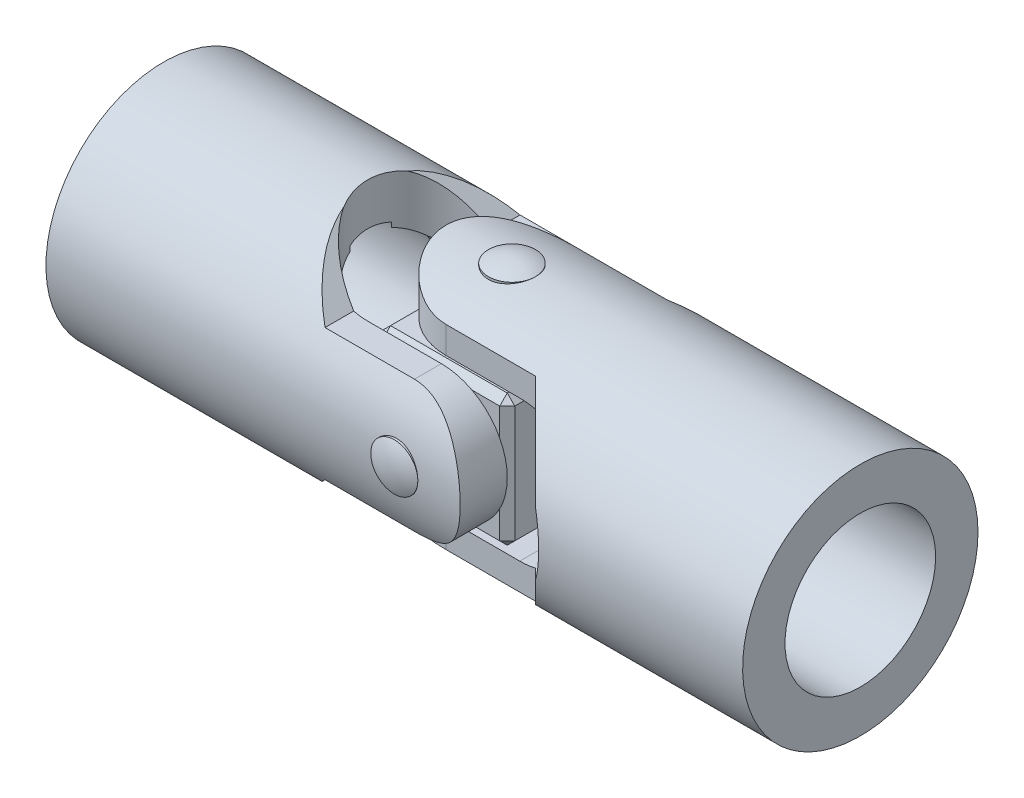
ISO-10303-21;
HEADER;
FILE_DESCRIPTION(('STEP AP214'),'2;1');
FILE_NAME('part.step','',(''),(''),'','','');
FILE_SCHEMA(('AUTOMOTIVE_DESIGN { 1 0 10303 214 1 1 1 1 }'));
ENDSEC;
DATA;
#1=APPLICATION_CONTEXT('core data for automotive mechanical design processes');
#2=APPLICATION_PROTOCOL_DEFINITION('international standard','automotive_design',2000,#1);
#3=PRODUCT_CONTEXT('',#1,'mechanical');
#4=PRODUCT('Part','Part','',(#3));
#5=PRODUCT_RELATED_PRODUCT_CATEGORY('part','',(#4));
#6=PRODUCT_DEFINITION_FORMATION('','',#4);
#7=PRODUCT_DEFINITION_CONTEXT('part definition',#1,'design');
#8=PRODUCT_DEFINITION('design','',#6,#7);
#9=PRODUCT_DEFINITION_SHAPE('','',#8);
#10=(LENGTH_UNIT() NAMED_UNIT(*) SI_UNIT(.MILLI.,.METRE.));
#11=(NAMED_UNIT(*) PLANE_ANGLE_UNIT() SI_UNIT($,.RADIAN.));
#12=(NAMED_UNIT(*) SI_UNIT($,.STERADIAN.) SOLID_ANGLE_UNIT());
#13=UNCERTAINTY_MEASURE_WITH_UNIT(LENGTH_MEASURE(1.E-05),#10,'distance_accuracy_value','');
#14=(GEOMETRIC_REPRESENTATION_CONTEXT(3) GLOBAL_UNCERTAINTY_ASSIGNED_CONTEXT((#13)) GLOBAL_UNIT_ASSIGNED_CONTEXT((#10,
#11,#12)) REPRESENTATION_CONTEXT('',''));
#15=CARTESIAN_POINT('',(0.,0.,0.));
#16=DIRECTION('',(0.,0.,1.));
#17=DIRECTION('',(1.,0.,0.));
#18=AXIS2_PLACEMENT_3D('',#15,#16,#17);
#19=CARTESIAN_POINT('',(0.,12.5,0.));
#20=DIRECTION('',(0.,-1.,0.));
#21=DIRECTION('',(-1.,0.,0.));
#22=AXIS2_PLACEMENT_3D('',#19,#20,#21);
#23=CYLINDRICAL_SURFACE('',#22,2.5);
#24=CARTESIAN_POINT('',(0.,12.5,0.));
#25=DIRECTION('',(0.,1.,0.));
#26=DIRECTION('',(1.,0.,0.));
#27=AXIS2_PLACEMENT_3D('',#24,#25,#26);
#28=CIRCLE('',#27,2.5);
#29=CARTESIAN_POINT('',(2.5,12.5,0.));
#30=VERTEX_POINT('',#29);
#31=EDGE_CURVE('P0_E10',#30,#30,#28,.T.);
#32=ORIENTED_EDGE('',*,*,#31,.F.);
#33=EDGE_LOOP('',(#32));
#34=FACE_BOUND('',#33,.T.);
#35=CARTESIAN_POINT('',(0.,-12.5,0.));
#36=DIRECTION('',(0.,1.,0.));
#37=DIRECTION('',(0.,0.,1.));
#38=AXIS2_PLACEMENT_3D('',#35,#36,#37);
#39=CIRCLE('',#38,2.5);
#40=CARTESIAN_POINT('',(0.,-12.5,2.5));
#41=VERTEX_POINT('',#40);
#42=EDGE_CURVE('P0_E20',#41,#41,#39,.T.);
#43=ORIENTED_EDGE('',*,*,#42,.T.);
#44=EDGE_LOOP('',(#43));
#45=FACE_BOUND('',#44,.T.);
#46=ADVANCED_FACE('P0_F14',(#34,#45),#23,.T.);
#47=CARTESIAN_POINT('',(0.,7.32192120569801,0.));
#48=DIRECTION('',(0.,1.,0.));
#49=DIRECTION('',(0.,0.,-1.));
#50=AXIS2_PLACEMENT_3D('',#47,#48,#49);
#51=SPHERICAL_SURFACE('',#50,5.75);
#52=ORIENTED_EDGE('',*,*,#31,.T.);
#53=EDGE_LOOP('',(#52));
#54=FACE_BOUND('',#53,.T.);
#55=ADVANCED_FACE('P0_F29',(#54),#51,.T.);
#56=CARTESIAN_POINT('',(0.,-7.32192120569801,0.));
#57=DIRECTION('',(0.,-1.,0.));
#58=DIRECTION('',(0.,0.,-1.));
#59=AXIS2_PLACEMENT_3D('',#56,#57,#58);
#60=SPHERICAL_SURFACE('',#59,5.75);
#61=ORIENTED_EDGE('',*,*,#42,.F.);
#62=EDGE_LOOP('',(#61));
#63=FACE_BOUND('',#62,.T.);
#64=ADVANCED_FACE('P0_F27',(#63),#60,.T.);
#65=CLOSED_SHELL('',(#46,#55,#64));
#66=MANIFOLD_SOLID_BREP('P0_B1',#65);
#67=CARTESIAN_POINT('',(0.,0.,12.5));
#68=DIRECTION('',(0.,0.,-1.));
#69=DIRECTION('',(-1.,0.,0.));
#70=AXIS2_PLACEMENT_3D('',#67,#68,#69);
#71=CYLINDRICAL_SURFACE('',#70,2.5);
#72=CARTESIAN_POINT('',(0.,0.,12.5));
#73=DIRECTION('',(0.,0.,1.));
#74=DIRECTION('',(1.,0.,0.));
#75=AXIS2_PLACEMENT_3D('',#72,#73,#74);
#76=CIRCLE('',#75,2.5);
#77=CARTESIAN_POINT('',(2.5,0.,12.5));
#78=VERTEX_POINT('',#77);
#79=EDGE_CURVE('P1_E10',#78,#78,#76,.T.);
#80=ORIENTED_EDGE('',*,*,#79,.F.);
#81=EDGE_LOOP('',(#80));
#82=FACE_BOUND('',#81,.T.);
#83=CARTESIAN_POINT('',(0.,0.,-12.5));
#84=DIRECTION('',(0.,0.,1.));
#85=DIRECTION('',(0.,-1.,0.));
#86=AXIS2_PLACEMENT_3D('',#83,#84,#85);
#87=CIRCLE('',#86,2.5);
#88=CARTESIAN_POINT('',(0.,-2.5,-12.5));
#89=VERTEX_POINT('',#88);
#90=EDGE_CURVE('P1_E20',#89,#89,#87,.T.);
#91=ORIENTED_EDGE('',*,*,#90,.T.);
#92=EDGE_LOOP('',(#91));
#93=FACE_BOUND('',#92,.T.);
#94=ADVANCED_FACE('P1_F14',(#82,#93),#71,.T.);
#95=CARTESIAN_POINT('',(0.,0.,7.32192120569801));
#96=DIRECTION('',(0.,0.,1.));
#97=DIRECTION('',(0.,1.,0.));
#98=AXIS2_PLACEMENT_3D('',#95,#96,#97);
#99=SPHERICAL_SURFACE('',#98,5.75);
#100=ORIENTED_EDGE('',*,*,#79,.T.);
#101=EDGE_LOOP('',(#100));
#102=FACE_BOUND('',#101,.T.);
#103=ADVANCED_FACE('P1_F29',(#102),#99,.T.);
#104=CARTESIAN_POINT('',(0.,0.,-7.32192120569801));
#105=DIRECTION('',(0.,0.,-1.));
#106=DIRECTION('',(0.,1.,0.));
#107=AXIS2_PLACEMENT_3D('',#104,#105,#106);
#108=SPHERICAL_SURFACE('',#107,5.75);
#109=ORIENTED_EDGE('',*,*,#90,.F.);
#110=EDGE_LOOP('',(#109));
#111=FACE_BOUND('',#110,.T.);
#112=ADVANCED_FACE('P1_F27',(#111),#108,.T.);
#113=CLOSED_SHELL('',(#94,#103,#112));
#114=MANIFOLD_SOLID_BREP('P1_B1',#113);
#115=CARTESIAN_POINT('',(0.,0.,7.5));
#116=DIRECTION('',(0.,0.,-1.));
#117=DIRECTION('',(-1.,0.,0.));
#118=AXIS2_PLACEMENT_3D('',#115,#116,#117);
#119=CYLINDRICAL_SURFACE('',#118,2.5);
#120=CARTESIAN_POINT('',(0.,0.,0.));
#121=DIRECTION('',(0.,0.707106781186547,-0.707106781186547));
#122=DIRECTION('',(0.,-0.707106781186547,-0.707106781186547));
#123=AXIS2_PLACEMENT_3D('',#120,#121,#122);
#124=ELLIPSE('',#123,3.53553390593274,2.5);
#125=CARTESIAN_POINT('',(2.5,0.,0.));
#126=VERTEX_POINT('',#125);
#127=CARTESIAN_POINT('',(-2.5,0.,0.));
#128=VERTEX_POINT('',#127);
#129=EDGE_CURVE('P2_E116',#126,#128,#124,.F.);
#130=ORIENTED_EDGE('',*,*,#129,.F.);
#131=CARTESIAN_POINT('',(0.,0.,0.));
#132=DIRECTION('',(0.,-0.707106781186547,-0.707106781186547));
#133=DIRECTION('',(0.,0.707106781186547,-0.707106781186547));
#134=AXIS2_PLACEMENT_3D('',#131,#132,#133);
#135=ELLIPSE('',#134,3.53553390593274,2.5);
#136=EDGE_CURVE('P2_E120',#128,#126,#135,.F.);
#137=ORIENTED_EDGE('',*,*,#136,.F.);
#138=EDGE_LOOP('',(#130,#137));
#139=FACE_BOUND('',#138,.T.);
#140=CARTESIAN_POINT('',(0.,0.,7.5));
#141=DIRECTION('',(0.,0.,1.));
#142=DIRECTION('',(1.,0.,0.));
#143=AXIS2_PLACEMENT_3D('',#140,#141,#142);
#144=CIRCLE('',#143,2.5);
#145=CARTESIAN_POINT('',(2.5,0.,7.5));
#146=VERTEX_POINT('',#145);
#147=EDGE_CURVE('P2_E127',#146,#146,#144,.T.);
#148=ORIENTED_EDGE('',*,*,#147,.T.);
#149=EDGE_LOOP('',(#148));
#150=FACE_BOUND('',#149,.T.);
#151=ADVANCED_FACE('P2_F16',(#139,#150),#119,.F.);
#152=CARTESIAN_POINT('',(7.,7.,7.5));
#153=DIRECTION('',(0.,0.,1.));
#154=DIRECTION('',(1.,0.,0.));
#155=AXIS2_PLACEMENT_3D('',#152,#153,#154);
#156=PLANE('',#155);
#157=DIRECTION('',(0.,-1.,0.));
#158=VECTOR('',#157,1.);
#159=CARTESIAN_POINT('',(-6.2,-7.,7.5));
#160=LINE('',#159,#158);
#161=CARTESIAN_POINT('',(-6.2,6.2,7.5));
#162=VERTEX_POINT('',#161);
#163=CARTESIAN_POINT('',(-6.2,-6.2,7.5));
#164=VERTEX_POINT('',#163);
#165=EDGE_CURVE('P2_E164',#162,#164,#160,.T.);
#166=ORIENTED_EDGE('',*,*,#165,.T.);
#167=DIRECTION('',(1.,0.,0.));
#168=VECTOR('',#167,1.);
#169=CARTESIAN_POINT('',(7.,-6.2,7.5));
#170=LINE('',#169,#168);
#171=CARTESIAN_POINT('',(6.2,-6.2,7.5));
#172=VERTEX_POINT('',#171);
#173=EDGE_CURVE('P2_E168',#164,#172,#170,.T.);
#174=ORIENTED_EDGE('',*,*,#173,.T.);
#175=DIRECTION('',(0.,1.,0.));
#176=VECTOR('',#175,1.);
#177=CARTESIAN_POINT('',(6.2,7.,7.5));
#178=LINE('',#177,#176);
#179=CARTESIAN_POINT('',(6.2,6.2,7.5));
#180=VERTEX_POINT('',#179);
#181=EDGE_CURVE('P2_E166',#172,#180,#178,.T.);
#182=ORIENTED_EDGE('',*,*,#181,.T.);
#183=DIRECTION('',(-1.,0.,0.));
#184=VECTOR('',#183,1.);
#185=CARTESIAN_POINT('',(-7.,6.2,7.5));
#186=LINE('',#185,#184);
#187=EDGE_CURVE('P2_E162',#180,#162,#186,.T.);
#188=ORIENTED_EDGE('',*,*,#187,.T.);
#189=EDGE_LOOP('',(#166,#174,#182,#188));
#190=FACE_BOUND('',#189,.T.);
#191=ORIENTED_EDGE('',*,*,#147,.F.);
#192=EDGE_LOOP('',(#191));
#193=FACE_BOUND('',#192,.T.);
#194=ADVANCED_FACE('P2_F282',(#190,#193),#156,.T.);
#195=CARTESIAN_POINT('',(7.,7.,-7.5));
#196=DIRECTION('',(0.,0.,1.));
#197=DIRECTION('',(1.,0.,0.));
#198=AXIS2_PLACEMENT_3D('',#195,#196,#197);
#199=PLANE('',#198);
#200=DIRECTION('',(-1.,0.,0.));
#201=VECTOR('',#200,1.);
#202=CARTESIAN_POINT('',(7.,-6.2,-7.5));
#203=LINE('',#202,#201);
#204=CARTESIAN_POINT('',(6.2,-6.2,-7.5));
#205=VERTEX_POINT('',#204);
#206=CARTESIAN_POINT('',(-6.2,-6.2,-7.5));
#207=VERTEX_POINT('',#206);
#208=EDGE_CURVE('P2_E157',#205,#207,#203,.T.);
#209=ORIENTED_EDGE('',*,*,#208,.T.);
#210=DIRECTION('',(0.,1.,0.));
#211=VECTOR('',#210,1.);
#212=CARTESIAN_POINT('',(-6.2,7.,-7.5));
#213=LINE('',#212,#211);
#214=CARTESIAN_POINT('',(-6.2,6.2,-7.5));
#215=VERTEX_POINT('',#214);
#216=EDGE_CURVE('P2_E159',#207,#215,#213,.T.);
#217=ORIENTED_EDGE('',*,*,#216,.T.);
#218=DIRECTION('',(1.,0.,0.));
#219=VECTOR('',#218,1.);
#220=CARTESIAN_POINT('',(7.,6.2,-7.5));
#221=LINE('',#220,#219);
#222=CARTESIAN_POINT('',(6.2,6.2,-7.5));
#223=VERTEX_POINT('',#222);
#224=EDGE_CURVE('P2_E153',#215,#223,#221,.T.);
#225=ORIENTED_EDGE('',*,*,#224,.T.);
#226=DIRECTION('',(0.,-1.,0.));
#227=VECTOR('',#226,1.);
#228=CARTESIAN_POINT('',(6.2,7.,-7.5));
#229=LINE('',#228,#227);
#230=EDGE_CURVE('P2_E155',#223,#205,#229,.T.);
#231=ORIENTED_EDGE('',*,*,#230,.T.);
#232=EDGE_LOOP('',(#209,#217,#225,#231));
#233=FACE_BOUND('',#232,.T.);
#234=CARTESIAN_POINT('',(0.,0.,-7.5));
#235=DIRECTION('',(0.,0.,1.));
#236=DIRECTION('',(1.,0.,0.));
#237=AXIS2_PLACEMENT_3D('',#234,#235,#236);
#238=CIRCLE('',#237,2.5);
#239=CARTESIAN_POINT('',(2.5,0.,-7.5));
#240=VERTEX_POINT('',#239);
#241=EDGE_CURVE('P2_E259',#240,#240,#238,.T.);
#242=ORIENTED_EDGE('',*,*,#241,.T.);
#243=EDGE_LOOP('',(#242));
#244=FACE_BOUND('',#243,.T.);
#245=ADVANCED_FACE('P2_F267',(#233,#244),#199,.F.);
#246=CARTESIAN_POINT('',(-7.,7.,7.5));
#247=DIRECTION('',(0.,-1.,0.));
#248=DIRECTION('',(0.,0.,-1.));
#249=AXIS2_PLACEMENT_3D('',#246,#247,#248);
#250=PLANE('',#249);
#251=DIRECTION('',(-1.,0.,0.));
#252=VECTOR('',#251,1.);
#253=CARTESIAN_POINT('',(-7.,7.,-6.7));
#254=LINE('',#253,#252);
#255=CARTESIAN_POINT('',(6.2,7.,-6.7));
#256=VERTEX_POINT('',#255);
#257=CARTESIAN_POINT('',(-6.2,7.,-6.7));
#258=VERTEX_POINT('',#257);
#259=EDGE_CURVE('P2_E25',#256,#258,#254,.T.);
#260=ORIENTED_EDGE('',*,*,#259,.T.);
#261=DIRECTION('',(0.,0.,1.));
#262=VECTOR('',#261,1.);
#263=CARTESIAN_POINT('',(-6.2,7.,7.5));
#264=LINE('',#263,#262);
#265=CARTESIAN_POINT('',(-6.2,7.,6.7));
#266=VERTEX_POINT('',#265);
#267=EDGE_CURVE('P2_E11',#258,#266,#264,.T.);
#268=ORIENTED_EDGE('',*,*,#267,.T.);
#269=DIRECTION('',(1.,0.,0.));
#270=VECTOR('',#269,1.);
#271=CARTESIAN_POINT('',(7.,7.,6.7));
#272=LINE('',#271,#270);
#273=CARTESIAN_POINT('',(6.2,7.,6.7));
#274=VERTEX_POINT('',#273);
#275=EDGE_CURVE('P2_E180',#266,#274,#272,.T.);
#276=ORIENTED_EDGE('',*,*,#275,.T.);
#277=DIRECTION('',(0.,0.,-1.));
#278=VECTOR('',#277,1.);
#279=CARTESIAN_POINT('',(6.2,7.,7.5));
#280=LINE('',#279,#278);
#281=EDGE_CURVE('P2_E36',#274,#256,#280,.T.);
#282=ORIENTED_EDGE('',*,*,#281,.T.);
#283=EDGE_LOOP('',(#260,#268,#276,#282));
#284=FACE_BOUND('',#283,.T.);
#285=CARTESIAN_POINT('',(0.,7.,0.));
#286=DIRECTION('',(0.,1.,0.));
#287=DIRECTION('',(0.,0.,1.));
#288=AXIS2_PLACEMENT_3D('',#285,#286,#287);
#289=CIRCLE('',#288,2.5);
#290=CARTESIAN_POINT('',(0.,7.,2.5));
#291=VERTEX_POINT('',#290);
#292=EDGE_CURVE('P2_E249',#291,#291,#289,.T.);
#293=ORIENTED_EDGE('',*,*,#292,.F.);
#294=EDGE_LOOP('',(#293));
#295=FACE_BOUND('',#294,.T.);
#296=ADVANCED_FACE('P2_F290',(#284,#295),#250,.F.);
#297=CARTESIAN_POINT('',(-7.,-7.,7.5));
#298=DIRECTION('',(1.,0.,0.));
#299=DIRECTION('',(0.,0.,-1.));
#300=AXIS2_PLACEMENT_3D('',#297,#298,#299);
#301=PLANE('',#300);
#302=DIRECTION('',(0.,-1.,0.));
#303=VECTOR('',#302,1.);
#304=CARTESIAN_POINT('',(-7.,-7.,-6.7));
#305=LINE('',#304,#303);
#306=CARTESIAN_POINT('',(-7.,6.2,-6.7));
#307=VERTEX_POINT('',#306);
#308=CARTESIAN_POINT('',(-7.,-6.2,-6.7));
#309=VERTEX_POINT('',#308);
#310=EDGE_CURVE('P2_E148',#307,#309,#305,.T.);
#311=ORIENTED_EDGE('',*,*,#310,.T.);
#312=DIRECTION('',(0.,0.,1.));
#313=VECTOR('',#312,1.);
#314=CARTESIAN_POINT('',(-7.,-6.2,7.5));
#315=LINE('',#314,#313);
#316=CARTESIAN_POINT('',(-7.,-6.2,6.7));
#317=VERTEX_POINT('',#316);
#318=EDGE_CURVE('P2_E150',#309,#317,#315,.T.);
#319=ORIENTED_EDGE('',*,*,#318,.T.);
#320=DIRECTION('',(0.,1.,0.));
#321=VECTOR('',#320,1.);
#322=CARTESIAN_POINT('',(-7.,7.,6.7));
#323=LINE('',#322,#321);
#324=CARTESIAN_POINT('',(-7.,6.2,6.7));
#325=VERTEX_POINT('',#324);
#326=EDGE_CURVE('P2_E146',#317,#325,#323,.T.);
#327=ORIENTED_EDGE('',*,*,#326,.T.);
#328=DIRECTION('',(0.,0.,-1.));
#329=VECTOR('',#328,1.);
#330=CARTESIAN_POINT('',(-7.,6.2,7.5));
#331=LINE('',#330,#329);
#332=EDGE_CURVE('P2_E144',#325,#307,#331,.T.);
#333=ORIENTED_EDGE('',*,*,#332,.T.);
#334=EDGE_LOOP('',(#311,#319,#327,#333));
#335=FACE_BOUND('',#334,.T.);
#336=ADVANCED_FACE('P2_F297',(#335),#301,.F.);
#337=CARTESIAN_POINT('',(-7.,-7.,7.5));
#338=DIRECTION('',(0.,1.,0.));
#339=DIRECTION('',(0.,0.,1.));
#340=AXIS2_PLACEMENT_3D('',#337,#338,#339);
#341=PLANE('',#340);
#342=DIRECTION('',(-1.,0.,0.));
#343=VECTOR('',#342,1.);
#344=CARTESIAN_POINT('',(-7.,-7.,6.7));
#345=LINE('',#344,#343);
#346=CARTESIAN_POINT('',(6.2,-7.,6.7));
#347=VERTEX_POINT('',#346);
#348=CARTESIAN_POINT('',(-6.2,-7.,6.7));
#349=VERTEX_POINT('',#348);
#350=EDGE_CURVE('P2_E137',#347,#349,#345,.T.);
#351=ORIENTED_EDGE('',*,*,#350,.T.);
#352=DIRECTION('',(0.,0.,-1.));
#353=VECTOR('',#352,1.);
#354=CARTESIAN_POINT('',(-6.2,-7.,7.5));
#355=LINE('',#354,#353);
#356=CARTESIAN_POINT('',(-6.2,-7.,-6.7));
#357=VERTEX_POINT('',#356);
#358=EDGE_CURVE('P2_E141',#349,#357,#355,.T.);
#359=ORIENTED_EDGE('',*,*,#358,.T.);
#360=DIRECTION('',(1.,0.,0.));
#361=VECTOR('',#360,1.);
#362=CARTESIAN_POINT('',(-7.,-7.,-6.7));
#363=LINE('',#362,#361);
#364=CARTESIAN_POINT('',(6.2,-7.,-6.7));
#365=VERTEX_POINT('',#364);
#366=EDGE_CURVE('P2_E139',#357,#365,#363,.T.);
#367=ORIENTED_EDGE('',*,*,#366,.T.);
#368=DIRECTION('',(0.,0.,1.));
#369=VECTOR('',#368,1.);
#370=CARTESIAN_POINT('',(6.2,-7.,7.5));
#371=LINE('',#370,#369);
#372=EDGE_CURVE('P2_E130',#365,#347,#371,.T.);
#373=ORIENTED_EDGE('',*,*,#372,.T.);
#374=EDGE_LOOP('',(#351,#359,#367,#373));
#375=FACE_BOUND('',#374,.T.);
#376=CARTESIAN_POINT('',(0.,-7.,0.));
#377=DIRECTION('',(0.,1.,0.));
#378=DIRECTION('',(0.,0.,1.));
#379=AXIS2_PLACEMENT_3D('',#376,#377,#378);
#380=CIRCLE('',#379,2.5);
#381=CARTESIAN_POINT('',(0.,-7.,2.5));
#382=VERTEX_POINT('',#381);
#383=EDGE_CURVE('P2_E255',#382,#382,#380,.T.);
#384=ORIENTED_EDGE('',*,*,#383,.T.);
#385=EDGE_LOOP('',(#384));
#386=FACE_BOUND('',#385,.T.);
#387=ADVANCED_FACE('P2_F277',(#375,#386),#341,.F.);
#388=CARTESIAN_POINT('',(7.,-7.,7.5));
#389=DIRECTION('',(-1.,0.,0.));
#390=DIRECTION('',(0.,0.,1.));
#391=AXIS2_PLACEMENT_3D('',#388,#389,#390);
#392=PLANE('',#391);
#393=DIRECTION('',(0.,-1.,0.));
#394=VECTOR('',#393,1.);
#395=CARTESIAN_POINT('',(7.,-7.,6.7));
#396=LINE('',#395,#394);
#397=CARTESIAN_POINT('',(7.,6.2,6.7));
#398=VERTEX_POINT('',#397);
#399=CARTESIAN_POINT('',(7.,-6.2,6.7));
#400=VERTEX_POINT('',#399);
#401=EDGE_CURVE('P2_E173',#398,#400,#396,.T.);
#402=ORIENTED_EDGE('',*,*,#401,.T.);
#403=DIRECTION('',(0.,0.,-1.));
#404=VECTOR('',#403,1.);
#405=CARTESIAN_POINT('',(7.,-6.2,7.5));
#406=LINE('',#405,#404);
#407=CARTESIAN_POINT('',(7.,-6.2,-6.7));
#408=VERTEX_POINT('',#407);
#409=EDGE_CURVE('P2_E177',#400,#408,#406,.T.);
#410=ORIENTED_EDGE('',*,*,#409,.T.);
#411=DIRECTION('',(0.,1.,0.));
#412=VECTOR('',#411,1.);
#413=CARTESIAN_POINT('',(7.,-7.,-6.7));
#414=LINE('',#413,#412);
#415=CARTESIAN_POINT('',(7.,6.2,-6.7));
#416=VERTEX_POINT('',#415);
#417=EDGE_CURVE('P2_E175',#408,#416,#414,.T.);
#418=ORIENTED_EDGE('',*,*,#417,.T.);
#419=DIRECTION('',(0.,0.,1.));
#420=VECTOR('',#419,1.);
#421=CARTESIAN_POINT('',(7.,6.2,7.5));
#422=LINE('',#421,#420);
#423=EDGE_CURVE('P2_E171',#416,#398,#422,.T.);
#424=ORIENTED_EDGE('',*,*,#423,.T.);
#425=EDGE_LOOP('',(#402,#410,#418,#424));
#426=FACE_BOUND('',#425,.T.);
#427=ADVANCED_FACE('P2_F269',(#426),#392,.F.);
#428=CARTESIAN_POINT('',(0.,0.,0.));
#429=DIRECTION('',(0.,0.707106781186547,-0.707106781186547));
#430=DIRECTION('',(0.,-0.707106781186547,-0.707106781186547));
#431=AXIS2_PLACEMENT_3D('',#428,#429,#430);
#432=ELLIPSE('',#431,3.53553390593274,2.5);
#433=EDGE_CURVE('P2_E119',#126,#128,#432,.T.);
#434=ORIENTED_EDGE('',*,*,#433,.F.);
#435=CARTESIAN_POINT('',(0.,0.,0.));
#436=DIRECTION('',(0.,-0.707106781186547,-0.707106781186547));
#437=DIRECTION('',(0.,0.707106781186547,-0.707106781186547));
#438=AXIS2_PLACEMENT_3D('',#435,#436,#437);
#439=ELLIPSE('',#438,3.53553390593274,2.5);
#440=EDGE_CURVE('P2_E111',#128,#126,#439,.T.);
#441=ORIENTED_EDGE('',*,*,#440,.F.);
#442=EDGE_LOOP('',(#434,#441));
#443=FACE_BOUND('',#442,.T.);
#444=ORIENTED_EDGE('',*,*,#241,.F.);
#445=EDGE_LOOP('',(#444));
#446=FACE_BOUND('',#445,.T.);
#447=ADVANCED_FACE('P2_F132',(#443,#446),#119,.F.);
#448=CARTESIAN_POINT('',(0.,-7.,0.));
#449=DIRECTION('',(0.,1.,0.));
#450=DIRECTION('',(0.,0.,1.));
#451=AXIS2_PLACEMENT_3D('',#448,#449,#450);
#452=CYLINDRICAL_SURFACE('',#451,2.5);
#453=ORIENTED_EDGE('',*,*,#433,.T.);
#454=ORIENTED_EDGE('',*,*,#136,.T.);
#455=EDGE_LOOP('',(#453,#454));
#456=FACE_BOUND('',#455,.T.);
#457=ORIENTED_EDGE('',*,*,#383,.F.);
#458=EDGE_LOOP('',(#457));
#459=FACE_BOUND('',#458,.T.);
#460=ADVANCED_FACE('P2_F124',(#456,#459),#452,.F.);
#461=ORIENTED_EDGE('',*,*,#129,.T.);
#462=ORIENTED_EDGE('',*,*,#440,.T.);
#463=EDGE_LOOP('',(#461,#462));
#464=FACE_BOUND('',#463,.T.);
#465=ORIENTED_EDGE('',*,*,#292,.T.);
#466=EDGE_LOOP('',(#465));
#467=FACE_BOUND('',#466,.T.);
#468=ADVANCED_FACE('P2_F113',(#464,#467),#452,.F.);
#469=CARTESIAN_POINT('',(6.2,7.,7.5));
#470=DIRECTION('',(-0.707106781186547,-0.707106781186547,0.));
#471=DIRECTION('',(0.707106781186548,-0.707106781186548,0.));
#472=AXIS2_PLACEMENT_3D('',#469,#470,#471);
#473=PLANE('',#472);
#474=DIRECTION('',(0.707106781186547,-0.707106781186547,0.));
#475=VECTOR('',#474,1.);
#476=CARTESIAN_POINT('',(6.6,6.6,6.7));
#477=LINE('',#476,#475);
#478=EDGE_CURVE('P2_E20',#398,#274,#477,.F.);
#479=ORIENTED_EDGE('',*,*,#478,.F.);
#480=ORIENTED_EDGE('',*,*,#423,.F.);
#481=DIRECTION('',(-0.707106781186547,0.707106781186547,0.));
#482=VECTOR('',#481,1.);
#483=CARTESIAN_POINT('',(7.,6.2,-6.7));
#484=LINE('',#483,#482);
#485=EDGE_CURVE('P2_E243',#256,#416,#484,.F.);
#486=ORIENTED_EDGE('',*,*,#485,.F.);
#487=ORIENTED_EDGE('',*,*,#281,.F.);
#488=EDGE_LOOP('',(#479,#480,#486,#487));
#489=FACE_BOUND('',#488,.T.);
#490=ADVANCED_FACE('P2_F18',(#489),#473,.F.);
#491=CARTESIAN_POINT('',(6.2,6.2,7.5));
#492=DIRECTION('',(0.577350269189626,0.577350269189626,0.577350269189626));
#493=DIRECTION('',(0.707106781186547,0.,-0.707106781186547));
#494=AXIS2_PLACEMENT_3D('',#491,#492,#493);
#495=PLANE('',#494);
#496=DIRECTION('',(0.707106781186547,0.,-0.707106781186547));
#497=VECTOR('',#496,1.);
#498=CARTESIAN_POINT('',(6.2,6.2,7.5));
#499=LINE('',#498,#497);
#500=EDGE_CURVE('P2_E238',#398,#180,#499,.F.);
#501=ORIENTED_EDGE('',*,*,#500,.F.);
#502=ORIENTED_EDGE('',*,*,#478,.T.);
#503=DIRECTION('',(0.,-0.707106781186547,0.707106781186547));
#504=VECTOR('',#503,1.);
#505=CARTESIAN_POINT('',(6.2,6.2,7.5));
#506=LINE('',#505,#504);
#507=EDGE_CURVE('P2_E241',#180,#274,#506,.F.);
#508=ORIENTED_EDGE('',*,*,#507,.F.);
#509=EDGE_LOOP('',(#501,#502,#508));
#510=FACE_BOUND('',#509,.T.);
#511=ADVANCED_FACE('P2_F374',(#510),#495,.T.);
#512=CARTESIAN_POINT('',(7.,6.2,-6.7));
#513=DIRECTION('',(0.577350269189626,0.577350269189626,-0.577350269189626));
#514=DIRECTION('',(-0.707106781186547,0.,-0.707106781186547));
#515=AXIS2_PLACEMENT_3D('',#512,#513,#514);
#516=PLANE('',#515);
#517=DIRECTION('',(0.,-0.707106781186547,-0.707106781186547));
#518=VECTOR('',#517,1.);
#519=CARTESIAN_POINT('',(6.2,6.6,-7.1));
#520=LINE('',#519,#518);
#521=EDGE_CURVE('P2_E232',#256,#223,#520,.T.);
#522=ORIENTED_EDGE('',*,*,#521,.F.);
#523=ORIENTED_EDGE('',*,*,#485,.T.);
#524=DIRECTION('',(0.707106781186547,0.,0.707106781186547));
#525=VECTOR('',#524,1.);
#526=CARTESIAN_POINT('',(7.,6.2,-6.7));
#527=LINE('',#526,#525);
#528=EDGE_CURVE('P2_E235',#223,#416,#527,.T.);
#529=ORIENTED_EDGE('',*,*,#528,.F.);
#530=EDGE_LOOP('',(#522,#523,#529));
#531=FACE_BOUND('',#530,.T.);
#532=ADVANCED_FACE('P2_F371',(#531),#516,.T.);
#533=CARTESIAN_POINT('',(7.,6.2,7.5));
#534=DIRECTION('',(0.,0.707106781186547,0.707106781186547));
#535=DIRECTION('',(0.,-0.707106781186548,0.707106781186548));
#536=AXIS2_PLACEMENT_3D('',#533,#534,#535);
#537=PLANE('',#536);
#538=ORIENTED_EDGE('',*,*,#507,.T.);
#539=ORIENTED_EDGE('',*,*,#275,.F.);
#540=DIRECTION('',(0.,0.707106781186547,-0.707106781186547));
#541=VECTOR('',#540,1.);
#542=CARTESIAN_POINT('',(-6.2,6.6,7.1));
#543=LINE('',#542,#541);
#544=EDGE_CURVE('P2_E227',#162,#266,#543,.T.);
#545=ORIENTED_EDGE('',*,*,#544,.F.);
#546=ORIENTED_EDGE('',*,*,#187,.F.);
#547=EDGE_LOOP('',(#538,#539,#545,#546));
#548=FACE_BOUND('',#547,.T.);
#549=ADVANCED_FACE('P2_F367',(#548),#537,.T.);
#550=CARTESIAN_POINT('',(6.2,7.,7.5));
#551=DIRECTION('',(0.707106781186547,0.,0.707106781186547));
#552=DIRECTION('',(0.707106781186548,0.,-0.707106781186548));
#553=AXIS2_PLACEMENT_3D('',#550,#551,#552);
#554=PLANE('',#553);
#555=ORIENTED_EDGE('',*,*,#500,.T.);
#556=ORIENTED_EDGE('',*,*,#181,.F.);
#557=DIRECTION('',(-0.707106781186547,0.,0.707106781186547));
#558=VECTOR('',#557,1.);
#559=CARTESIAN_POINT('',(6.2,-6.2,7.5));
#560=LINE('',#559,#558);
#561=EDGE_CURVE('P2_E224',#400,#172,#560,.T.);
#562=ORIENTED_EDGE('',*,*,#561,.F.);
#563=ORIENTED_EDGE('',*,*,#401,.F.);
#564=EDGE_LOOP('',(#555,#556,#562,#563));
#565=FACE_BOUND('',#564,.T.);
#566=ADVANCED_FACE('P2_F363',(#565),#554,.T.);
#567=CARTESIAN_POINT('',(7.,-6.2,7.5));
#568=DIRECTION('',(-0.707106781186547,0.707106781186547,0.));
#569=DIRECTION('',(-0.707106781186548,-0.707106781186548,0.));
#570=AXIS2_PLACEMENT_3D('',#567,#568,#569);
#571=PLANE('',#570);
#572=DIRECTION('',(0.707106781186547,0.707106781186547,0.));
#573=VECTOR('',#572,1.);
#574=CARTESIAN_POINT('',(6.2,-7.,-6.7));
#575=LINE('',#574,#573);
#576=EDGE_CURVE('P2_E218',#408,#365,#575,.F.);
#577=ORIENTED_EDGE('',*,*,#576,.F.);
#578=ORIENTED_EDGE('',*,*,#409,.F.);
#579=DIRECTION('',(-0.707106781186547,-0.707106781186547,0.));
#580=VECTOR('',#579,1.);
#581=CARTESIAN_POINT('',(6.6,-6.6,6.7));
#582=LINE('',#581,#580);
#583=EDGE_CURVE('P2_E221',#347,#400,#582,.F.);
#584=ORIENTED_EDGE('',*,*,#583,.F.);
#585=ORIENTED_EDGE('',*,*,#372,.F.);
#586=EDGE_LOOP('',(#577,#578,#584,#585));
#587=FACE_BOUND('',#586,.T.);
#588=ADVANCED_FACE('P2_F359',(#587),#571,.F.);
#589=CARTESIAN_POINT('',(7.,-7.,-6.7));
#590=DIRECTION('',(-0.707106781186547,0.,0.707106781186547));
#591=DIRECTION('',(0.707106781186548,0.,0.707106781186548));
#592=AXIS2_PLACEMENT_3D('',#589,#590,#591);
#593=PLANE('',#592);
#594=ORIENTED_EDGE('',*,*,#528,.T.);
#595=ORIENTED_EDGE('',*,*,#417,.F.);
#596=DIRECTION('',(-0.707106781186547,0.,-0.707106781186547));
#597=VECTOR('',#596,1.);
#598=CARTESIAN_POINT('',(6.6,-6.2,-7.1));
#599=LINE('',#598,#597);
#600=EDGE_CURVE('P2_E216',#205,#408,#599,.F.);
#601=ORIENTED_EDGE('',*,*,#600,.F.);
#602=ORIENTED_EDGE('',*,*,#230,.F.);
#603=EDGE_LOOP('',(#594,#595,#601,#602));
#604=FACE_BOUND('',#603,.T.);
#605=ADVANCED_FACE('P2_F355',(#604),#593,.F.);
#606=CARTESIAN_POINT('',(-7.,7.,-6.7));
#607=DIRECTION('',(0.,-0.707106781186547,0.707106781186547));
#608=DIRECTION('',(0.,-0.707106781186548,-0.707106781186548));
#609=AXIS2_PLACEMENT_3D('',#606,#607,#608);
#610=PLANE('',#609);
#611=ORIENTED_EDGE('',*,*,#521,.T.);
#612=ORIENTED_EDGE('',*,*,#224,.F.);
#613=DIRECTION('',(0.,0.707106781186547,0.707106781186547));
#614=VECTOR('',#613,1.);
#615=CARTESIAN_POINT('',(-6.2,6.2,-7.5));
#616=LINE('',#615,#614);
#617=EDGE_CURVE('P2_E213',#258,#215,#616,.F.);
#618=ORIENTED_EDGE('',*,*,#617,.F.);
#619=ORIENTED_EDGE('',*,*,#259,.F.);
#620=EDGE_LOOP('',(#611,#612,#618,#619));
#621=FACE_BOUND('',#620,.T.);
#622=ADVANCED_FACE('P2_F351',(#621),#610,.F.);
#623=CARTESIAN_POINT('',(-7.,6.2,7.5));
#624=DIRECTION('',(0.707106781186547,-0.707106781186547,0.));
#625=DIRECTION('',(0.707106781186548,0.707106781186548,0.));
#626=AXIS2_PLACEMENT_3D('',#623,#624,#625);
#627=PLANE('',#626);
#628=DIRECTION('',(0.707106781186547,0.707106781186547,0.));
#629=VECTOR('',#628,1.);
#630=CARTESIAN_POINT('',(-7.,6.2,6.7));
#631=LINE('',#630,#629);
#632=EDGE_CURVE('P2_E229',#266,#325,#631,.F.);
#633=ORIENTED_EDGE('',*,*,#632,.F.);
#634=ORIENTED_EDGE('',*,*,#267,.F.);
#635=DIRECTION('',(-0.707106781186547,-0.707106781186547,0.));
#636=VECTOR('',#635,1.);
#637=CARTESIAN_POINT('',(-6.6,6.6,-6.7));
#638=LINE('',#637,#636);
#639=EDGE_CURVE('P2_E210',#307,#258,#638,.F.);
#640=ORIENTED_EDGE('',*,*,#639,.F.);
#641=ORIENTED_EDGE('',*,*,#332,.F.);
#642=EDGE_LOOP('',(#633,#634,#640,#641));
#643=FACE_BOUND('',#642,.T.);
#644=ADVANCED_FACE('P2_F347',(#643),#627,.F.);
#645=CARTESIAN_POINT('',(-7.,6.2,6.7));
#646=DIRECTION('',(-0.577350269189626,0.577350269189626,0.577350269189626));
#647=DIRECTION('',(0.707106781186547,0.,0.707106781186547));
#648=AXIS2_PLACEMENT_3D('',#645,#646,#647);
#649=PLANE('',#648);
#650=ORIENTED_EDGE('',*,*,#544,.T.);
#651=ORIENTED_EDGE('',*,*,#632,.T.);
#652=DIRECTION('',(0.707106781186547,0.,0.707106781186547));
#653=VECTOR('',#652,1.);
#654=CARTESIAN_POINT('',(-7.,6.2,6.7));
#655=LINE('',#654,#653);
#656=EDGE_CURVE('P2_E207',#162,#325,#655,.F.);
#657=ORIENTED_EDGE('',*,*,#656,.F.);
#658=EDGE_LOOP('',(#650,#651,#657));
#659=FACE_BOUND('',#658,.T.);
#660=ADVANCED_FACE('P2_F343',(#659),#649,.T.);
#661=CARTESIAN_POINT('',(6.2,-6.2,7.5));
#662=DIRECTION('',(0.577350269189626,-0.577350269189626,0.577350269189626));
#663=DIRECTION('',(0.707106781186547,0.,-0.707106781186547));
#664=AXIS2_PLACEMENT_3D('',#661,#662,#663);
#665=PLANE('',#664);
#666=ORIENTED_EDGE('',*,*,#583,.T.);
#667=ORIENTED_EDGE('',*,*,#561,.T.);
#668=DIRECTION('',(0.,-0.707106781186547,-0.707106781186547));
#669=VECTOR('',#668,1.);
#670=CARTESIAN_POINT('',(6.2,-6.2,7.5));
#671=LINE('',#670,#669);
#672=EDGE_CURVE('P2_E205',#347,#172,#671,.F.);
#673=ORIENTED_EDGE('',*,*,#672,.F.);
#674=EDGE_LOOP('',(#666,#667,#673));
#675=FACE_BOUND('',#674,.T.);
#676=ADVANCED_FACE('P2_F339',(#675),#665,.T.);
#677=CARTESIAN_POINT('',(6.2,-7.,-6.7));
#678=DIRECTION('',(0.577350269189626,-0.577350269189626,-0.577350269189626));
#679=DIRECTION('',(-0.707106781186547,0.,-0.707106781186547));
#680=AXIS2_PLACEMENT_3D('',#677,#678,#679);
#681=PLANE('',#680);
#682=ORIENTED_EDGE('',*,*,#600,.T.);
#683=ORIENTED_EDGE('',*,*,#576,.T.);
#684=DIRECTION('',(0.,-0.707106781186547,0.707106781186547));
#685=VECTOR('',#684,1.);
#686=CARTESIAN_POINT('',(6.2,-7.,-6.7));
#687=LINE('',#686,#685);
#688=EDGE_CURVE('P2_E202',#205,#365,#687,.T.);
#689=ORIENTED_EDGE('',*,*,#688,.F.);
#690=EDGE_LOOP('',(#682,#683,#689));
#691=FACE_BOUND('',#690,.T.);
#692=ADVANCED_FACE('P2_F335',(#691),#681,.T.);
#693=CARTESIAN_POINT('',(-6.2,6.2,-7.5));
#694=DIRECTION('',(-0.577350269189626,0.577350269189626,-0.577350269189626));
#695=DIRECTION('',(-0.707106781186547,0.,0.707106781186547));
#696=AXIS2_PLACEMENT_3D('',#693,#694,#695);
#697=PLANE('',#696);
#698=ORIENTED_EDGE('',*,*,#639,.T.);
#699=ORIENTED_EDGE('',*,*,#617,.T.);
#700=DIRECTION('',(0.707106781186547,0.,-0.707106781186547));
#701=VECTOR('',#700,1.);
#702=CARTESIAN_POINT('',(-6.2,6.2,-7.5));
#703=LINE('',#702,#701);
#704=EDGE_CURVE('P2_E200',#307,#215,#703,.T.);
#705=ORIENTED_EDGE('',*,*,#704,.F.);
#706=EDGE_LOOP('',(#698,#699,#705));
#707=FACE_BOUND('',#706,.T.);
#708=ADVANCED_FACE('P2_F331',(#707),#697,.T.);
#709=CARTESIAN_POINT('',(-6.2,7.,7.5));
#710=DIRECTION('',(-0.707106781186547,0.,0.707106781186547));
#711=DIRECTION('',(0.707106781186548,0.,0.707106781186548));
#712=AXIS2_PLACEMENT_3D('',#709,#710,#711);
#713=PLANE('',#712);
#714=ORIENTED_EDGE('',*,*,#656,.T.);
#715=ORIENTED_EDGE('',*,*,#326,.F.);
#716=DIRECTION('',(-0.707106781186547,0.,-0.707106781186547));
#717=VECTOR('',#716,1.);
#718=CARTESIAN_POINT('',(-7.,-6.2,6.7));
#719=LINE('',#718,#717);
#720=EDGE_CURVE('P2_E197',#164,#317,#719,.T.);
#721=ORIENTED_EDGE('',*,*,#720,.F.);
#722=ORIENTED_EDGE('',*,*,#165,.F.);
#723=EDGE_LOOP('',(#714,#715,#721,#722));
#724=FACE_BOUND('',#723,.T.);
#725=ADVANCED_FACE('P2_F327',(#724),#713,.T.);
#726=CARTESIAN_POINT('',(7.,-6.2,7.5));
#727=DIRECTION('',(0.,-0.707106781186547,0.707106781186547));
#728=DIRECTION('',(0.,-0.707106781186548,-0.707106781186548));
#729=AXIS2_PLACEMENT_3D('',#726,#727,#728);
#730=PLANE('',#729);
#731=ORIENTED_EDGE('',*,*,#672,.T.);
#732=ORIENTED_EDGE('',*,*,#173,.F.);
#733=DIRECTION('',(0.,0.707106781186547,0.707106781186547));
#734=VECTOR('',#733,1.);
#735=CARTESIAN_POINT('',(-6.2,-6.6,7.1));
#736=LINE('',#735,#734);
#737=EDGE_CURVE('P2_E194',#349,#164,#736,.T.);
#738=ORIENTED_EDGE('',*,*,#737,.F.);
#739=ORIENTED_EDGE('',*,*,#350,.F.);
#740=EDGE_LOOP('',(#731,#732,#738,#739));
#741=FACE_BOUND('',#740,.T.);
#742=ADVANCED_FACE('P2_F323',(#741),#730,.T.);
#743=CARTESIAN_POINT('',(-7.,-7.,-6.7));
#744=DIRECTION('',(0.,0.707106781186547,0.707106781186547));
#745=DIRECTION('',(0.,-0.707106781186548,0.707106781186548));
#746=AXIS2_PLACEMENT_3D('',#743,#744,#745);
#747=PLANE('',#746);
#748=ORIENTED_EDGE('',*,*,#688,.T.);
#749=ORIENTED_EDGE('',*,*,#366,.F.);
#750=DIRECTION('',(0.,0.707106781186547,-0.707106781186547));
#751=VECTOR('',#750,1.);
#752=CARTESIAN_POINT('',(-6.2,-7.,-6.7));
#753=LINE('',#752,#751);
#754=EDGE_CURVE('P2_E191',#207,#357,#753,.F.);
#755=ORIENTED_EDGE('',*,*,#754,.F.);
#756=ORIENTED_EDGE('',*,*,#208,.F.);
#757=EDGE_LOOP('',(#748,#749,#755,#756));
#758=FACE_BOUND('',#757,.T.);
#759=ADVANCED_FACE('P2_F319',(#758),#747,.F.);
#760=CARTESIAN_POINT('',(-7.,-7.,-6.7));
#761=DIRECTION('',(0.707106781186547,0.,0.707106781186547));
#762=DIRECTION('',(0.707106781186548,0.,-0.707106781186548));
#763=AXIS2_PLACEMENT_3D('',#760,#761,#762);
#764=PLANE('',#763);
#765=ORIENTED_EDGE('',*,*,#704,.T.);
#766=ORIENTED_EDGE('',*,*,#216,.F.);
#767=DIRECTION('',(-0.707106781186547,0.,0.707106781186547));
#768=VECTOR('',#767,1.);
#769=CARTESIAN_POINT('',(-6.6,-6.2,-7.1));
#770=LINE('',#769,#768);
#771=EDGE_CURVE('P2_E188',#309,#207,#770,.F.);
#772=ORIENTED_EDGE('',*,*,#771,.F.);
#773=ORIENTED_EDGE('',*,*,#310,.F.);
#774=EDGE_LOOP('',(#765,#766,#772,#773));
#775=FACE_BOUND('',#774,.T.);
#776=ADVANCED_FACE('P2_F315',(#775),#764,.F.);
#777=CARTESIAN_POINT('',(-7.,-6.2,6.7));
#778=DIRECTION('',(-0.577350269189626,-0.577350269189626,0.577350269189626));
#779=DIRECTION('',(0.707106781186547,0.,0.707106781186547));
#780=AXIS2_PLACEMENT_3D('',#777,#778,#779);
#781=PLANE('',#780);
#782=ORIENTED_EDGE('',*,*,#737,.T.);
#783=ORIENTED_EDGE('',*,*,#720,.T.);
#784=DIRECTION('',(-0.707106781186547,0.707106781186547,0.));
#785=VECTOR('',#784,1.);
#786=CARTESIAN_POINT('',(-7.,-6.2,6.7));
#787=LINE('',#786,#785);
#788=EDGE_CURVE('P2_E186',#349,#317,#787,.T.);
#789=ORIENTED_EDGE('',*,*,#788,.F.);
#790=EDGE_LOOP('',(#782,#783,#789));
#791=FACE_BOUND('',#790,.T.);
#792=ADVANCED_FACE('P2_F311',(#791),#781,.T.);
#793=CARTESIAN_POINT('',(-6.2,-7.,-6.7));
#794=DIRECTION('',(-0.577350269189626,-0.577350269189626,-0.577350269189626));
#795=DIRECTION('',(-0.707106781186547,0.,0.707106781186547));
#796=AXIS2_PLACEMENT_3D('',#793,#794,#795);
#797=PLANE('',#796);
#798=ORIENTED_EDGE('',*,*,#771,.T.);
#799=ORIENTED_EDGE('',*,*,#754,.T.);
#800=DIRECTION('',(0.707106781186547,-0.707106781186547,0.));
#801=VECTOR('',#800,1.);
#802=CARTESIAN_POINT('',(-6.2,-7.,-6.7));
#803=LINE('',#802,#801);
#804=EDGE_CURVE('P2_E184',#309,#357,#803,.T.);
#805=ORIENTED_EDGE('',*,*,#804,.F.);
#806=EDGE_LOOP('',(#798,#799,#805));
#807=FACE_BOUND('',#806,.T.);
#808=ADVANCED_FACE('P2_F307',(#807),#797,.T.);
#809=CARTESIAN_POINT('',(-6.2,-7.,7.5));
#810=DIRECTION('',(0.707106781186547,0.707106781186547,0.));
#811=DIRECTION('',(-0.707106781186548,0.707106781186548,0.));
#812=AXIS2_PLACEMENT_3D('',#809,#810,#811);
#813=PLANE('',#812);
#814=ORIENTED_EDGE('',*,*,#788,.T.);
#815=ORIENTED_EDGE('',*,*,#318,.F.);
#816=ORIENTED_EDGE('',*,*,#804,.T.);
#817=ORIENTED_EDGE('',*,*,#358,.F.);
#818=EDGE_LOOP('',(#814,#815,#816,#817));
#819=FACE_BOUND('',#818,.T.);
#820=ADVANCED_FACE('P2_F304',(#819),#813,.F.);
#821=CLOSED_SHELL('',(#151,#194,#245,#296,#336,#387,#427,#447,#460,#468,#490,#511,#532,#549,
#566,#588,#605,#622,#644,#660,#676,#692,#708,#725,#742,#759,#776,#792,#808,#820));
#822=MANIFOLD_SOLID_BREP('P2_B1',#821);
#823=CARTESIAN_POINT('',(-14.9999999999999,12.5000000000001,-12.5));
#824=DIRECTION('',(-0.707106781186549,-0.707106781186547,0.));
#825=DIRECTION('',(0.707106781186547,-0.707106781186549,0.));
#826=AXIS2_PLACEMENT_3D('',#823,#824,#825);
#827=PLANE('',#826);
#828=CARTESIAN_POINT('',(-2.49999999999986,0.,0.));
#829=DIRECTION('',(-0.707106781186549,-0.707106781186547,0.));
#830=DIRECTION('',(0.707106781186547,-0.707106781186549,0.));
#831=AXIS2_PLACEMENT_3D('',#828,#829,#830);
#832=ELLIPSE('',#831,17.6776695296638,12.5);
#833=CARTESIAN_POINT('',(-14.5458630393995,12.0458630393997,-3.33873982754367));
#834=VERTEX_POINT('',#833);
#835=CARTESIAN_POINT('',(-9.49999999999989,7.00000000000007,-10.356157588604));
#836=VERTEX_POINT('',#835);
#837=EDGE_CURVE('P3_E308',#834,#836,#832,.T.);
#838=ORIENTED_EDGE('',*,*,#837,.F.);
#839=CARTESIAN_POINT('',(-7.82999999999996,5.33000000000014,0.));
#840=DIRECTION('',(-0.707106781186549,-0.707106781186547,0.));
#841=DIRECTION('',(-0.707106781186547,0.707106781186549,0.));
#842=AXIS2_PLACEMENT_3D('',#839,#840,#841);
#843=ELLIPSE('',#842,10.6066017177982,7.5);
#844=CARTESIAN_POINT('',(-9.49999999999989,7.00000000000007,-7.31170978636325));
#845=VERTEX_POINT('',#844);
#846=EDGE_CURVE('P3_E214',#834,#845,#843,.T.);
#847=ORIENTED_EDGE('',*,*,#846,.T.);
#848=DIRECTION('',(0.,0.,1.));
#849=VECTOR('',#848,1.);
#850=CARTESIAN_POINT('',(-9.49999999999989,7.00000000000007,-12.5));
#851=LINE('',#850,#849);
#852=EDGE_CURVE('P3_E252',#836,#845,#851,.T.);
#853=ORIENTED_EDGE('',*,*,#852,.F.);
#854=EDGE_LOOP('',(#838,#847,#853));
#855=FACE_BOUND('',#854,.T.);
#856=ADVANCED_FACE('P3_F16',(#855),#827,.F.);
#857=CARTESIAN_POINT('',(-9.49999999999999,-6.99999999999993,-12.5));
#858=DIRECTION('',(-0.707106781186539,0.707106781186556,0.));
#859=DIRECTION('',(-0.707106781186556,-0.707106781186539,0.));
#860=AXIS2_PLACEMENT_3D('',#857,#858,#859);
#861=PLANE('',#860);
#862=DIRECTION('',(0.,0.,1.));
#863=VECTOR('',#862,1.);
#864=CARTESIAN_POINT('',(-9.49999999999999,-6.99999999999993,-12.5));
#865=LINE('',#864,#863);
#866=CARTESIAN_POINT('',(-9.49999999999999,-6.99999999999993,-10.356157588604));
#867=VERTEX_POINT('',#866);
#868=CARTESIAN_POINT('',(-9.49999999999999,-6.99999999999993,-7.31170978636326));
#869=VERTEX_POINT('',#868);
#870=EDGE_CURVE('P3_E256',#867,#869,#865,.T.);
#871=ORIENTED_EDGE('',*,*,#870,.T.);
#872=CARTESIAN_POINT('',(-7.83000000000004,-5.33000000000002,0.));
#873=DIRECTION('',(-0.707106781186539,0.707106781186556,0.));
#874=DIRECTION('',(0.707106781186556,0.707106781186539,0.));
#875=AXIS2_PLACEMENT_3D('',#872,#873,#874);
#876=ELLIPSE('',#875,10.6066017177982,7.5);
#877=CARTESIAN_POINT('',(-14.5458630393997,-12.0458630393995,-3.33873982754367));
#878=VERTEX_POINT('',#877);
#879=EDGE_CURVE('P3_E143',#869,#878,#876,.T.);
#880=ORIENTED_EDGE('',*,*,#879,.T.);
#881=CARTESIAN_POINT('',(-2.49999999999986,0.,0.));
#882=DIRECTION('',(-0.707106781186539,0.707106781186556,0.));
#883=DIRECTION('',(0.707106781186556,0.707106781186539,0.));
#884=AXIS2_PLACEMENT_3D('',#881,#882,#883);
#885=ELLIPSE('',#884,17.6776695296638,12.5);
#886=EDGE_CURVE('P3_E302',#867,#878,#885,.T.);
#887=ORIENTED_EDGE('',*,*,#886,.F.);
#888=EDGE_LOOP('',(#871,#880,#887));
#889=FACE_BOUND('',#888,.T.);
#890=ADVANCED_FACE('P3_F357',(#889),#861,.F.);
#891=CARTESIAN_POINT('',(-15.,1.04744500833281E-13,0.));
#892=DIRECTION('',(-1.,0.,0.));
#893=DIRECTION('',(0.,-1.,0.));
#894=AXIS2_PLACEMENT_3D('',#891,#892,#893);
#895=PLANE('',#894);
#896=DIRECTION('',(0.,1.,0.));
#897=VECTOR('',#896,1.);
#898=CARTESIAN_POINT('',(-15.0000000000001,-12.4999999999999,2.20024998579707));
#899=LINE('',#898,#897);
#900=CARTESIAN_POINT('',(-15.0000000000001,-7.69148230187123,2.20024998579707));
#901=VERTEX_POINT('',#900);
#902=CARTESIAN_POINT('',(-15.,-7.1699999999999,2.20024998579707));
#903=VERTEX_POINT('',#902);
#904=EDGE_CURVE('P3_E173',#901,#903,#899,.T.);
#905=ORIENTED_EDGE('',*,*,#904,.F.);
#906=CARTESIAN_POINT('',(-15.,1.04744500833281E-13,0.));
#907=DIRECTION('',(-1.,0.,0.));
#908=DIRECTION('',(0.,-1.,0.));
#909=AXIS2_PLACEMENT_3D('',#906,#907,#908);
#910=CIRCLE('',#909,8.);
#911=CARTESIAN_POINT('',(-14.9999999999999,7.69148230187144,2.20024998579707));
#912=VERTEX_POINT('',#911);
#913=EDGE_CURVE('P3_E241',#901,#912,#910,.T.);
#914=ORIENTED_EDGE('',*,*,#913,.T.);
#915=CARTESIAN_POINT('',(-14.9999999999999,7.1700000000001,2.20024998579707));
#916=VERTEX_POINT('',#915);
#917=EDGE_CURVE('P3_E171',#916,#912,#899,.T.);
#918=ORIENTED_EDGE('',*,*,#917,.F.);
#919=CARTESIAN_POINT('',(-15.,1.04744500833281E-13,0.));
#920=DIRECTION('',(-1.,0.,0.));
#921=DIRECTION('',(0.,-1.,0.));
#922=AXIS2_PLACEMENT_3D('',#919,#920,#921);
#923=CIRCLE('',#922,7.5);
#924=EDGE_CURVE('P3_E237',#903,#916,#923,.T.);
#925=ORIENTED_EDGE('',*,*,#924,.F.);
#926=EDGE_LOOP('',(#905,#914,#918,#925));
#927=FACE_BOUND('',#926,.T.);
#928=ADVANCED_FACE('P3_F332',(#927),#895,.T.);
#929=CARTESIAN_POINT('',(7.,0.,0.));
#930=DIRECTION('',(-1.,0.,0.));
#931=DIRECTION('',(0.,-1.,0.));
#932=AXIS2_PLACEMENT_3D('',#929,#930,#931);
#933=CYLINDRICAL_SURFACE('',#932,7.5);
#934=CARTESIAN_POINT('',(-14.9999999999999,7.1700000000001,-2.20024998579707));
#935=VERTEX_POINT('',#934);
#936=CARTESIAN_POINT('',(-15.,-7.16999999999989,-2.20024998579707));
#937=VERTEX_POINT('',#936);
#938=EDGE_CURVE('P3_E231',#935,#937,#923,.T.);
#939=ORIENTED_EDGE('',*,*,#938,.T.);
#940=CARTESIAN_POINT('',(-7.83,0.,0.));
#941=DIRECTION('',(-0.707106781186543,0.707106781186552,0.));
#942=DIRECTION('',(-0.707106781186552,-0.707106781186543,0.));
#943=AXIS2_PLACEMENT_3D('',#940,#941,#942);
#944=ELLIPSE('',#943,10.6066017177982,7.5);
#945=CARTESIAN_POINT('',(-7.83,0.,-7.5));
#946=VERTEX_POINT('',#945);
#947=EDGE_CURVE('P3_E11',#937,#946,#944,.F.);
#948=ORIENTED_EDGE('',*,*,#947,.T.);
#949=CARTESIAN_POINT('',(-7.83,0.,0.));
#950=DIRECTION('',(-0.707106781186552,-0.707106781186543,0.));
#951=DIRECTION('',(-0.707106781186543,0.707106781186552,0.));
#952=AXIS2_PLACEMENT_3D('',#949,#950,#951);
#953=ELLIPSE('',#952,10.6066017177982,7.5);
#954=EDGE_CURVE('P3_E317',#946,#935,#953,.F.);
#955=ORIENTED_EDGE('',*,*,#954,.T.);
#956=EDGE_LOOP('',(#939,#948,#955));
#957=FACE_BOUND('',#956,.T.);
#958=ADVANCED_FACE('P3_F348',(#957),#933,.F.);
#959=CARTESIAN_POINT('',(0.,0.,-12.5));
#960=DIRECTION('',(0.,0.,1.));
#961=DIRECTION('',(0.,1.,0.));
#962=AXIS2_PLACEMENT_3D('',#959,#960,#961);
#963=CYLINDRICAL_SURFACE('',#962,2.5);
#964=CARTESIAN_POINT('',(0.,0.,-7.5));
#965=DIRECTION('',(0.,0.,-1.));
#966=DIRECTION('',(0.,-1.,0.));
#967=AXIS2_PLACEMENT_3D('',#964,#965,#966);
#968=CIRCLE('',#967,2.5);
#969=CARTESIAN_POINT('',(0.,-2.5,-7.5));
#970=VERTEX_POINT('',#969);
#971=EDGE_CURVE('P3_E161',#970,#970,#968,.F.);
#972=ORIENTED_EDGE('',*,*,#971,.T.);
#973=EDGE_LOOP('',(#972));
#974=FACE_BOUND('',#973,.T.);
#975=CARTESIAN_POINT('',(2.5,0.,-12.5));
#976=CARTESIAN_POINT('',(2.49999488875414,0.138942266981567,-12.4999974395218));
#977=CARTESIAN_POINT('',(2.48837789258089,0.27794915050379,-12.4976596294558));
#978=CARTESIAN_POINT('',(2.44225374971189,0.552033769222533,-12.4885591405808));
#979=CARTESIAN_POINT('',(2.40772841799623,0.687108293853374,-12.4817929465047));
#980=CARTESIAN_POINT('',(2.31689681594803,0.949325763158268,-12.4645912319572));
#981=CARTESIAN_POINT('',(2.26061140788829,1.07647616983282,-12.454159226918));
#982=CARTESIAN_POINT('',(2.12791938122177,1.31951997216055,-12.4307599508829));
#983=CARTESIAN_POINT('',(2.051513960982,1.43541403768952,-12.4177928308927));
#984=CARTESIAN_POINT('',(1.87965376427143,1.65423369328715,-12.3905541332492));
#985=CARTESIAN_POINT('',(1.78397911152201,1.7569848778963,-12.3762686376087));
#986=CARTESIAN_POINT('',(1.57676895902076,1.94509189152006,-12.3481045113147));
#987=CARTESIAN_POINT('',(1.46523222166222,2.03044636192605,-12.3342259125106));
#988=CARTESIAN_POINT('',(1.22820951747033,2.18207938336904,-12.3083110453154));
#989=CARTESIAN_POINT('',(1.10260589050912,2.24817734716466,-12.2962926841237));
#990=CARTESIAN_POINT('',(0.841795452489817,2.35826416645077,-12.2756567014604));
#991=CARTESIAN_POINT('',(0.706589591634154,2.40225520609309,-12.267038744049));
#992=CARTESIAN_POINT('',(0.432289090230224,2.46631324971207,-12.2543201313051));
#993=CARTESIAN_POINT('',(0.293268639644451,2.48668624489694,-12.2501617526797));
#994=CARTESIAN_POINT('',(0.0137254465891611,2.5038803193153,-12.2466593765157));
#995=CARTESIAN_POINT('',(-0.126797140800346,2.50070380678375,-12.247314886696));
#996=CARTESIAN_POINT('',(-0.403116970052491,2.47113643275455,-12.2533137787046));
#997=CARTESIAN_POINT('',(-0.538953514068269,2.44509635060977,-12.2585863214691));
#998=CARTESIAN_POINT('',(-0.804290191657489,2.37109471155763,-12.273113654));
#999=CARTESIAN_POINT('',(-0.933790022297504,2.32313210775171,-12.2823686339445));
#1000=CARTESIAN_POINT('',(-1.18378815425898,2.20631195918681,-12.3038904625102));
#1001=CARTESIAN_POINT('',(-1.30421969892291,2.1373153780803,-12.3161772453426));
#1002=CARTESIAN_POINT('',(-1.53192712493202,1.98048393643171,-12.3423654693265));
#1003=CARTESIAN_POINT('',(-1.63920149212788,1.89264691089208,-12.3562670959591));
#1004=CARTESIAN_POINT('',(-1.83957350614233,1.69874983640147,-12.3844255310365));
#1005=CARTESIAN_POINT('',(-1.93238141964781,1.59239040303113,-12.3986842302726));
#1006=CARTESIAN_POINT('',(-2.09888461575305,1.36546256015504,-12.4257212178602));
#1007=CARTESIAN_POINT('',(-2.17257965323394,1.24489396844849,-12.4384994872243));
#1008=CARTESIAN_POINT('',(-2.29881877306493,0.992648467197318,-12.4611672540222));
#1009=CARTESIAN_POINT('',(-2.35132973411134,0.860954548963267,-12.4710522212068));
#1010=CARTESIAN_POINT('',(-2.43340118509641,0.59037244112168,-12.4867852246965));
#1011=CARTESIAN_POINT('',(-2.46296445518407,0.451485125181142,-12.4926337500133));
#1012=CARTESIAN_POINT('',(-2.49789113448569,0.172948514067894,-12.4995667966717));
#1013=CARTESIAN_POINT('',(-2.50365104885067,0.0333508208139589,-12.5007293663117));
#1014=CARTESIAN_POINT('',(-2.49187535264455,-0.244812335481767,-12.4983762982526));
#1015=CARTESIAN_POINT('',(-2.47434105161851,-0.383377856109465,-12.4948609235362));
#1016=CARTESIAN_POINT('',(-2.41680406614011,-0.654264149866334,-12.4835958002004));
#1017=CARTESIAN_POINT('',(-2.37700482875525,-0.78662987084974,-12.4758844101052));
#1018=CARTESIAN_POINT('',(-2.27629004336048,-1.04280906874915,-12.4570888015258));
#1019=CARTESIAN_POINT('',(-2.21537291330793,-1.16662190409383,-12.4460043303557));
#1020=CARTESIAN_POINT('',(-2.07329377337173,-1.40385293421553,-12.4214977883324));
#1021=CARTESIAN_POINT('',(-1.99189304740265,-1.51712531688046,-12.4080487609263));
#1022=CARTESIAN_POINT('',(-1.81147702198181,-1.728545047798,-12.3803683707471));
#1023=CARTESIAN_POINT('',(-1.71245983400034,-1.82669077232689,-12.3661369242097));
#1024=CARTESIAN_POINT('',(-1.4978166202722,-2.00660147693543,-12.3382325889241));
#1025=CARTESIAN_POINT('',(-1.38196063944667,-2.08809425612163,-12.3245715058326));
#1026=CARTESIAN_POINT('',(-1.13797159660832,-2.23046355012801,-12.2996047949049));
#1027=CARTESIAN_POINT('',(-1.00983902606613,-2.29134088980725,-12.2882990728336));
#1028=CARTESIAN_POINT('',(-0.745579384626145,-2.39037960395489,-12.2694185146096));
#1029=CARTESIAN_POINT('',(-0.609497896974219,-2.42865874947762,-12.2618243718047));
#1030=CARTESIAN_POINT('',(-0.332666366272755,-2.48177162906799,-12.2511859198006));
#1031=CARTESIAN_POINT('',(-0.191916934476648,-2.49660842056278,-12.2481410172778));
#1032=CARTESIAN_POINT('',(0.0875221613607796,-2.50230227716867,-12.2469787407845));
#1033=CARTESIAN_POINT('',(0.226202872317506,-2.49358947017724,-12.2487729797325));
#1034=CARTESIAN_POINT('',(0.500079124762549,-2.45338076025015,-12.2568893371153));
#1035=CARTESIAN_POINT('',(0.635274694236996,-2.42188504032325,-12.2632114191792));
#1036=CARTESIAN_POINT('',(0.898069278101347,-2.33719642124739,-12.279631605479));
#1037=CARTESIAN_POINT('',(1.02568590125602,-2.28405626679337,-12.2897205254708));
#1038=CARTESIAN_POINT('',(1.27025930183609,-2.15763661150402,-12.3125428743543));
#1039=CARTESIAN_POINT('',(1.38721518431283,-2.08435542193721,-12.3252765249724));
#1040=CARTESIAN_POINT('',(1.60928893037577,-1.91826478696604,-12.3522240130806));
#1041=CARTESIAN_POINT('',(1.71417191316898,-1.82514471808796,-12.3664593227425));
#1042=CARTESIAN_POINT('',(1.90696551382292,-1.62266092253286,-12.3946520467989));
#1043=CARTESIAN_POINT('',(1.99487222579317,-1.51329346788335,-12.4086093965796));
#1044=CARTESIAN_POINT('',(2.15208660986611,-1.28004407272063,-12.4348458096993));
#1045=CARTESIAN_POINT('',(2.22119000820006,-1.1560222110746,-12.4471057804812));
#1046=CARTESIAN_POINT('',(2.33746530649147,-0.897915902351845,-12.468378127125));
#1047=CARTESIAN_POINT('',(2.38465697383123,-0.763840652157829,-12.4773934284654));
#1048=CARTESIAN_POINT('',(2.44662987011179,-0.524553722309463,-12.4894093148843));
#1049=CARTESIAN_POINT('',(2.46660798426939,-0.420704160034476,-12.4933575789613));
#1050=CARTESIAN_POINT('',(2.49329478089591,-0.211248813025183,-12.4986538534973));
#1051=CARTESIAN_POINT('',(2.50000388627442,-0.105643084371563,-12.5000019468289));
#1052=CARTESIAN_POINT('',(2.5,0.,-12.5));
#1053=B_SPLINE_CURVE_WITH_KNOTS('',3,(#975,#976,#977,#978,#979,#980,#981,#982,#983,#984,#985,
#986,#987,#988,#989,#990,#991,#992,#993,#994,#995,#996,#997,#998,#999,#1000,#1001,#1002,#1003,
#1004,#1005,#1006,#1007,#1008,#1009,#1010,#1011,#1012,#1013,#1014,#1015,#1016,#1017,#1018,#1019,
#1020,#1021,#1022,#1023,#1024,#1025,#1026,#1027,#1028,#1029,#1030,#1031,#1032,#1033,#1034,#1035,
#1036,#1037,#1038,#1039,#1040,#1041,#1042,#1043,#1044,#1045,#1046,#1047,#1048,#1049,#1050,#1051,
#1052),.UNSPECIFIED.,.T.,.F.,(4,2,2,2,2,2,2,2,2,2,2,2,2,2,2,2,2,2,2,2,2,2,2,2,2,2,2,2,2,2,2,2,2,
2,2,2,2,2,4),(0.,0.416440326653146,0.833211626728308,1.24958433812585,1.66593225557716,
2.08733167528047,2.50876399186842,2.93402987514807,3.35925373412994,3.77890462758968,
4.19851260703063,4.61179317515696,5.02509348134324,5.44118725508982,5.85732886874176,
6.28095631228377,6.70458918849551,7.1288818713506,7.5531231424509,7.97026839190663,
8.38739019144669,8.80076134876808,9.21416348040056,9.63262665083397,10.0511347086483,
10.4760157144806,10.9008797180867,11.3235095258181,11.7460842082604,12.1609930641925,
12.5758985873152,12.9897990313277,13.4037341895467,13.8247019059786,14.2457663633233,
14.6712374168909,15.096323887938,15.4129693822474,15.7296047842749),.UNSPECIFIED.);
#1054=CARTESIAN_POINT('',(2.5,0.,-12.5));
#1055=VERTEX_POINT('',#1054);
#1056=EDGE_CURVE('P3_E293',#1055,#1055,#1053,.T.);
#1057=ORIENTED_EDGE('',*,*,#1056,.F.);
#1058=EDGE_LOOP('',(#1057));
#1059=FACE_BOUND('',#1058,.T.);
#1060=ADVANCED_FACE('P3_F286',(#974,#1059),#963,.F.);
#1061=CARTESIAN_POINT('',(-9.49999999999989,7.00000000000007,-12.5));
#1062=DIRECTION('',(0.,-1.,0.));
#1063=DIRECTION('',(1.,0.,0.));
#1064=AXIS2_PLACEMENT_3D('',#1061,#1062,#1063);
#1065=PLANE('',#1064);
#1066=DIRECTION('',(0.,0.,1.));
#1067=VECTOR('',#1066,1.);
#1068=CARTESIAN_POINT('',(0.,7.,-12.5));
#1069=LINE('',#1068,#1067);
#1070=CARTESIAN_POINT('',(0.,7.,7.5));
#1071=VERTEX_POINT('',#1070);
#1072=CARTESIAN_POINT('',(0.,7.,10.356157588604));
#1073=VERTEX_POINT('',#1072);
#1074=EDGE_CURVE('P3_E251',#1071,#1073,#1069,.T.);
#1075=ORIENTED_EDGE('',*,*,#1074,.F.);
#1076=DIRECTION('',(-1.,0.,0.));
#1077=VECTOR('',#1076,1.);
#1078=CARTESIAN_POINT('',(-9.49999999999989,7.00000000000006,7.5));
#1079=LINE('',#1078,#1077);
#1080=CARTESIAN_POINT('',(-7.82999999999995,7.00000000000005,7.5));
#1081=VERTEX_POINT('',#1080);
#1082=EDGE_CURVE('P3_E228',#1071,#1081,#1079,.T.);
#1083=ORIENTED_EDGE('',*,*,#1082,.T.);
#1084=CARTESIAN_POINT('',(-7.82999999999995,7.00000000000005,0.));
#1085=DIRECTION('',(0.,-1.,0.));
#1086=DIRECTION('',(1.,0.,0.));
#1087=AXIS2_PLACEMENT_3D('',#1084,#1085,#1086);
#1088=CIRCLE('',#1087,7.5);
#1089=CARTESIAN_POINT('',(-9.49999999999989,7.00000000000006,7.31170978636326));
#1090=VERTEX_POINT('',#1089);
#1091=EDGE_CURVE('P3_E219',#1081,#1090,#1088,.T.);
#1092=ORIENTED_EDGE('',*,*,#1091,.T.);
#1093=CARTESIAN_POINT('',(-9.49999999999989,7.00000000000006,10.356157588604));
#1094=VERTEX_POINT('',#1093);
#1095=EDGE_CURVE('P3_E255',#1090,#1094,#851,.T.);
#1096=ORIENTED_EDGE('',*,*,#1095,.T.);
#1097=DIRECTION('',(1.,0.,0.));
#1098=VECTOR('',#1097,1.);
#1099=CARTESIAN_POINT('',(-37.,7.00000000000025,10.356157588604));
#1100=LINE('',#1099,#1098);
#1101=EDGE_CURVE('P3_E312',#1073,#1094,#1100,.F.);
#1102=ORIENTED_EDGE('',*,*,#1101,.F.);
#1103=EDGE_LOOP('',(#1075,#1083,#1092,#1096,#1102));
#1104=FACE_BOUND('',#1103,.T.);
#1105=ADVANCED_FACE('P3_F355',(#1104),#1065,.F.);
#1106=CARTESIAN_POINT('',(0.,-7.,-12.5));
#1107=DIRECTION('',(0.,1.,0.));
#1108=DIRECTION('',(-1.,0.,0.));
#1109=AXIS2_PLACEMENT_3D('',#1106,#1107,#1108);
#1110=PLANE('',#1109);
#1111=DIRECTION('',(-1.,0.,0.));
#1112=VECTOR('',#1111,1.);
#1113=CARTESIAN_POINT('',(0.,-7.,-7.5));
#1114=LINE('',#1113,#1112);
#1115=CARTESIAN_POINT('',(0.,-7.,-7.5));
#1116=VERTEX_POINT('',#1115);
#1117=CARTESIAN_POINT('',(-7.83000000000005,-6.99999999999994,-7.5));
#1118=VERTEX_POINT('',#1117);
#1119=EDGE_CURVE('P3_E152',#1116,#1118,#1114,.T.);
#1120=ORIENTED_EDGE('',*,*,#1119,.T.);
#1121=CARTESIAN_POINT('',(-7.83000000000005,-6.99999999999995,0.));
#1122=DIRECTION('',(0.,1.,0.));
#1123=DIRECTION('',(-1.,0.,0.));
#1124=AXIS2_PLACEMENT_3D('',#1121,#1122,#1123);
#1125=CIRCLE('',#1124,7.5);
#1126=EDGE_CURVE('P3_E138',#1118,#869,#1125,.T.);
#1127=ORIENTED_EDGE('',*,*,#1126,.T.);
#1128=ORIENTED_EDGE('',*,*,#870,.F.);
#1129=DIRECTION('',(1.,0.,0.));
#1130=VECTOR('',#1129,1.);
#1131=CARTESIAN_POINT('',(-37.,-6.99999999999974,-10.356157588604));
#1132=LINE('',#1131,#1130);
#1133=CARTESIAN_POINT('',(0.,-7.,-10.356157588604));
#1134=VERTEX_POINT('',#1133);
#1135=EDGE_CURVE('P3_E298',#1134,#867,#1132,.F.);
#1136=ORIENTED_EDGE('',*,*,#1135,.F.);
#1137=DIRECTION('',(0.,0.,1.));
#1138=VECTOR('',#1137,1.);
#1139=CARTESIAN_POINT('',(0.,-7.,-12.5));
#1140=LINE('',#1139,#1138);
#1141=EDGE_CURVE('P3_E160',#1134,#1116,#1140,.T.);
#1142=ORIENTED_EDGE('',*,*,#1141,.T.);
#1143=EDGE_LOOP('',(#1120,#1127,#1128,#1136,#1142));
#1144=FACE_BOUND('',#1143,.T.);
#1145=ADVANCED_FACE('P3_F158',(#1144),#1110,.F.);
#1146=CARTESIAN_POINT('',(0.,0.,-12.5));
#1147=DIRECTION('',(0.,0.,1.));
#1148=DIRECTION('',(0.,1.,0.));
#1149=AXIS2_PLACEMENT_3D('',#1146,#1147,#1148);
#1150=CYLINDRICAL_SURFACE('',#1149,7.);
#1151=CARTESIAN_POINT('',(0.,-7.,7.5));
#1152=VERTEX_POINT('',#1151);
#1153=CARTESIAN_POINT('',(0.,-7.,10.356157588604));
#1154=VERTEX_POINT('',#1153);
#1155=EDGE_CURVE('P3_E244',#1152,#1154,#1140,.T.);
#1156=ORIENTED_EDGE('',*,*,#1155,.F.);
#1157=CARTESIAN_POINT('',(0.,0.,7.5));
#1158=DIRECTION('',(0.,0.,1.));
#1159=DIRECTION('',(0.,1.,0.));
#1160=AXIS2_PLACEMENT_3D('',#1157,#1158,#1159);
#1161=CIRCLE('',#1160,7.);
#1162=EDGE_CURVE('P3_E229',#1152,#1071,#1161,.T.);
#1163=ORIENTED_EDGE('',*,*,#1162,.T.);
#1164=ORIENTED_EDGE('',*,*,#1074,.T.);
#1165=CARTESIAN_POINT('',(0.,-7.,10.356157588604));
#1166=CARTESIAN_POINT('',(0.179708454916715,-7.00003806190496,10.3560909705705));
#1167=CARTESIAN_POINT('',(0.359383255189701,-6.99308150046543,10.360833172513));
#1168=CARTESIAN_POINT('',(0.717061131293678,-6.96547385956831,10.3794351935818));
#1169=CARTESIAN_POINT('',(0.895065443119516,-6.94483387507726,10.3932876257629));
#1170=CARTESIAN_POINT('',(1.2468529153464,-6.89034544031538,10.4294839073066));
#1171=CARTESIAN_POINT('',(1.420656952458,-6.85659085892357,10.4517673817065));
#1172=CARTESIAN_POINT('',(1.76414053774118,-6.77634957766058,10.5039701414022));
#1173=CARTESIAN_POINT('',(1.93381941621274,-6.72986082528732,10.5338906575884));
#1174=CARTESIAN_POINT('',(2.26747817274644,-6.62487986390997,10.6002263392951));
#1175=CARTESIAN_POINT('',(2.43147478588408,-6.56642717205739,10.6366200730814));
#1176=CARTESIAN_POINT('',(2.75358457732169,-6.43800128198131,10.7148398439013));
#1177=CARTESIAN_POINT('',(2.9116954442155,-6.36802361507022,10.7566679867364));
#1178=CARTESIAN_POINT('',(3.37662201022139,-6.14144631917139,10.8886737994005));
#1179=CARTESIAN_POINT('',(3.6736955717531,-5.96830948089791,10.9853019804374));
#1180=CARTESIAN_POINT('',(4.26702959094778,-5.56191876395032,11.1969954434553));
#1181=CARTESIAN_POINT('',(4.55997402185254,-5.32427833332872,11.3129325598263));
#1182=CARTESIAN_POINT('',(4.96811558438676,-4.93490031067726,11.48551409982));
#1183=CARTESIAN_POINT('',(5.09900786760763,-4.79954548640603,11.5428489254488));
#1184=CARTESIAN_POINT('',(5.34983336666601,-4.51827168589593,11.6558209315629));
#1185=CARTESIAN_POINT('',(5.46976480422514,-4.3723510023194,11.7114578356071));
#1186=CARTESIAN_POINT('',(5.70824848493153,-4.05690238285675,11.8246399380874));
#1187=CARTESIAN_POINT('',(5.82569284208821,-3.88643321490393,11.8819018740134));
#1188=CARTESIAN_POINT('',(6.04561326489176,-3.53462407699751,11.9912610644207));
#1189=CARTESIAN_POINT('',(6.14809586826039,-3.35328890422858,12.0433605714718));
#1190=CARTESIAN_POINT('',(6.33706055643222,-2.98081474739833,12.140913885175));
#1191=CARTESIAN_POINT('',(6.42354776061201,-2.78967892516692,12.1863698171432));
#1192=CARTESIAN_POINT('',(6.57947509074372,-2.39890438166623,12.2692758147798));
#1193=CARTESIAN_POINT('',(6.64891758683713,-2.19926684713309,12.3067269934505));
#1194=CARTESIAN_POINT('',(6.7645802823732,-1.81052153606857,12.3696160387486));
#1195=CARTESIAN_POINT('',(6.8122795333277,-1.62197533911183,12.3958078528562));
#1196=CARTESIAN_POINT('',(6.89193800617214,-1.24061468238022,12.4397629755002));
#1197=CARTESIAN_POINT('',(6.92389804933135,-1.04780044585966,12.4575267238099));
#1198=CARTESIAN_POINT('',(6.9715862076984,-0.659688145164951,12.4840947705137));
#1199=CARTESIAN_POINT('',(6.98732489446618,-0.464391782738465,12.4929049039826));
#1200=CARTESIAN_POINT('',(7.00235832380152,-0.0729753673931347,12.501319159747));
#1201=CARTESIAN_POINT('',(7.00165443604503,0.123144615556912,12.5009240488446));
#1202=CARTESIAN_POINT('',(6.9847927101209,0.493091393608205,12.4914888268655));
#1203=CARTESIAN_POINT('',(6.97032429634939,0.667022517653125,12.4833938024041));
#1204=CARTESIAN_POINT('',(6.92851836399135,1.01290983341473,12.4600988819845));
#1205=CARTESIAN_POINT('',(6.90117658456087,1.18486535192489,12.4448966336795));
#1206=CARTESIAN_POINT('',(6.83395929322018,1.52549300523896,12.4077482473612));
#1207=CARTESIAN_POINT('',(6.79408835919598,1.69416631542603,12.3858045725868));
#1208=CARTESIAN_POINT('',(6.70223542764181,2.02729095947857,12.3356588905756));
#1209=CARTESIAN_POINT('',(6.65024870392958,2.19174061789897,12.3074544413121));
#1210=CARTESIAN_POINT('',(6.53414266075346,2.5169563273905,12.2451050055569));
#1211=CARTESIAN_POINT('',(6.46991281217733,2.67767256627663,12.2109061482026));
#1212=CARTESIAN_POINT('',(6.33022993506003,2.99298398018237,12.1374747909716));
#1213=CARTESIAN_POINT('',(6.25477314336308,3.14757708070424,12.0982406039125));
#1214=CARTESIAN_POINT('',(6.0124894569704,3.60101641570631,11.9741672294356));
#1215=CARTESIAN_POINT('',(5.82967549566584,3.8897270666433,11.882916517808));
#1216=CARTESIAN_POINT('',(5.40382269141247,4.46550695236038,11.6795768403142));
#1217=CARTESIAN_POINT('',(5.15636685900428,4.74888818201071,11.5662996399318));
#1218=CARTESIAN_POINT('',(4.75422668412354,5.14125695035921,11.394648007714));
#1219=CARTESIAN_POINT('',(4.61486922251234,5.26670254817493,11.3370844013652));
#1220=CARTESIAN_POINT('',(4.32629480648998,5.50620726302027,11.2227120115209));
#1221=CARTESIAN_POINT('',(4.17707605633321,5.62026429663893,11.1659033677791));
#1222=CARTESIAN_POINT('',(3.85486466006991,5.84656808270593,11.0492241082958));
#1223=CARTESIAN_POINT('',(3.68095754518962,5.9576273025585,10.9895707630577));
#1224=CARTESIAN_POINT('',(3.32293348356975,6.16448103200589,10.8748864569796));
#1225=CARTESIAN_POINT('',(3.13882122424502,6.26028247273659,10.8198534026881));
#1226=CARTESIAN_POINT('',(2.76170671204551,6.43553456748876,10.7165397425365));
#1227=CARTESIAN_POINT('',(2.56872684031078,6.51502388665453,10.6682432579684));
#1228=CARTESIAN_POINT('',(2.17470788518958,6.65690942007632,10.5802901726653));
#1229=CARTESIAN_POINT('',(1.97367210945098,6.71931256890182,10.5406300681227));
#1230=CARTESIAN_POINT('',(1.62671026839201,6.80996229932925,10.4821931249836));
#1231=CARTESIAN_POINT('',(1.48242829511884,6.8428352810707,10.4607244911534));
#1232=CARTESIAN_POINT('',(1.19138867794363,6.89946084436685,10.4234632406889));
#1233=CARTESIAN_POINT('',(1.04463176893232,6.92321608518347,10.4076689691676));
#1234=CARTESIAN_POINT('',(0.74873153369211,6.96144625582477,10.382139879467));
#1235=CARTESIAN_POINT('',(0.59958058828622,6.97588023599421,10.3724318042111));
#1236=CARTESIAN_POINT('',(0.300291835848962,6.99516946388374,10.3594221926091));
#1237=CARTESIAN_POINT('',(0.150153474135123,7.0000187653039,10.3561246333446));
#1238=CARTESIAN_POINT('',(0.,7.,10.356157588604));
#1239=B_SPLINE_CURVE_WITH_KNOTS('',3,(#1165,#1166,#1167,#1168,#1169,#1170,#1171,#1172,#1173,
#1174,#1175,#1176,#1177,#1178,#1179,#1180,#1181,#1182,#1183,#1184,#1185,#1186,#1187,#1188,#1189,
#1190,#1191,#1192,#1193,#1194,#1195,#1196,#1197,#1198,#1199,#1200,#1201,#1202,#1203,#1204,#1205,
#1206,#1207,#1208,#1209,#1210,#1211,#1212,#1213,#1214,#1215,#1216,#1217,#1218,#1219,#1220,#1221,
#1222,#1223,#1224,#1225,#1226,#1227,#1228,#1229,#1230,#1231,#1232,#1233,#1234,#1235,#1236,#1237,
#1238),.UNSPECIFIED.,.F.,.F.,(4,2,2,2,2,2,2,2,2,2,2,2,2,2,2,2,2,2,2,2,2,2,2,2,2,2,2,2,2,2,2,2,2,
2,2,2,4),(0.,0.538874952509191,1.07731350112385,1.61196709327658,2.14670691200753,
2.67970817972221,3.21291660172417,4.28040124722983,5.45921617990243,6.04921391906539,
6.63930720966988,7.2828243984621,7.92605954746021,8.56908846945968,9.21202792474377,
9.79992875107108,10.3877988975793,10.9752856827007,11.5627235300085,12.086259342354,
12.6099685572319,13.1334866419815,13.6572092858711,14.1859054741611,14.7147792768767,
15.7718707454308,16.9454700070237,17.5334196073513,18.1214765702,18.7650521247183,
19.4083344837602,20.050073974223,20.6915526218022,21.1397704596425,21.5878574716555,
22.037899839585,22.4882213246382),.UNSPECIFIED.);
#1240=EDGE_CURVE('P3_E250',#1154,#1073,#1239,.T.);
#1241=ORIENTED_EDGE('',*,*,#1240,.F.);
#1242=EDGE_LOOP('',(#1156,#1163,#1164,#1241));
#1243=FACE_BOUND('',#1242,.T.);
#1244=ADVANCED_FACE('P3_F277',(#1243),#1150,.T.);
#1245=CARTESIAN_POINT('',(-37.,2.58369768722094E-13,0.));
#1246=DIRECTION('',(1.,0.,0.));
#1247=DIRECTION('',(0.,1.,0.));
#1248=AXIS2_PLACEMENT_3D('',#1245,#1246,#1247);
#1249=CYLINDRICAL_SURFACE('',#1248,12.5);
#1250=CARTESIAN_POINT('',(-14.5458630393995,12.0458630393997,3.33873982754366));
#1251=VERTEX_POINT('',#1250);
#1252=EDGE_CURVE('P3_E309',#1094,#1251,#832,.T.);
#1253=ORIENTED_EDGE('',*,*,#1252,.T.);
#1254=CARTESIAN_POINT('',(-7.82999999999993,10.0000000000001,7.5));
#1255=CARTESIAN_POINT('',(-8.01967732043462,9.99991861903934,7.50004363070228));
#1256=CARTESIAN_POINT('',(-8.20931138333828,10.0053941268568,7.49280669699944));
#1257=CARTESIAN_POINT('',(-8.58672325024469,10.0268442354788,7.46411229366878));
#1258=CARTESIAN_POINT('',(-8.77450268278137,10.0428086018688,7.44266868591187));
#1259=CARTESIAN_POINT('',(-9.14532157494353,10.084456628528,7.3861274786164));
#1260=CARTESIAN_POINT('',(-9.32838694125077,10.1100614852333,7.35114052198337));
#1261=CARTESIAN_POINT('',(-9.69008024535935,10.1699607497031,7.26804885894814));
#1262=CARTESIAN_POINT('',(-9.8687072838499,10.2042569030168,7.21994151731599));
#1263=CARTESIAN_POINT('',(-10.2198088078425,10.2801702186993,7.11143125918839));
#1264=CARTESIAN_POINT('',(-10.3923038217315,10.3217594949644,7.05107504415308));
#1265=CARTESIAN_POINT('',(-10.7310361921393,10.4110185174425,6.91860340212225));
#1266=CARTESIAN_POINT('',(-10.8972737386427,10.4586880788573,6.8464883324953));
#1267=CARTESIAN_POINT('',(-11.3863870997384,10.6090288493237,6.6130763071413));
#1268=CARTESIAN_POINT('',(-11.6991224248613,10.7189078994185,6.43488215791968));
#1269=CARTESIAN_POINT('',(-12.3298993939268,10.9614833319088,6.01346600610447));
#1270=CARTESIAN_POINT('',(-12.6439777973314,11.0953304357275,5.7649763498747));
#1271=CARTESIAN_POINT('',(-13.0826470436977,11.2948412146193,5.35720097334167));
#1272=CARTESIAN_POINT('',(-13.2235237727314,11.3611673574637,5.21535677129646));
#1273=CARTESIAN_POINT('',(-13.493942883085,11.4920067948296,4.92034405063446));
#1274=CARTESIAN_POINT('',(-13.623482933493,11.5565197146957,4.76717321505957));
#1275=CARTESIAN_POINT('',(-13.8838739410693,11.689119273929,4.43286003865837));
#1276=CARTESIAN_POINT('',(-14.0133386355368,11.7568328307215,4.25048664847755));
#1277=CARTESIAN_POINT('',(-14.2562255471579,11.8863714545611,3.87348351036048));
#1278=CARTESIAN_POINT('',(-14.369655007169,11.9481991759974,3.67885935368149));
#1279=CARTESIAN_POINT('',(-14.5792843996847,12.0642124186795,3.27844540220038));
#1280=CARTESIAN_POINT('',(-14.6754907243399,12.1184007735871,3.0726597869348));
#1281=CARTESIAN_POINT('',(-14.8494453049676,12.2175079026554,2.65128543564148));
#1282=CARTESIAN_POINT('',(-14.9271965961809,12.2624282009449,2.43569831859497));
#1283=CARTESIAN_POINT('',(-15.0565507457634,12.3377691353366,2.01747380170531));
#1284=CARTESIAN_POINT('',(-15.1099410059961,12.3691644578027,1.81556425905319));
#1285=CARTESIAN_POINT('',(-15.1998567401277,12.4222972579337,1.40676812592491));
#1286=CARTESIAN_POINT('',(-15.2363831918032,12.4440352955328,1.19988182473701));
#1287=CARTESIAN_POINT('',(-15.2919627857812,12.4771948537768,0.783117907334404));
#1288=CARTESIAN_POINT('',(-15.3110295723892,12.4886244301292,0.573242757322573));
#1289=CARTESIAN_POINT('',(-15.3314115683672,12.5008442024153,0.152331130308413));
#1290=CARTESIAN_POINT('',(-15.3327285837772,12.5016354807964,-0.0587052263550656));
#1291=CARTESIAN_POINT('',(-15.3185390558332,12.4931260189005,-0.453715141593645));
#1292=CARTESIAN_POINT('',(-15.3051018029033,12.4850665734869,-0.637794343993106));
#1293=CARTESIAN_POINT('',(-15.2647835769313,12.4609688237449,-1.00394801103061));
#1294=CARTESIAN_POINT('',(-15.2379026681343,12.4449305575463,-1.1860224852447));
#1295=CARTESIAN_POINT('',(-15.1710354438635,12.4052439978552,-1.54689254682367));
#1296=CARTESIAN_POINT('',(-15.1310493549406,12.3815958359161,-1.72568819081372));
#1297=CARTESIAN_POINT('',(-15.0384418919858,12.3272150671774,-2.07887009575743));
#1298=CARTESIAN_POINT('',(-14.9858199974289,12.296482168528,-2.25325617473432));
#1299=CARTESIAN_POINT('',(-14.8681723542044,12.228391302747,-2.5975769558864));
#1300=CARTESIAN_POINT('',(-14.8030794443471,12.1909975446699,-2.76748161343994));
#1301=CARTESIAN_POINT('',(-14.6613034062,12.110463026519,-3.10099469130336));
#1302=CARTESIAN_POINT('',(-14.5846164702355,12.0673203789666,-3.26460102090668));
#1303=CARTESIAN_POINT('',(-14.3381398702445,11.9305115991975,-3.74478384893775));
#1304=CARTESIAN_POINT('',(-14.151852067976,11.8294157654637,-4.05096235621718));
#1305=CARTESIAN_POINT('',(-13.7158229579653,11.601906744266,-4.66537480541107));
#1306=CARTESIAN_POINT('',(-13.4611626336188,11.4739120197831,-4.96949496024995));
#1307=CARTESIAN_POINT('',(-12.9080163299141,11.2127914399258,-5.53352774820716));
#1308=CARTESIAN_POINT('',(-12.6094600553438,11.07965761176,-5.79336800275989));
#1309=CARTESIAN_POINT('',(-12.1139610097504,10.8777798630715,-6.16007544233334));
#1310=CARTESIAN_POINT('',(-11.9303036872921,10.8065429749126,-6.28385397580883));
#1311=CARTESIAN_POINT('',(-11.5514066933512,10.668539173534,-6.51539782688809));
#1312=CARTESIAN_POINT('',(-11.3561638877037,10.6017734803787,-6.62315878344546));
#1313=CARTESIAN_POINT('',(-10.9556261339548,10.4753778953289,-6.82130810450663));
#1314=CARTESIAN_POINT('',(-10.750363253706,10.4157271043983,-6.91174784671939));
#1315=CARTESIAN_POINT('',(-10.3304576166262,10.3058871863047,-7.0744847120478));
#1316=CARTESIAN_POINT('',(-10.1158227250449,10.2556903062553,-7.14679671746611));
#1317=CARTESIAN_POINT('',(-9.73202355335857,10.1779910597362,-7.25684924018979));
#1318=CARTESIAN_POINT('',(-9.5645493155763,10.1479399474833,-7.29871995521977));
#1319=CARTESIAN_POINT('',(-9.22598230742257,10.0955831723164,-7.37096892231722));
#1320=CARTESIAN_POINT('',(-9.05489074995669,10.0732749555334,-7.40135096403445));
#1321=CARTESIAN_POINT('',(-8.70894074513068,10.0370732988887,-7.45037937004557));
#1322=CARTESIAN_POINT('',(-8.53406458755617,10.0232381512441,-7.46894447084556));
#1323=CARTESIAN_POINT('',(-8.18280361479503,10.0046666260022,-7.49377686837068));
#1324=CARTESIAN_POINT('',(-8.00641755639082,9.99993865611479,-7.50003280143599));
#1325=CARTESIAN_POINT('',(-7.82999999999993,10.0000000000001,-7.5));
#1326=B_SPLINE_CURVE_WITH_KNOTS('',3,(#1254,#1255,#1256,#1257,#1258,#1259,#1260,#1261,#1262,
#1263,#1264,#1265,#1266,#1267,#1268,#1269,#1270,#1271,#1272,#1273,#1274,#1275,#1276,#1277,#1278,
#1279,#1280,#1281,#1282,#1283,#1284,#1285,#1286,#1287,#1288,#1289,#1290,#1291,#1292,#1293,#1294,
#1295,#1296,#1297,#1298,#1299,#1300,#1301,#1302,#1303,#1304,#1305,#1306,#1307,#1308,#1309,#1310,
#1311,#1312,#1313,#1314,#1315,#1316,#1317,#1318,#1319,#1320,#1321,#1322,#1323,#1324,#1325),
.UNSPECIFIED.,.F.,.F.,(4,2,2,2,2,2,2,2,2,2,2,2,2,2,2,2,2,2,2,2,2,2,2,2,2,2,2,2,2,2,2,2,2,2,2,4),
(0.,0.568746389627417,1.13693865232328,1.70058381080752,2.26434226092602,2.82599033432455,
3.38762134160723,4.51260700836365,5.77413960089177,6.40553148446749,7.03705288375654,
7.73717720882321,8.43698428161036,9.13653108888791,9.83596276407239,10.4686396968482,
11.1012799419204,11.7334253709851,12.365506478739,12.9190785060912,13.4726478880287,
14.0262077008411,14.5797903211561,15.1364425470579,15.6932779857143,16.8061867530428,
18.0518861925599,19.2996026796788,19.9968179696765,20.6942227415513,21.3895257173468,
22.0842559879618,22.6093974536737,23.1343655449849,23.6629058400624,24.1919338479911),.UNSPECIFIED.);
#1327=EDGE_CURVE('P3_E213',#1251,#834,#1326,.T.);
#1328=ORIENTED_EDGE('',*,*,#1327,.T.);
#1329=ORIENTED_EDGE('',*,*,#837,.T.);
#1330=DIRECTION('',(1.,0.,0.));
#1331=VECTOR('',#1330,1.);
#1332=CARTESIAN_POINT('',(-37.,7.00000000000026,-10.356157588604));
#1333=LINE('',#1332,#1331);
#1334=CARTESIAN_POINT('',(0.,7.,-10.356157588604));
#1335=VERTEX_POINT('',#1334);
#1336=EDGE_CURVE('P3_E305',#836,#1335,#1333,.T.);
#1337=ORIENTED_EDGE('',*,*,#1336,.T.);
#1338=CARTESIAN_POINT('',(0.,7.,-10.356157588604));
#1339=CARTESIAN_POINT('',(0.179708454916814,7.00003806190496,-10.3560909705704));
#1340=CARTESIAN_POINT('',(0.3593832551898,6.99308150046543,-10.360833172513));
#1341=CARTESIAN_POINT('',(0.717061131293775,6.9654738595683,-10.3794351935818));
#1342=CARTESIAN_POINT('',(0.895065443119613,6.94483387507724,-10.3932876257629));
#1343=CARTESIAN_POINT('',(1.2468529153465,6.89034544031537,-10.4294839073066));
#1344=CARTESIAN_POINT('',(1.42065695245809,6.85659085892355,-10.4517673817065));
#1345=CARTESIAN_POINT('',(1.76414053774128,6.77634957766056,-10.5039701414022));
#1346=CARTESIAN_POINT('',(1.93381941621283,6.72986082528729,-10.5338906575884));
#1347=CARTESIAN_POINT('',(2.26747817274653,6.62487986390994,-10.6002263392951));
#1348=CARTESIAN_POINT('',(2.43147478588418,6.56642717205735,-10.6366200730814));
#1349=CARTESIAN_POINT('',(2.75358457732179,6.43800128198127,-10.7148398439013));
#1350=CARTESIAN_POINT('',(2.91169544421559,6.36802361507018,-10.7566679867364));
#1351=CARTESIAN_POINT('',(3.37662201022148,6.14144631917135,-10.8886737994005));
#1352=CARTESIAN_POINT('',(3.67369557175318,5.96830948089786,-10.9853019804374));
#1353=CARTESIAN_POINT('',(4.26702959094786,5.56191876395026,-11.1969954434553));
#1354=CARTESIAN_POINT('',(4.55997402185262,5.32427833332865,-11.3129325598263));
#1355=CARTESIAN_POINT('',(4.96811558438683,4.93490031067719,-11.48551409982));
#1356=CARTESIAN_POINT('',(5.0990078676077,4.79954548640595,-11.5428489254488));
#1357=CARTESIAN_POINT('',(5.34983336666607,4.51827168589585,-11.6558209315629));
#1358=CARTESIAN_POINT('',(5.4697648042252,4.37235100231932,-11.7114578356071));
#1359=CARTESIAN_POINT('',(5.70824848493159,4.05690238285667,-11.8246399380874));
#1360=CARTESIAN_POINT('',(5.82569284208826,3.88643321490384,-11.8819018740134));
#1361=CARTESIAN_POINT('',(6.04561326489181,3.53462407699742,-11.9912610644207));
#1362=CARTESIAN_POINT('',(6.14809586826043,3.35328890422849,-12.0433605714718));
#1363=CARTESIAN_POINT('',(6.33706055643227,2.98081474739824,-12.140913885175));
#1364=CARTESIAN_POINT('',(6.42354776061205,2.78967892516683,-12.1863698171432));
#1365=CARTESIAN_POINT('',(6.57947509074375,2.39890438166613,-12.2692758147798));
#1366=CARTESIAN_POINT('',(6.64891758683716,2.19926684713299,-12.3067269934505));
#1367=CARTESIAN_POINT('',(6.76458028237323,1.81052153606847,-12.3696160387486));
#1368=CARTESIAN_POINT('',(6.81227953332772,1.62197533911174,-12.3958078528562));
#1369=CARTESIAN_POINT('',(6.89193800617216,1.24061468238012,-12.4397629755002));
#1370=CARTESIAN_POINT('',(6.92389804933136,1.04780044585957,-12.4575267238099));
#1371=CARTESIAN_POINT('',(6.97158620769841,0.659688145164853,-12.4840947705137));
#1372=CARTESIAN_POINT('',(6.98732489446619,0.464391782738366,-12.4929049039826));
#1373=CARTESIAN_POINT('',(7.00235832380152,0.0729753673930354,-12.501319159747));
#1374=CARTESIAN_POINT('',(7.00165443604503,-0.123144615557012,-12.5009240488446));
#1375=CARTESIAN_POINT('',(6.98479271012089,-0.493091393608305,-12.4914888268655));
#1376=CARTESIAN_POINT('',(6.97032429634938,-0.667022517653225,-12.4833938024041));
#1377=CARTESIAN_POINT('',(6.92851836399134,-1.01290983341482,-12.4600988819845));
#1378=CARTESIAN_POINT('',(6.90117658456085,-1.18486535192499,-12.4448966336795));
#1379=CARTESIAN_POINT('',(6.83395929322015,-1.52549300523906,-12.4077482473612));
#1380=CARTESIAN_POINT('',(6.79408835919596,-1.69416631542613,-12.3858045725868));
#1381=CARTESIAN_POINT('',(6.70223542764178,-2.02729095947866,-12.3356588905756));
#1382=CARTESIAN_POINT('',(6.65024870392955,-2.19174061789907,-12.3074544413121));
#1383=CARTESIAN_POINT('',(6.53414266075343,-2.5169563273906,-12.2451050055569));
#1384=CARTESIAN_POINT('',(6.46991281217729,-2.67767256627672,-12.2109061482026));
#1385=CARTESIAN_POINT('',(6.33022993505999,-2.99298398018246,-12.1374747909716));
#1386=CARTESIAN_POINT('',(6.25477314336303,-3.14757708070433,-12.0982406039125));
#1387=CARTESIAN_POINT('',(6.01248945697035,-3.6010164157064,-11.9741672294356));
#1388=CARTESIAN_POINT('',(5.82967549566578,-3.88972706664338,-11.882916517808));
#1389=CARTESIAN_POINT('',(5.40382269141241,-4.46550695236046,-11.6795768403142));
#1390=CARTESIAN_POINT('',(5.15636685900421,-4.74888818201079,-11.5662996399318));
#1391=CARTESIAN_POINT('',(4.75422668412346,-5.14125695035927,-11.394648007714));
#1392=CARTESIAN_POINT('',(4.61486922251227,-5.266702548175,-11.3370844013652));
#1393=CARTESIAN_POINT('',(4.3262948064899,-5.50620726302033,-11.2227120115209));
#1394=CARTESIAN_POINT('',(4.17707605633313,-5.62026429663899,-11.1659033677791));
#1395=CARTESIAN_POINT('',(3.85486466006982,-5.84656808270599,-11.0492241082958));
#1396=CARTESIAN_POINT('',(3.68095754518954,-5.95762730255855,-10.9895707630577));
#1397=CARTESIAN_POINT('',(3.32293348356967,-6.16448103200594,-10.8748864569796));
#1398=CARTESIAN_POINT('',(3.13882122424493,-6.26028247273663,-10.8198534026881));
#1399=CARTESIAN_POINT('',(2.76170671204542,-6.4355345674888,-10.7165397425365));
#1400=CARTESIAN_POINT('',(2.56872684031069,-6.51502388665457,-10.6682432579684));
#1401=CARTESIAN_POINT('',(2.17470788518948,-6.65690942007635,-10.5802901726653));
#1402=CARTESIAN_POINT('',(1.97367210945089,-6.71931256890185,-10.5406300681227));
#1403=CARTESIAN_POINT('',(1.62671026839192,-6.80996229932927,-10.4821931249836));
#1404=CARTESIAN_POINT('',(1.48242829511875,-6.84283528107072,-10.4607244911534));
#1405=CARTESIAN_POINT('',(1.19138867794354,-6.89946084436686,-10.4234632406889));
#1406=CARTESIAN_POINT('',(1.04463176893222,-6.92321608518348,-10.4076689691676));
#1407=CARTESIAN_POINT('',(0.748731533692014,-6.96144625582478,-10.382139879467));
#1408=CARTESIAN_POINT('',(0.599580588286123,-6.97588023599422,-10.3724318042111));
#1409=CARTESIAN_POINT('',(0.300291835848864,-6.99516946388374,-10.3594221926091));
#1410=CARTESIAN_POINT('',(0.150153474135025,-7.0000187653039,-10.3561246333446));
#1411=CARTESIAN_POINT('',(0.,-7.,-10.356157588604));
#1412=B_SPLINE_CURVE_WITH_KNOTS('',3,(#1338,#1339,#1340,#1341,#1342,#1343,#1344,#1345,#1346,
#1347,#1348,#1349,#1350,#1351,#1352,#1353,#1354,#1355,#1356,#1357,#1358,#1359,#1360,#1361,#1362,
#1363,#1364,#1365,#1366,#1367,#1368,#1369,#1370,#1371,#1372,#1373,#1374,#1375,#1376,#1377,#1378,
#1379,#1380,#1381,#1382,#1383,#1384,#1385,#1386,#1387,#1388,#1389,#1390,#1391,#1392,#1393,#1394,
#1395,#1396,#1397,#1398,#1399,#1400,#1401,#1402,#1403,#1404,#1405,#1406,#1407,#1408,#1409,#1410,
#1411),.UNSPECIFIED.,.F.,.F.,(4,2,2,2,2,2,2,2,2,2,2,2,2,2,2,2,2,2,2,2,2,2,2,2,2,2,2,2,2,2,2,2,2,
2,2,2,4),(0.,0.538874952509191,1.07731350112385,1.61196709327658,2.14670691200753,
2.67970817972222,3.21291660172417,4.28040124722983,5.45921617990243,6.0492139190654,
6.63930720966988,7.28282439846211,7.92605954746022,8.56908846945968,9.21202792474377,
9.79992875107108,10.3877988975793,10.9752856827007,11.5627235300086,12.086259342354,
12.6099685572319,13.1334866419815,13.6572092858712,14.1859054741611,14.7147792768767,
15.7718707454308,16.9454700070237,17.5334196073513,18.1214765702,18.7650521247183,
19.4083344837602,20.050073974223,20.6915526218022,21.1397704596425,21.5878574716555,
22.037899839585,22.4882213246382),.UNSPECIFIED.);
#1413=EDGE_CURVE('P3_E266',#1335,#1134,#1412,.T.);
#1414=ORIENTED_EDGE('',*,*,#1413,.T.);
#1415=ORIENTED_EDGE('',*,*,#1135,.T.);
#1416=ORIENTED_EDGE('',*,*,#886,.T.);
#1417=CARTESIAN_POINT('',(-7.83000000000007,-9.99999999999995,-7.5));
#1418=CARTESIAN_POINT('',(-8.01967732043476,-9.99991861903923,-7.50004363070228));
#1419=CARTESIAN_POINT('',(-8.20931138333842,-10.0053941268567,-7.49280669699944));
#1420=CARTESIAN_POINT('',(-8.58672325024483,-10.0268442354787,-7.46411229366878));
#1421=CARTESIAN_POINT('',(-8.77450268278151,-10.0428086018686,-7.44266868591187));
#1422=CARTESIAN_POINT('',(-9.14532157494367,-10.0844566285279,-7.3861274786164));
#1423=CARTESIAN_POINT('',(-9.3283869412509,-10.1100614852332,-7.35114052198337));
#1424=CARTESIAN_POINT('',(-9.69008024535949,-10.1699607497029,-7.26804885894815));
#1425=CARTESIAN_POINT('',(-9.86870728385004,-10.2042569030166,-7.21994151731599));
#1426=CARTESIAN_POINT('',(-10.2198088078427,-10.2801702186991,-7.11143125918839));
#1427=CARTESIAN_POINT('',(-10.3923038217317,-10.3217594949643,-7.05107504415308));
#1428=CARTESIAN_POINT('',(-10.7310361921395,-10.4110185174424,-6.91860340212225));
#1429=CARTESIAN_POINT('',(-10.8972737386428,-10.4586880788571,-6.8464883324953));
#1430=CARTESIAN_POINT('',(-11.3863870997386,-10.6090288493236,-6.6130763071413));
#1431=CARTESIAN_POINT('',(-11.6991224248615,-10.7189078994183,-6.43488215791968));
#1432=CARTESIAN_POINT('',(-12.3298993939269,-10.9614833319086,-6.01346600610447));
#1433=CARTESIAN_POINT('',(-12.6439777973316,-11.0953304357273,-5.7649763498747));
#1434=CARTESIAN_POINT('',(-13.0826470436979,-11.2948412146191,-5.35720097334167));
#1435=CARTESIAN_POINT('',(-13.2235237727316,-11.3611673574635,-5.21535677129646));
#1436=CARTESIAN_POINT('',(-13.4939428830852,-11.4920067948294,-4.92034405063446));
#1437=CARTESIAN_POINT('',(-13.6234829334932,-11.5565197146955,-4.76717321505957));
#1438=CARTESIAN_POINT('',(-13.8838739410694,-11.6891192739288,-4.43286003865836));
#1439=CARTESIAN_POINT('',(-14.013338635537,-11.7568328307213,-4.25048664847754));
#1440=CARTESIAN_POINT('',(-14.2562255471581,-11.8863714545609,-3.87348351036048));
#1441=CARTESIAN_POINT('',(-14.3696550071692,-11.9481991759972,-3.67885935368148));
#1442=CARTESIAN_POINT('',(-14.5792843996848,-12.0642124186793,-3.27844540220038));
#1443=CARTESIAN_POINT('',(-14.6754907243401,-12.1184007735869,-3.0726597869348));
#1444=CARTESIAN_POINT('',(-14.8494453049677,-12.2175079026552,-2.65128543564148));
#1445=CARTESIAN_POINT('',(-14.9271965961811,-12.2624282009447,-2.43569831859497));
#1446=CARTESIAN_POINT('',(-15.0565507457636,-12.3377691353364,-2.01747380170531));
#1447=CARTESIAN_POINT('',(-15.1099410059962,-12.3691644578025,-1.81556425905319));
#1448=CARTESIAN_POINT('',(-15.1998567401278,-12.4222972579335,-1.40676812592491));
#1449=CARTESIAN_POINT('',(-15.2363831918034,-12.4440352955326,-1.19988182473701));
#1450=CARTESIAN_POINT('',(-15.2919627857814,-12.4771948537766,-0.783117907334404));
#1451=CARTESIAN_POINT('',(-15.3110295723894,-12.4886244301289,-0.573242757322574));
#1452=CARTESIAN_POINT('',(-15.3314115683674,-12.5008442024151,-0.152331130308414));
#1453=CARTESIAN_POINT('',(-15.3327285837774,-12.5016354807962,0.0587052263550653));
#1454=CARTESIAN_POINT('',(-15.3185390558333,-12.4931260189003,0.453715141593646));
#1455=CARTESIAN_POINT('',(-15.3051018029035,-12.4850665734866,0.637794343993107));
#1456=CARTESIAN_POINT('',(-15.2647835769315,-12.4609688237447,1.00394801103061));
#1457=CARTESIAN_POINT('',(-15.2379026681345,-12.4449305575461,1.1860224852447));
#1458=CARTESIAN_POINT('',(-15.1710354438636,-12.4052439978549,1.54689254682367));
#1459=CARTESIAN_POINT('',(-15.1310493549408,-12.3815958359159,1.72568819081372));
#1460=CARTESIAN_POINT('',(-15.038441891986,-12.3272150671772,2.07887009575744));
#1461=CARTESIAN_POINT('',(-14.985819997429,-12.2964821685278,2.25325617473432));
#1462=CARTESIAN_POINT('',(-14.8681723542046,-12.2283913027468,2.5975769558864));
#1463=CARTESIAN_POINT('',(-14.8030794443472,-12.1909975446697,2.76748161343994));
#1464=CARTESIAN_POINT('',(-14.6613034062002,-12.1104630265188,3.10099469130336));
#1465=CARTESIAN_POINT('',(-14.5846164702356,-12.0673203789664,3.26460102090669));
#1466=CARTESIAN_POINT('',(-14.3381398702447,-11.9305115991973,3.74478384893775));
#1467=CARTESIAN_POINT('',(-14.1518520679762,-11.8294157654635,4.05096235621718));
#1468=CARTESIAN_POINT('',(-13.7158229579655,-11.6019067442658,4.66537480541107));
#1469=CARTESIAN_POINT('',(-13.461162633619,-11.4739120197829,4.96949496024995));
#1470=CARTESIAN_POINT('',(-12.9080163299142,-11.2127914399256,5.53352774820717));
#1471=CARTESIAN_POINT('',(-12.609460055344,-11.0796576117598,5.7933680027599));
#1472=CARTESIAN_POINT('',(-12.1139610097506,-10.8777798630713,6.16007544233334));
#1473=CARTESIAN_POINT('',(-11.9303036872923,-10.8065429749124,6.28385397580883));
#1474=CARTESIAN_POINT('',(-11.5514066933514,-10.6685391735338,6.51539782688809));
#1475=CARTESIAN_POINT('',(-11.3561638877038,-10.6017734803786,6.62315878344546));
#1476=CARTESIAN_POINT('',(-10.955626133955,-10.4753778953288,6.82130810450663));
#1477=CARTESIAN_POINT('',(-10.7503632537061,-10.4157271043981,6.91174784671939));
#1478=CARTESIAN_POINT('',(-10.3304576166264,-10.3058871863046,7.0744847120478));
#1479=CARTESIAN_POINT('',(-10.115822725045,-10.2556903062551,7.14679671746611));
#1480=CARTESIAN_POINT('',(-9.73202355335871,-10.177991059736,7.25684924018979));
#1481=CARTESIAN_POINT('',(-9.56454931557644,-10.1479399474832,7.29871995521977));
#1482=CARTESIAN_POINT('',(-9.22598230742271,-10.0955831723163,7.37096892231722));
#1483=CARTESIAN_POINT('',(-9.05489074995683,-10.0732749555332,7.40135096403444));
#1484=CARTESIAN_POINT('',(-8.70894074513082,-10.0370732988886,7.45037937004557));
#1485=CARTESIAN_POINT('',(-8.53406458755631,-10.023238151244,7.46894447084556));
#1486=CARTESIAN_POINT('',(-8.18280361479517,-10.0046666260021,7.49377686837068));
#1487=CARTESIAN_POINT('',(-8.00641755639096,-9.99993865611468,7.50003280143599));
#1488=CARTESIAN_POINT('',(-7.83000000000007,-9.99999999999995,7.5));
#1489=B_SPLINE_CURVE_WITH_KNOTS('',3,(#1417,#1418,#1419,#1420,#1421,#1422,#1423,#1424,#1425,
#1426,#1427,#1428,#1429,#1430,#1431,#1432,#1433,#1434,#1435,#1436,#1437,#1438,#1439,#1440,#1441,
#1442,#1443,#1444,#1445,#1446,#1447,#1448,#1449,#1450,#1451,#1452,#1453,#1454,#1455,#1456,#1457,
#1458,#1459,#1460,#1461,#1462,#1463,#1464,#1465,#1466,#1467,#1468,#1469,#1470,#1471,#1472,#1473,
#1474,#1475,#1476,#1477,#1478,#1479,#1480,#1481,#1482,#1483,#1484,#1485,#1486,#1487,#1488),
.UNSPECIFIED.,.F.,.F.,(4,2,2,2,2,2,2,2,2,2,2,2,2,2,2,2,2,2,2,2,2,2,2,2,2,2,2,2,2,2,2,2,2,2,2,4),
(0.,0.568746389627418,1.13693865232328,1.70058381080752,2.26434226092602,2.82599033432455,
3.38762134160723,4.51260700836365,5.77413960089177,6.40553148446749,7.03705288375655,
7.73717720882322,8.43698428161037,9.13653108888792,9.8359627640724,10.4686396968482,
11.1012799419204,11.7334253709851,12.365506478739,12.9190785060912,13.4726478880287,
14.0262077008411,14.5797903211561,15.1364425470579,15.6932779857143,16.8061867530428,
18.0518861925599,19.2996026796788,19.9968179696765,20.6942227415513,21.3895257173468,
22.0842559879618,22.6093974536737,23.1343655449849,23.6629058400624,24.1919338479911),.UNSPECIFIED.);
#1490=CARTESIAN_POINT('',(-14.5458630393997,-12.0458630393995,3.33873982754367));
#1491=VERTEX_POINT('',#1490);
#1492=EDGE_CURVE('P3_E204',#878,#1491,#1489,.T.);
#1493=ORIENTED_EDGE('',*,*,#1492,.T.);
#1494=CARTESIAN_POINT('',(-9.49999999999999,-6.99999999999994,10.356157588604));
#1495=VERTEX_POINT('',#1494);
#1496=EDGE_CURVE('P3_E301',#1491,#1495,#885,.T.);
#1497=ORIENTED_EDGE('',*,*,#1496,.T.);
#1498=DIRECTION('',(1.,0.,0.));
#1499=VECTOR('',#1498,1.);
#1500=CARTESIAN_POINT('',(-37.,-6.99999999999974,10.356157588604));
#1501=LINE('',#1500,#1499);
#1502=EDGE_CURVE('P3_E315',#1495,#1154,#1501,.T.);
#1503=ORIENTED_EDGE('',*,*,#1502,.T.);
#1504=ORIENTED_EDGE('',*,*,#1240,.T.);
#1505=ORIENTED_EDGE('',*,*,#1101,.T.);
#1506=EDGE_LOOP('',(#1253,#1328,#1329,#1337,#1414,#1415,#1416,#1493,#1497,#1503,#1504,#1505));
#1507=FACE_BOUND('',#1506,.T.);
#1508=ORIENTED_EDGE('',*,*,#1056,.T.);
#1509=EDGE_LOOP('',(#1508));
#1510=FACE_BOUND('',#1509,.T.);
#1511=CARTESIAN_POINT('',(0.,2.5,12.2474487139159));
#1512=CARTESIAN_POINT('',(0.138910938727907,2.49999486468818,12.2474514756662));
#1513=CARTESIAN_POINT('',(0.277886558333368,2.48838292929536,12.2498377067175));
#1514=CARTESIAN_POINT('',(0.551906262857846,2.4422807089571,12.2591107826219));
#1515=CARTESIAN_POINT('',(0.686947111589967,2.40777211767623,12.2660012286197));
#1516=CARTESIAN_POINT('',(0.949093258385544,2.31698945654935,12.2834718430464));
#1517=CARTESIAN_POINT('',(1.07620630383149,2.26073703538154,12.2940483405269));
#1518=CARTESIAN_POINT('',(1.3191871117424,2.12812276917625,12.3176949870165));
#1519=CARTESIAN_POINT('',(1.43505550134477,2.05176204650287,12.3307649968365));
#1520=CARTESIAN_POINT('',(1.65390250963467,1.87994768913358,12.3581324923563));
#1521=CARTESIAN_POINT('',(1.75669896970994,1.78426413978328,12.3724434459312));
#1522=CARTESIAN_POINT('',(1.94489383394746,1.57701697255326,12.400561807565));
#1523=CARTESIAN_POINT('',(2.03029101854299,1.46545224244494,12.4143691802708));
#1524=CARTESIAN_POINT('',(2.18197004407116,1.22840338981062,12.440069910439));
#1525=CARTESIAN_POINT('',(2.24807878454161,1.10280641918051,12.4519455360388));
#1526=CARTESIAN_POINT('',(2.35818734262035,0.842010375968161,12.4722934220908));
#1527=CARTESIAN_POINT('',(2.40218922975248,0.706812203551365,12.480766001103));
#1528=CARTESIAN_POINT('',(2.46626798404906,0.432541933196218,12.4932580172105));
#1529=CARTESIAN_POINT('',(2.48665244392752,0.293544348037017,12.4973346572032));
#1530=CARTESIAN_POINT('',(2.50387737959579,0.0140464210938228,12.5007730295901));
#1531=CARTESIAN_POINT('',(2.50072012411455,-0.126453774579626,12.500135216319));
#1532=CARTESIAN_POINT('',(2.47118454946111,-0.402855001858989,12.4942608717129));
#1533=CARTESIAN_POINT('',(2.44513755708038,-0.538793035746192,12.489089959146));
#1534=CARTESIAN_POINT('',(2.37108741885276,-0.804329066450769,12.4748044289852));
#1535=CARTESIAN_POINT('',(2.32308339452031,-0.933926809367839,12.465689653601));
#1536=CARTESIAN_POINT('',(2.20617489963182,-1.18404865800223,12.444432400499));
#1537=CARTESIAN_POINT('',(2.13714062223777,-1.30451043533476,12.4322712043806));
#1538=CARTESIAN_POINT('',(1.98022730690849,-1.5322626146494,12.4062617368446));
#1539=CARTESIAN_POINT('',(1.8923461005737,-1.63955149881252,12.3924132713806));
#1540=CARTESIAN_POINT('',(1.69841594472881,-1.83987857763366,12.3642741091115));
#1541=CARTESIAN_POINT('',(1.59207703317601,-1.93263579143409,12.3499799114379));
#1542=CARTESIAN_POINT('',(1.36520889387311,-2.09904623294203,12.322789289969));
#1543=CARTESIAN_POINT('',(1.244679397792,-2.17269909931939,12.3098928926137));
#1544=CARTESIAN_POINT('',(0.992447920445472,-2.29890703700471,12.2869511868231));
#1545=CARTESIAN_POINT('',(0.86072258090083,-2.35141661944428,12.2769120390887));
#1546=CARTESIAN_POINT('',(0.590071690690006,-2.43347585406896,12.2609119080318));
#1547=CARTESIAN_POINT('',(0.451147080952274,-2.46302849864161,12.2549503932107));
#1548=CARTESIAN_POINT('',(0.172587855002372,-2.49791501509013,12.2478869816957));
#1549=CARTESIAN_POINT('',(0.0330060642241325,-2.50365464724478,12.2467036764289));
#1550=CARTESIAN_POINT('',(-0.245120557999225,-2.49184407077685,12.2491121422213));
#1551=CARTESIAN_POINT('',(-0.383665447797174,-2.4742951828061,12.2527036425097));
#1552=CARTESIAN_POINT('',(-0.654421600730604,-2.41675552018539,12.2641808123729));
#1553=CARTESIAN_POINT('',(-0.786680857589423,-2.37698155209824,12.2720249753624));
#1554=CARTESIAN_POINT('',(-1.04265819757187,-2.27635258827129,12.2910872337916));
#1555=CARTESIAN_POINT('',(-1.16637557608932,-2.21549585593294,12.3023056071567));
#1556=CARTESIAN_POINT('',(-1.40353277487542,-2.07351035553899,12.327035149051));
#1557=CARTESIAN_POINT('',(-1.51681761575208,-1.99212769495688,12.3405742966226));
#1558=CARTESIAN_POINT('',(-1.7282707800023,-1.81173893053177,12.3683430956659));
#1559=CARTESIAN_POINT('',(-1.82643754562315,-1.71273101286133,12.3825728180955));
#1560=CARTESIAN_POINT('',(-2.00640639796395,-1.49808068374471,12.4103836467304));
#1561=CARTESIAN_POINT('',(-2.087934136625,-1.38220624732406,12.4239514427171));
#1562=CARTESIAN_POINT('',(-2.23036470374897,-1.13816974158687,12.4486781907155));
#1563=CARTESIAN_POINT('',(-2.29126839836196,-1.01000818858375,12.4598372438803));
#1564=CARTESIAN_POINT('',(-2.39032217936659,-0.745756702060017,12.4784323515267));
#1565=CARTESIAN_POINT('',(-2.42860129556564,-0.60971668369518,12.4858894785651));
#1566=CARTESIAN_POINT('',(-2.48172811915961,-0.332973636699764,12.4963308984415));
#1567=CARTESIAN_POINT('',(-2.4965786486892,-0.192271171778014,12.4993157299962));
#1568=CARTESIAN_POINT('',(-2.50231745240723,0.0871822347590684,12.5004635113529));
#1569=CARTESIAN_POINT('',(-2.49361820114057,0.225924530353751,12.4987094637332));
#1570=CARTESIAN_POINT('',(-2.45341512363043,0.49992757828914,12.4907510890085));
#1571=CARTESIAN_POINT('',(-2.42191158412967,0.635188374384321,12.4845468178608));
#1572=CARTESIAN_POINT('',(-2.33717751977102,0.898131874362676,12.468387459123));
#1573=CARTESIAN_POINT('',(-2.28399655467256,1.02583110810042,12.4584409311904));
#1574=CARTESIAN_POINT('',(-2.15746939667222,1.27055305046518,12.435868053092));
#1575=CARTESIAN_POINT('',(-2.08412161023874,1.38757491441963,12.4232414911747));
#1576=CARTESIAN_POINT('',(-1.91795153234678,1.6096597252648,12.3964399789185));
#1577=CARTESIAN_POINT('',(-1.82483415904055,1.71449929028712,12.3822433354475));
#1578=CARTESIAN_POINT('',(-1.62237439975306,1.90720654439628,12.3540305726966));
#1579=CARTESIAN_POINT('',(-1.51302817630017,1.99507020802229,12.340014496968));
#1580=CARTESIAN_POINT('',(-1.27980170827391,2.15223054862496,12.3135835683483));
#1581=CARTESIAN_POINT('',(-1.15577759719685,2.22131703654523,12.3011875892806));
#1582=CARTESIAN_POINT('',(-0.897668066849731,2.33756012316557,12.2796309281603));
#1583=CARTESIAN_POINT('',(-0.763591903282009,2.38473661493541,12.2704673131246));
#1584=CARTESIAN_POINT('',(-0.524343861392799,2.44667284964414,12.2582420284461));
#1585=CARTESIAN_POINT('',(-0.420536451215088,2.46663474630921,12.2542196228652));
#1586=CARTESIAN_POINT('',(-0.211165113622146,2.49330004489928,12.2488219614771));
#1587=CARTESIAN_POINT('',(-0.105601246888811,2.50000390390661,12.2474466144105));
#1588=CARTESIAN_POINT('',(0.,2.5,12.2474487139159));
#1589=B_SPLINE_CURVE_WITH_KNOTS('',3,(#1511,#1512,#1513,#1514,#1515,#1516,#1517,#1518,#1519,
#1520,#1521,#1522,#1523,#1524,#1525,#1526,#1527,#1528,#1529,#1530,#1531,#1532,#1533,#1534,#1535,
#1536,#1537,#1538,#1539,#1540,#1541,#1542,#1543,#1544,#1545,#1546,#1547,#1548,#1549,#1550,#1551,
#1552,#1553,#1554,#1555,#1556,#1557,#1558,#1559,#1560,#1561,#1562,#1563,#1564,#1565,#1566,#1567,
#1568,#1569,#1570,#1571,#1572,#1573,#1574,#1575,#1576,#1577,#1578,#1579,#1580,#1581,#1582,#1583,
#1584,#1585,#1586,#1587,#1588),.UNSPECIFIED.,.T.,.F.,(4,2,2,2,2,2,2,2,2,2,2,2,2,2,2,2,2,2,2,2,2,
2,2,2,2,2,2,2,2,2,2,2,2,2,2,2,2,2,4),(0.,0.41634615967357,0.833025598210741,1.24929124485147,
1.66553366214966,2.08705631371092,2.50860850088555,2.93383501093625,3.35902170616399,
3.77860622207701,4.19815030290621,4.61171974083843,5.02530572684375,5.44149810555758,
5.85773839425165,6.28123366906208,6.70473695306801,7.12914657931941,7.55350087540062,
7.97059394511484,8.38766336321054,8.80073354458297,9.21383775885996,9.63232649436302,
10.0508583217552,10.4758150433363,10.9007539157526,11.3232453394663,11.7456858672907,
12.1607754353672,12.5758597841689,12.9900004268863,13.4041738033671,13.8250288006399,
14.2459834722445,14.6714724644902,15.096574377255,15.413095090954,15.729604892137),.UNSPECIFIED.);
#1590=CARTESIAN_POINT('',(0.,2.5,12.2474487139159));
#1591=VERTEX_POINT('',#1590);
#1592=EDGE_CURVE('P3_E289',#1591,#1591,#1589,.T.);
#1593=ORIENTED_EDGE('',*,*,#1592,.T.);
#1594=EDGE_LOOP('',(#1593));
#1595=FACE_BOUND('',#1594,.T.);
#1596=CARTESIAN_POINT('',(-37.,2.58369768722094E-13,0.));
#1597=DIRECTION('',(-1.,0.,0.));
#1598=DIRECTION('',(0.,-1.,0.));
#1599=AXIS2_PLACEMENT_3D('',#1596,#1597,#1598);
#1600=CIRCLE('',#1599,12.5);
#1601=CARTESIAN_POINT('',(-37.0000000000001,-12.4999999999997,0.));
#1602=VERTEX_POINT('',#1601);
#1603=EDGE_CURVE('P3_E400',#1602,#1602,#1600,.T.);
#1604=ORIENTED_EDGE('',*,*,#1603,.F.);
#1605=EDGE_LOOP('',(#1604));
#1606=FACE_BOUND('',#1605,.T.);
#1607=ADVANCED_FACE('P3_F18',(#1507,#1510,#1595,#1606),#1249,.T.);
#1608=CARTESIAN_POINT('',(-37.,2.58369768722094E-13,0.));
#1609=DIRECTION('',(-1.,0.,0.));
#1610=DIRECTION('',(0.,-1.,0.));
#1611=AXIS2_PLACEMENT_3D('',#1608,#1609,#1610);
#1612=PLANE('',#1611);
#1613=CARTESIAN_POINT('',(-37.,2.58369768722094E-13,0.));
#1614=DIRECTION('',(-1.,0.,0.));
#1615=DIRECTION('',(0.,-1.,0.));
#1616=AXIS2_PLACEMENT_3D('',#1613,#1614,#1615);
#1617=CIRCLE('',#1616,8.);
#1618=CARTESIAN_POINT('',(-37.0000000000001,-7.99999999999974,0.));
#1619=VERTEX_POINT('',#1618);
#1620=EDGE_CURVE('P3_E240',#1619,#1619,#1617,.T.);
#1621=ORIENTED_EDGE('',*,*,#1620,.F.);
#1622=EDGE_LOOP('',(#1621));
#1623=FACE_BOUND('',#1622,.T.);
#1624=ORIENTED_EDGE('',*,*,#1603,.T.);
#1625=EDGE_LOOP('',(#1624));
#1626=FACE_BOUND('',#1625,.T.);
#1627=ADVANCED_FACE('P3_F284',(#1623,#1626),#1612,.T.);
#1628=CARTESIAN_POINT('',(0.,0.,7.5));
#1629=DIRECTION('',(0.,0.,1.));
#1630=DIRECTION('',(0.,1.,0.));
#1631=AXIS2_PLACEMENT_3D('',#1628,#1629,#1630);
#1632=CIRCLE('',#1631,2.5);
#1633=CARTESIAN_POINT('',(0.,2.5,7.5));
#1634=VERTEX_POINT('',#1633);
#1635=EDGE_CURVE('P3_E225',#1634,#1634,#1632,.F.);
#1636=ORIENTED_EDGE('',*,*,#1635,.T.);
#1637=EDGE_LOOP('',(#1636));
#1638=FACE_BOUND('',#1637,.T.);
#1639=ORIENTED_EDGE('',*,*,#1592,.F.);
#1640=EDGE_LOOP('',(#1639));
#1641=FACE_BOUND('',#1640,.T.);
#1642=ADVANCED_FACE('P3_F279',(#1638,#1641),#963,.F.);
#1643=ORIENTED_EDGE('',*,*,#852,.T.);
#1644=CARTESIAN_POINT('',(-7.82999999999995,7.00000000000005,0.));
#1645=DIRECTION('',(0.,-1.,0.));
#1646=DIRECTION('',(1.,0.,0.));
#1647=AXIS2_PLACEMENT_3D('',#1644,#1645,#1646);
#1648=CIRCLE('',#1647,7.5);
#1649=CARTESIAN_POINT('',(-7.82999999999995,7.00000000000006,-7.5));
#1650=VERTEX_POINT('',#1649);
#1651=EDGE_CURVE('P3_E222',#845,#1650,#1648,.T.);
#1652=ORIENTED_EDGE('',*,*,#1651,.T.);
#1653=DIRECTION('',(1.,0.,0.));
#1654=VECTOR('',#1653,1.);
#1655=CARTESIAN_POINT('',(-9.49999999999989,7.00000000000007,-7.5));
#1656=LINE('',#1655,#1654);
#1657=CARTESIAN_POINT('',(0.,7.,-7.5));
#1658=VERTEX_POINT('',#1657);
#1659=EDGE_CURVE('P3_E168',#1650,#1658,#1656,.T.);
#1660=ORIENTED_EDGE('',*,*,#1659,.T.);
#1661=EDGE_CURVE('P3_E248',#1335,#1658,#1069,.T.);
#1662=ORIENTED_EDGE('',*,*,#1661,.F.);
#1663=ORIENTED_EDGE('',*,*,#1336,.F.);
#1664=EDGE_LOOP('',(#1643,#1652,#1660,#1662,#1663));
#1665=FACE_BOUND('',#1664,.T.);
#1666=ADVANCED_FACE('P3_F283',(#1665),#1065,.F.);
#1667=ORIENTED_EDGE('',*,*,#1095,.F.);
#1668=EDGE_CURVE('P3_E147',#1090,#1251,#843,.T.);
#1669=ORIENTED_EDGE('',*,*,#1668,.T.);
#1670=ORIENTED_EDGE('',*,*,#1252,.F.);
#1671=EDGE_LOOP('',(#1667,#1669,#1670));
#1672=FACE_BOUND('',#1671,.T.);
#1673=ADVANCED_FACE('P3_F362',(#1672),#827,.F.);
#1674=ORIENTED_EDGE('',*,*,#1496,.F.);
#1675=CARTESIAN_POINT('',(-9.49999999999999,-6.99999999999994,7.31170978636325));
#1676=VERTEX_POINT('',#1675);
#1677=EDGE_CURVE('P3_E209',#1491,#1676,#876,.T.);
#1678=ORIENTED_EDGE('',*,*,#1677,.T.);
#1679=EDGE_CURVE('P3_E258',#1676,#1495,#865,.T.);
#1680=ORIENTED_EDGE('',*,*,#1679,.T.);
#1681=EDGE_LOOP('',(#1674,#1678,#1680));
#1682=FACE_BOUND('',#1681,.T.);
#1683=ADVANCED_FACE('P3_F367',(#1682),#861,.F.);
#1684=CARTESIAN_POINT('',(-7.83000000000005,-6.99999999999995,0.));
#1685=DIRECTION('',(0.,1.,0.));
#1686=DIRECTION('',(-1.,0.,0.));
#1687=AXIS2_PLACEMENT_3D('',#1684,#1685,#1686);
#1688=CIRCLE('',#1687,7.5);
#1689=CARTESIAN_POINT('',(-7.83000000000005,-6.99999999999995,7.5));
#1690=VERTEX_POINT('',#1689);
#1691=EDGE_CURVE('P3_E346',#1676,#1690,#1688,.T.);
#1692=ORIENTED_EDGE('',*,*,#1691,.T.);
#1693=DIRECTION('',(1.,0.,0.));
#1694=VECTOR('',#1693,1.);
#1695=CARTESIAN_POINT('',(0.,-7.,7.5));
#1696=LINE('',#1695,#1694);
#1697=EDGE_CURVE('P3_E232',#1690,#1152,#1696,.T.);
#1698=ORIENTED_EDGE('',*,*,#1697,.T.);
#1699=ORIENTED_EDGE('',*,*,#1155,.T.);
#1700=ORIENTED_EDGE('',*,*,#1502,.F.);
#1701=ORIENTED_EDGE('',*,*,#1679,.F.);
#1702=EDGE_LOOP('',(#1692,#1698,#1699,#1700,#1701));
#1703=FACE_BOUND('',#1702,.T.);
#1704=ADVANCED_FACE('P3_F276',(#1703),#1110,.F.);
#1705=ORIENTED_EDGE('',*,*,#1661,.T.);
#1706=CARTESIAN_POINT('',(0.,0.,-7.5));
#1707=DIRECTION('',(0.,0.,-1.));
#1708=DIRECTION('',(0.,-1.,0.));
#1709=AXIS2_PLACEMENT_3D('',#1706,#1707,#1708);
#1710=CIRCLE('',#1709,7.);
#1711=EDGE_CURVE('P3_E32',#1658,#1116,#1710,.T.);
#1712=ORIENTED_EDGE('',*,*,#1711,.T.);
#1713=ORIENTED_EDGE('',*,*,#1141,.F.);
#1714=ORIENTED_EDGE('',*,*,#1413,.F.);
#1715=EDGE_LOOP('',(#1705,#1712,#1713,#1714));
#1716=FACE_BOUND('',#1715,.T.);
#1717=ADVANCED_FACE('P3_F271',(#1716),#1150,.T.);
#1718=CARTESIAN_POINT('',(-15.,1.04744500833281E-13,0.));
#1719=DIRECTION('',(-1.,0.,0.));
#1720=DIRECTION('',(0.,-1.,0.));
#1721=AXIS2_PLACEMENT_3D('',#1718,#1719,#1720);
#1722=CYLINDRICAL_SURFACE('',#1721,8.);
#1723=ORIENTED_EDGE('',*,*,#913,.F.);
#1724=CARTESIAN_POINT('',(-15.0000000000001,-7.69148230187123,2.20024998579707));
#1725=CARTESIAN_POINT('',(-15.0452256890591,-7.73364386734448,2.05295072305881));
#1726=CARTESIAN_POINT('',(-15.086195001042,-7.77188561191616,1.9031800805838));
#1727=CARTESIAN_POINT('',(-15.1591089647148,-7.84000382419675,1.59952004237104));
#1728=CARTESIAN_POINT('',(-15.1910492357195,-7.86987623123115,1.44562868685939));
#1729=CARTESIAN_POINT('',(-15.2453275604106,-7.92066876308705,1.13481483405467));
#1730=CARTESIAN_POINT('',(-15.2676729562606,-7.94159573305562,0.977894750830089));
#1731=CARTESIAN_POINT('',(-15.3024124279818,-7.97414007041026,0.662030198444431));
#1732=CARTESIAN_POINT('',(-15.3148086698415,-7.98575946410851,0.503086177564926));
#1733=CARTESIAN_POINT('',(-15.329456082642,-7.99948967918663,0.183798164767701));
#1734=CARTESIAN_POINT('',(-15.3316740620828,-8.00156939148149,0.0234512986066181));
#1735=CARTESIAN_POINT('',(-15.3258334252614,-7.99609390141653,-0.296890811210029));
#1736=CARTESIAN_POINT('',(-15.3177747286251,-7.9885386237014,-0.456886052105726));
#1737=CARTESIAN_POINT('',(-15.2915478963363,-7.96396108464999,-0.775085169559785));
#1738=CARTESIAN_POINT('',(-15.2733934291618,-7.9469516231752,-0.933291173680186));
#1739=CARTESIAN_POINT('',(-15.2273129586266,-7.9038075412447,-1.24694595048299));
#1740=CARTESIAN_POINT('',(-15.1993910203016,-7.87767671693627,-1.40239584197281));
#1741=CARTESIAN_POINT('',(-15.143586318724,-7.82550170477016,-1.66553441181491));
#1742=CARTESIAN_POINT('',(-15.117986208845,-7.80157942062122,-1.77414187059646));
#1743=CARTESIAN_POINT('',(-15.0623043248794,-7.7495889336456,-1.98899018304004));
#1744=CARTESIAN_POINT('',(-15.0322301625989,-7.72152777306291,-2.09523471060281));
#1745=CARTESIAN_POINT('',(-15.0000000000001,-7.69148230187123,-2.20024998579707));
#1746=B_SPLINE_CURVE_WITH_KNOTS('',3,(#1724,#1725,#1726,#1727,#1728,#1729,#1730,#1731,#1732,
#1733,#1734,#1735,#1736,#1737,#1738,#1739,#1740,#1741,#1742,#1743,#1744,#1745),.UNSPECIFIED.,
.F.,.F.,(4,2,2,2,2,2,2,2,2,2,4),(0.,0.479186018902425,0.958604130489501,1.43765472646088,
1.91660100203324,2.39710802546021,2.87761880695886,3.35748061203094,3.83714294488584,
4.17932248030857,4.52092637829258),.UNSPECIFIED.);
#1747=CARTESIAN_POINT('',(-15.0000000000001,-7.69148230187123,-2.20024998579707));
#1748=VERTEX_POINT('',#1747);
#1749=EDGE_CURVE('P3_E182',#901,#1748,#1746,.T.);
#1750=ORIENTED_EDGE('',*,*,#1749,.T.);
#1751=CARTESIAN_POINT('',(-14.9999999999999,7.69148230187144,-2.20024998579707));
#1752=VERTEX_POINT('',#1751);
#1753=EDGE_CURVE('P3_E245',#1752,#1748,#910,.T.);
#1754=ORIENTED_EDGE('',*,*,#1753,.F.);
#1755=CARTESIAN_POINT('',(-14.9999999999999,7.69148230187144,-2.20024998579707));
#1756=CARTESIAN_POINT('',(-15.045225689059,7.73364386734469,-2.05295072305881));
#1757=CARTESIAN_POINT('',(-15.0861950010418,7.77188561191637,-1.9031800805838));
#1758=CARTESIAN_POINT('',(-15.1591089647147,7.84000382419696,-1.59952004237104));
#1759=CARTESIAN_POINT('',(-15.1910492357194,7.86987623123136,-1.44562868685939));
#1760=CARTESIAN_POINT('',(-15.2453275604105,7.92066876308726,-1.13481483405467));
#1761=CARTESIAN_POINT('',(-15.2676729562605,7.94159573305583,-0.977894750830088));
#1762=CARTESIAN_POINT('',(-15.3024124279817,7.97414007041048,-0.662030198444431));
#1763=CARTESIAN_POINT('',(-15.3148086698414,7.98575946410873,-0.503086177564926));
#1764=CARTESIAN_POINT('',(-15.3294560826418,7.99948967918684,-0.183798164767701));
#1765=CARTESIAN_POINT('',(-15.3316740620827,8.0015693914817,-0.0234512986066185));
#1766=CARTESIAN_POINT('',(-15.3258334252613,7.99609390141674,0.296890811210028));
#1767=CARTESIAN_POINT('',(-15.317774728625,7.98853862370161,0.456886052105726));
#1768=CARTESIAN_POINT('',(-15.2915478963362,7.9639610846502,0.775085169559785));
#1769=CARTESIAN_POINT('',(-15.2733934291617,7.94695162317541,0.933291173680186));
#1770=CARTESIAN_POINT('',(-15.2273129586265,7.90380754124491,1.24694595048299));
#1771=CARTESIAN_POINT('',(-15.1993910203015,7.87767671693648,1.40239584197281));
#1772=CARTESIAN_POINT('',(-15.1435863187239,7.82550170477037,1.66553441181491));
#1773=CARTESIAN_POINT('',(-15.1179862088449,7.80157942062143,1.77414187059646));
#1774=CARTESIAN_POINT('',(-15.0623043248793,7.74958893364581,1.98899018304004));
#1775=CARTESIAN_POINT('',(-15.0322301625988,7.72152777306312,2.09523471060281));
#1776=CARTESIAN_POINT('',(-14.9999999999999,7.69148230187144,2.20024998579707));
#1777=B_SPLINE_CURVE_WITH_KNOTS('',3,(#1755,#1756,#1757,#1758,#1759,#1760,#1761,#1762,#1763,
#1764,#1765,#1766,#1767,#1768,#1769,#1770,#1771,#1772,#1773,#1774,#1775,#1776),.UNSPECIFIED.,
.F.,.F.,(4,2,2,2,2,2,2,2,2,2,4),(0.,0.479186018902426,0.958604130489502,1.43765472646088,
1.91660100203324,2.39710802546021,2.87761880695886,3.35748061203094,3.83714294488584,
4.17932248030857,4.52092637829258),.UNSPECIFIED.);
#1778=EDGE_CURVE('P3_E174',#1752,#912,#1777,.T.);
#1779=ORIENTED_EDGE('',*,*,#1778,.T.);
#1780=EDGE_LOOP('',(#1723,#1750,#1754,#1779));
#1781=FACE_BOUND('',#1780,.T.);
#1782=ORIENTED_EDGE('',*,*,#1620,.T.);
#1783=EDGE_LOOP('',(#1782));
#1784=FACE_BOUND('',#1783,.T.);
#1785=ADVANCED_FACE('P3_F187',(#1781,#1784),#1722,.F.);
#1786=DIRECTION('',(0.,1.,0.));
#1787=VECTOR('',#1786,1.);
#1788=CARTESIAN_POINT('',(-15.0000000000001,-12.4999999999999,-2.20024998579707));
#1789=LINE('',#1788,#1787);
#1790=EDGE_CURVE('P3_E345',#1752,#935,#1789,.F.);
#1791=ORIENTED_EDGE('',*,*,#1790,.F.);
#1792=ORIENTED_EDGE('',*,*,#1753,.T.);
#1793=EDGE_CURVE('P3_E344',#937,#1748,#1789,.F.);
#1794=ORIENTED_EDGE('',*,*,#1793,.F.);
#1795=ORIENTED_EDGE('',*,*,#938,.F.);
#1796=EDGE_LOOP('',(#1791,#1792,#1794,#1795));
#1797=FACE_BOUND('',#1796,.T.);
#1798=ADVANCED_FACE('P3_F343',(#1797),#895,.T.);
#1799=CARTESIAN_POINT('',(-7.83,0.,7.5));
#1800=VERTEX_POINT('',#1799);
#1801=EDGE_CURVE('P3_E319',#916,#1800,#953,.F.);
#1802=ORIENTED_EDGE('',*,*,#1801,.T.);
#1803=EDGE_CURVE('P3_E21',#1800,#903,#944,.F.);
#1804=ORIENTED_EDGE('',*,*,#1803,.T.);
#1805=ORIENTED_EDGE('',*,*,#924,.T.);
#1806=EDGE_LOOP('',(#1802,#1804,#1805));
#1807=FACE_BOUND('',#1806,.T.);
#1808=ADVANCED_FACE('P3_F328',(#1807),#933,.F.);
#1809=CARTESIAN_POINT('',(6.99999999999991,-12.5000000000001,7.5));
#1810=DIRECTION('',(0.,0.,1.));
#1811=DIRECTION('',(0.,1.,0.));
#1812=AXIS2_PLACEMENT_3D('',#1809,#1810,#1811);
#1813=PLANE('',#1812);
#1814=ORIENTED_EDGE('',*,*,#1635,.F.);
#1815=EDGE_LOOP('',(#1814));
#1816=FACE_BOUND('',#1815,.T.);
#1817=ORIENTED_EDGE('',*,*,#1697,.F.);
#1818=DIRECTION('',(0.,1.,0.));
#1819=VECTOR('',#1818,1.);
#1820=CARTESIAN_POINT('',(-7.83000000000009,-12.4999999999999,7.5));
#1821=LINE('',#1820,#1819);
#1822=EDGE_CURVE('P3_E40',#1690,#1800,#1821,.T.);
#1823=ORIENTED_EDGE('',*,*,#1822,.T.);
#1824=EDGE_CURVE('P3_E156',#1800,#1081,#1821,.T.);
#1825=ORIENTED_EDGE('',*,*,#1824,.T.);
#1826=ORIENTED_EDGE('',*,*,#1082,.F.);
#1827=ORIENTED_EDGE('',*,*,#1162,.F.);
#1828=EDGE_LOOP('',(#1817,#1823,#1825,#1826,#1827));
#1829=FACE_BOUND('',#1828,.T.);
#1830=ADVANCED_FACE('P3_F196',(#1816,#1829),#1813,.F.);
#1831=CARTESIAN_POINT('',(-7.83000000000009,-12.4999999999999,0.));
#1832=DIRECTION('',(0.,1.,0.));
#1833=DIRECTION('',(-1.,0.,0.));
#1834=AXIS2_PLACEMENT_3D('',#1831,#1832,#1833);
#1835=CYLINDRICAL_SURFACE('',#1834,7.5);
#1836=ORIENTED_EDGE('',*,*,#846,.F.);
#1837=ORIENTED_EDGE('',*,*,#1327,.F.);
#1838=ORIENTED_EDGE('',*,*,#1668,.F.);
#1839=ORIENTED_EDGE('',*,*,#1091,.F.);
#1840=ORIENTED_EDGE('',*,*,#1824,.F.);
#1841=ORIENTED_EDGE('',*,*,#1801,.F.);
#1842=ORIENTED_EDGE('',*,*,#917,.T.);
#1843=ORIENTED_EDGE('',*,*,#1778,.F.);
#1844=ORIENTED_EDGE('',*,*,#1790,.T.);
#1845=ORIENTED_EDGE('',*,*,#954,.F.);
#1846=DIRECTION('',(0.,1.,0.));
#1847=VECTOR('',#1846,1.);
#1848=CARTESIAN_POINT('',(-7.83000000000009,-12.4999999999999,-7.5));
#1849=LINE('',#1848,#1847);
#1850=EDGE_CURVE('P3_E155',#946,#1650,#1849,.T.);
#1851=ORIENTED_EDGE('',*,*,#1850,.T.);
#1852=ORIENTED_EDGE('',*,*,#1651,.F.);
#1853=EDGE_LOOP('',(#1836,#1837,#1838,#1839,#1840,#1841,#1842,#1843,#1844,#1845,#1851,#1852));
#1854=FACE_BOUND('',#1853,.T.);
#1855=ADVANCED_FACE('P3_F191',(#1854),#1835,.F.);
#1856=EDGE_CURVE('P3_E141',#1118,#946,#1849,.T.);
#1857=ORIENTED_EDGE('',*,*,#1856,.T.);
#1858=ORIENTED_EDGE('',*,*,#947,.F.);
#1859=ORIENTED_EDGE('',*,*,#1793,.T.);
#1860=ORIENTED_EDGE('',*,*,#1749,.F.);
#1861=ORIENTED_EDGE('',*,*,#904,.T.);
#1862=ORIENTED_EDGE('',*,*,#1803,.F.);
#1863=ORIENTED_EDGE('',*,*,#1822,.F.);
#1864=ORIENTED_EDGE('',*,*,#1691,.F.);
#1865=ORIENTED_EDGE('',*,*,#1677,.F.);
#1866=ORIENTED_EDGE('',*,*,#1492,.F.);
#1867=ORIENTED_EDGE('',*,*,#879,.F.);
#1868=ORIENTED_EDGE('',*,*,#1126,.F.);
#1869=EDGE_LOOP('',(#1857,#1858,#1859,#1860,#1861,#1862,#1863,#1864,#1865,#1866,#1867,#1868));
#1870=FACE_BOUND('',#1869,.T.);
#1871=ADVANCED_FACE('P3_F140',(#1870),#1835,.F.);
#1872=CARTESIAN_POINT('',(6.99999999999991,-12.5,-7.5));
#1873=DIRECTION('',(0.,0.,-1.));
#1874=DIRECTION('',(0.,-1.,0.));
#1875=AXIS2_PLACEMENT_3D('',#1872,#1873,#1874);
#1876=PLANE('',#1875);
#1877=ORIENTED_EDGE('',*,*,#971,.F.);
#1878=EDGE_LOOP('',(#1877));
#1879=FACE_BOUND('',#1878,.T.);
#1880=ORIENTED_EDGE('',*,*,#1850,.F.);
#1881=ORIENTED_EDGE('',*,*,#1856,.F.);
#1882=ORIENTED_EDGE('',*,*,#1119,.F.);
#1883=ORIENTED_EDGE('',*,*,#1711,.F.);
#1884=ORIENTED_EDGE('',*,*,#1659,.F.);
#1885=EDGE_LOOP('',(#1880,#1881,#1882,#1883,#1884));
#1886=FACE_BOUND('',#1885,.T.);
#1887=ADVANCED_FACE('P3_F151',(#1879,#1886),#1876,.F.);
#1888=CLOSED_SHELL('',(#856,#890,#928,#958,#1060,#1105,#1145,#1244,#1607,#1627,#1642,#1666,
#1673,#1683,#1704,#1717,#1785,#1798,#1808,#1830,#1855,#1871,#1887));
#1889=MANIFOLD_SOLID_BREP('P3_B1',#1888);
#1890=CARTESIAN_POINT('',(15.,-12.5,12.5));
#1891=DIRECTION('',(0.707106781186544,0.,-0.707106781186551));
#1892=DIRECTION('',(-0.707106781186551,0.,-0.707106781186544));
#1893=AXIS2_PLACEMENT_3D('',#1890,#1891,#1892);
#1894=PLANE('',#1893);
#1895=CARTESIAN_POINT('',(2.49999999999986,0.,0.));
#1896=DIRECTION('',(0.707106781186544,0.,-0.707106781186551));
#1897=DIRECTION('',(-0.707106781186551,0.,-0.707106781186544));
#1898=AXIS2_PLACEMENT_3D('',#1895,#1896,#1897);
#1899=ELLIPSE('',#1898,17.6776695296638,12.5);
#1900=CARTESIAN_POINT('',(14.5458630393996,-3.33873982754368,12.0458630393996));
#1901=VERTEX_POINT('',#1900);
#1902=CARTESIAN_POINT('',(9.49999999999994,-10.356157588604,7.));
#1903=VERTEX_POINT('',#1902);
#1904=EDGE_CURVE('P4_E307',#1901,#1903,#1899,.T.);
#1905=ORIENTED_EDGE('',*,*,#1904,.F.);
#1906=CARTESIAN_POINT('',(7.83,0.,5.33000000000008));
#1907=DIRECTION('',(0.707106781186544,0.,-0.707106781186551));
#1908=DIRECTION('',(0.707106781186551,0.,0.707106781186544));
#1909=AXIS2_PLACEMENT_3D('',#1906,#1907,#1908);
#1910=ELLIPSE('',#1909,10.6066017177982,7.5);
#1911=CARTESIAN_POINT('',(9.49999999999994,-7.31170978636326,7.));
#1912=VERTEX_POINT('',#1911);
#1913=EDGE_CURVE('P4_E213',#1901,#1912,#1910,.T.);
#1914=ORIENTED_EDGE('',*,*,#1913,.T.);
#1915=DIRECTION('',(0.,1.,0.));
#1916=VECTOR('',#1915,1.);
#1917=CARTESIAN_POINT('',(9.49999999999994,-12.5,7.));
#1918=LINE('',#1917,#1916);
#1919=EDGE_CURVE('P4_E251',#1903,#1912,#1918,.T.);
#1920=ORIENTED_EDGE('',*,*,#1919,.F.);
#1921=EDGE_LOOP('',(#1905,#1914,#1920));
#1922=FACE_BOUND('',#1921,.T.);
#1923=ADVANCED_FACE('P4_F15',(#1922),#1894,.F.);
#1924=CARTESIAN_POINT('',(9.49999999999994,-12.5,-7.));
#1925=DIRECTION('',(0.707106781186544,0.,0.707106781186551));
#1926=DIRECTION('',(0.707106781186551,0.,-0.707106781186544));
#1927=AXIS2_PLACEMENT_3D('',#1924,#1925,#1926);
#1928=PLANE('',#1927);
#1929=DIRECTION('',(0.,1.,0.));
#1930=VECTOR('',#1929,1.);
#1931=CARTESIAN_POINT('',(9.49999999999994,-12.5,-7.));
#1932=LINE('',#1931,#1930);
#1933=CARTESIAN_POINT('',(9.49999999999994,-10.356157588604,-7.));
#1934=VERTEX_POINT('',#1933);
#1935=CARTESIAN_POINT('',(9.49999999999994,-7.31170978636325,-7.));
#1936=VERTEX_POINT('',#1935);
#1937=EDGE_CURVE('P4_E255',#1934,#1936,#1932,.T.);
#1938=ORIENTED_EDGE('',*,*,#1937,.T.);
#1939=CARTESIAN_POINT('',(7.83,0.,-5.33000000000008));
#1940=DIRECTION('',(0.707106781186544,0.,0.707106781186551));
#1941=DIRECTION('',(-0.707106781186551,0.,0.707106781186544));
#1942=AXIS2_PLACEMENT_3D('',#1939,#1940,#1941);
#1943=ELLIPSE('',#1942,10.6066017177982,7.5);
#1944=CARTESIAN_POINT('',(14.5458630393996,-3.33873982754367,-12.0458630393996));
#1945=VERTEX_POINT('',#1944);
#1946=EDGE_CURVE('P4_E142',#1936,#1945,#1943,.T.);
#1947=ORIENTED_EDGE('',*,*,#1946,.T.);
#1948=CARTESIAN_POINT('',(2.49999999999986,0.,0.));
#1949=DIRECTION('',(0.707106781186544,0.,0.707106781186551));
#1950=DIRECTION('',(-0.707106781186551,0.,0.707106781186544));
#1951=AXIS2_PLACEMENT_3D('',#1948,#1949,#1950);
#1952=ELLIPSE('',#1951,17.6776695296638,12.5);
#1953=EDGE_CURVE('P4_E301',#1934,#1945,#1952,.T.);
#1954=ORIENTED_EDGE('',*,*,#1953,.F.);
#1955=EDGE_LOOP('',(#1938,#1947,#1954));
#1956=FACE_BOUND('',#1955,.T.);
#1957=ADVANCED_FACE('P4_F356',(#1956),#1928,.F.);
#1958=CARTESIAN_POINT('',(15.,0.,0.));
#1959=DIRECTION('',(1.,0.,0.));
#1960=DIRECTION('',(0.,0.,-1.));
#1961=AXIS2_PLACEMENT_3D('',#1958,#1959,#1960);
#1962=PLANE('',#1961);
#1963=DIRECTION('',(0.,0.,1.));
#1964=VECTOR('',#1963,1.);
#1965=CARTESIAN_POINT('',(15.,2.20024998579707,-12.5));
#1966=LINE('',#1965,#1964);
#1967=CARTESIAN_POINT('',(15.,2.20024998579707,-7.69148230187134));
#1968=VERTEX_POINT('',#1967);
#1969=CARTESIAN_POINT('',(15.,2.20024998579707,-7.17));
#1970=VERTEX_POINT('',#1969);
#1971=EDGE_CURVE('P4_E172',#1968,#1970,#1966,.T.);
#1972=ORIENTED_EDGE('',*,*,#1971,.F.);
#1973=CARTESIAN_POINT('',(15.,0.,0.));
#1974=DIRECTION('',(1.,0.,0.));
#1975=DIRECTION('',(0.,0.,-1.));
#1976=AXIS2_PLACEMENT_3D('',#1973,#1974,#1975);
#1977=CIRCLE('',#1976,8.);
#1978=CARTESIAN_POINT('',(15.,2.20024998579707,7.69148230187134));
#1979=VERTEX_POINT('',#1978);
#1980=EDGE_CURVE('P4_E240',#1968,#1979,#1977,.T.);
#1981=ORIENTED_EDGE('',*,*,#1980,.T.);
#1982=CARTESIAN_POINT('',(15.,2.20024998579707,7.17));
#1983=VERTEX_POINT('',#1982);
#1984=EDGE_CURVE('P4_E170',#1983,#1979,#1966,.T.);
#1985=ORIENTED_EDGE('',*,*,#1984,.F.);
#1986=CARTESIAN_POINT('',(15.,0.,0.));
#1987=DIRECTION('',(1.,0.,0.));
#1988=DIRECTION('',(0.,0.,-1.));
#1989=AXIS2_PLACEMENT_3D('',#1986,#1987,#1988);
#1990=CIRCLE('',#1989,7.5);
#1991=EDGE_CURVE('P4_E236',#1970,#1983,#1990,.T.);
#1992=ORIENTED_EDGE('',*,*,#1991,.F.);
#1993=EDGE_LOOP('',(#1972,#1981,#1985,#1992));
#1994=FACE_BOUND('',#1993,.T.);
#1995=ADVANCED_FACE('P4_F331',(#1994),#1962,.T.);
#1996=CARTESIAN_POINT('',(-7.,0.,0.));
#1997=DIRECTION('',(1.,0.,0.));
#1998=DIRECTION('',(0.,0.,-1.));
#1999=AXIS2_PLACEMENT_3D('',#1996,#1997,#1998);
#2000=CYLINDRICAL_SURFACE('',#1999,7.5);
#2001=CARTESIAN_POINT('',(15.,-2.20024998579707,7.17));
#2002=VERTEX_POINT('',#2001);
#2003=CARTESIAN_POINT('',(15.,-2.20024998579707,-7.17));
#2004=VERTEX_POINT('',#2003);
#2005=EDGE_CURVE('P4_E230',#2002,#2004,#1990,.T.);
#2006=ORIENTED_EDGE('',*,*,#2005,.T.);
#2007=CARTESIAN_POINT('',(7.83,0.,0.));
#2008=DIRECTION('',(0.707106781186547,0.,0.707106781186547));
#2009=DIRECTION('',(0.707106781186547,0.,-0.707106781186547));
#2010=AXIS2_PLACEMENT_3D('',#2007,#2008,#2009);
#2011=ELLIPSE('',#2010,10.6066017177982,7.5);
#2012=CARTESIAN_POINT('',(7.83,-7.5,0.));
#2013=VERTEX_POINT('',#2012);
#2014=EDGE_CURVE('P4_E10',#2004,#2013,#2011,.F.);
#2015=ORIENTED_EDGE('',*,*,#2014,.T.);
#2016=CARTESIAN_POINT('',(7.83,0.,0.));
#2017=DIRECTION('',(0.707106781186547,0.,-0.707106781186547));
#2018=DIRECTION('',(0.707106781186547,0.,0.707106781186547));
#2019=AXIS2_PLACEMENT_3D('',#2016,#2017,#2018);
#2020=ELLIPSE('',#2019,10.6066017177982,7.5);
#2021=EDGE_CURVE('P4_E316',#2013,#2002,#2020,.F.);
#2022=ORIENTED_EDGE('',*,*,#2021,.T.);
#2023=EDGE_LOOP('',(#2006,#2015,#2022));
#2024=FACE_BOUND('',#2023,.T.);
#2025=ADVANCED_FACE('P4_F347',(#2024),#2000,.F.);
#2026=CARTESIAN_POINT('',(0.,-12.5,0.));
#2027=DIRECTION('',(0.,1.,0.));
#2028=DIRECTION('',(0.,0.,1.));
#2029=AXIS2_PLACEMENT_3D('',#2026,#2027,#2028);
#2030=CYLINDRICAL_SURFACE('',#2029,2.5);
#2031=CARTESIAN_POINT('',(0.,-7.5,0.));
#2032=DIRECTION('',(0.,-1.,0.));
#2033=DIRECTION('',(0.,0.,-1.));
#2034=AXIS2_PLACEMENT_3D('',#2031,#2032,#2033);
#2035=CIRCLE('',#2034,2.5);
#2036=CARTESIAN_POINT('',(0.,-7.5,-2.5));
#2037=VERTEX_POINT('',#2036);
#2038=EDGE_CURVE('P4_E160',#2037,#2037,#2035,.F.);
#2039=ORIENTED_EDGE('',*,*,#2038,.T.);
#2040=EDGE_LOOP('',(#2039));
#2041=FACE_BOUND('',#2040,.T.);
#2042=CARTESIAN_POINT('',(-2.5,-12.5,0.));
#2043=CARTESIAN_POINT('',(-2.49999488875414,-12.4999974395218,0.138942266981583));
#2044=CARTESIAN_POINT('',(-2.48837789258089,-12.4976596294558,0.277949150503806));
#2045=CARTESIAN_POINT('',(-2.44225374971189,-12.4885591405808,0.552033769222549));
#2046=CARTESIAN_POINT('',(-2.40772841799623,-12.4817929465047,0.68710829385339));
#2047=CARTESIAN_POINT('',(-2.31689681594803,-12.4645912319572,0.949325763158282));
#2048=CARTESIAN_POINT('',(-2.26061140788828,-12.454159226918,1.07647616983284));
#2049=CARTESIAN_POINT('',(-2.12791938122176,-12.4307599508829,1.31951997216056));
#2050=CARTESIAN_POINT('',(-2.05151396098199,-12.4177928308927,1.43541403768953));
#2051=CARTESIAN_POINT('',(-1.87965376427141,-12.3905541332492,1.65423369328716));
#2052=CARTESIAN_POINT('',(-1.78397911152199,-12.3762686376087,1.75698487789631));
#2053=CARTESIAN_POINT('',(-1.57676895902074,-12.3481045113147,1.94509189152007));
#2054=CARTESIAN_POINT('',(-1.4652322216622,-12.3342259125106,2.03044636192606));
#2055=CARTESIAN_POINT('',(-1.22820951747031,-12.3083110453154,2.18207938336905));
#2056=CARTESIAN_POINT('',(-1.1026058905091,-12.2962926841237,2.24817734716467));
#2057=CARTESIAN_POINT('',(-0.8417954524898,-12.2756567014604,2.35826416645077));
#2058=CARTESIAN_POINT('',(-0.706589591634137,-12.267038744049,2.40225520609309));
#2059=CARTESIAN_POINT('',(-0.432289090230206,-12.2543201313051,2.46631324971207));
#2060=CARTESIAN_POINT('',(-0.293268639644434,-12.2501617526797,2.48668624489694));
#2061=CARTESIAN_POINT('',(-0.0137254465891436,-12.2466593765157,2.5038803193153));
#2062=CARTESIAN_POINT('',(0.126797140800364,-12.247314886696,2.50070380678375));
#2063=CARTESIAN_POINT('',(0.403116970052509,-12.2533137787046,2.47113643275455));
#2064=CARTESIAN_POINT('',(0.538953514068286,-12.2585863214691,2.44509635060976));
#2065=CARTESIAN_POINT('',(0.804290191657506,-12.273113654,2.37109471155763));
#2066=CARTESIAN_POINT('',(0.93379002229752,-12.2823686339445,2.3231321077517));
#2067=CARTESIAN_POINT('',(1.183788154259,-12.3038904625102,2.2063119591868));
#2068=CARTESIAN_POINT('',(1.30421969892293,-12.3161772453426,2.13731537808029));
#2069=CARTESIAN_POINT('',(1.53192712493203,-12.3423654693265,1.9804839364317));
#2070=CARTESIAN_POINT('',(1.63920149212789,-12.3562670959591,1.89264691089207));
#2071=CARTESIAN_POINT('',(1.83957350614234,-12.3844255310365,1.69874983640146));
#2072=CARTESIAN_POINT('',(1.93238141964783,-12.3986842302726,1.59239040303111));
#2073=CARTESIAN_POINT('',(2.09888461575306,-12.4257212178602,1.36546256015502));
#2074=CARTESIAN_POINT('',(2.17257965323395,-12.4384994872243,1.24489396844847));
#2075=CARTESIAN_POINT('',(2.29881877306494,-12.4611672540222,0.992648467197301));
#2076=CARTESIAN_POINT('',(2.35132973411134,-12.4710522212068,0.860954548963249));
#2077=CARTESIAN_POINT('',(2.43340118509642,-12.4867852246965,0.590372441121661));
#2078=CARTESIAN_POINT('',(2.46296445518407,-12.4926337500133,0.451485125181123));
#2079=CARTESIAN_POINT('',(2.49789113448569,-12.4995667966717,0.172948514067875));
#2080=CARTESIAN_POINT('',(2.50365104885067,-12.5007293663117,0.0333508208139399));
#2081=CARTESIAN_POINT('',(2.49187535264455,-12.4983762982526,-0.244812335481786));
#2082=CARTESIAN_POINT('',(2.47434105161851,-12.4948609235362,-0.383377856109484));
#2083=CARTESIAN_POINT('',(2.41680406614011,-12.4835958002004,-0.654264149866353));
#2084=CARTESIAN_POINT('',(2.37700482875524,-12.4758844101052,-0.786629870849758));
#2085=CARTESIAN_POINT('',(2.27629004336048,-12.4570888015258,-1.04280906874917));
#2086=CARTESIAN_POINT('',(2.21537291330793,-12.4460043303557,-1.16662190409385));
#2087=CARTESIAN_POINT('',(2.07329377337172,-12.4214977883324,-1.40385293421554));
#2088=CARTESIAN_POINT('',(1.99189304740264,-12.4080487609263,-1.51712531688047));
#2089=CARTESIAN_POINT('',(1.8114770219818,-12.3803683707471,-1.72854504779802));
#2090=CARTESIAN_POINT('',(1.71245983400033,-12.3661369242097,-1.82669077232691));
#2091=CARTESIAN_POINT('',(1.49781662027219,-12.3382325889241,-2.00660147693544));
#2092=CARTESIAN_POINT('',(1.38196063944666,-12.3245715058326,-2.08809425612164));
#2093=CARTESIAN_POINT('',(1.1379715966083,-12.2996047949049,-2.23046355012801));
#2094=CARTESIAN_POINT('',(1.00983902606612,-12.2882990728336,-2.29134088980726));
#2095=CARTESIAN_POINT('',(0.745579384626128,-12.2694185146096,-2.3903796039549));
#2096=CARTESIAN_POINT('',(0.609497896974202,-12.2618243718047,-2.42865874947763));
#2097=CARTESIAN_POINT('',(0.332666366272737,-12.2511859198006,-2.48177162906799));
#2098=CARTESIAN_POINT('',(0.191916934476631,-12.2481410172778,-2.49660842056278));
#2099=CARTESIAN_POINT('',(-0.0875221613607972,-12.2469787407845,-2.50230227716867));
#2100=CARTESIAN_POINT('',(-0.226202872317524,-12.2487729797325,-2.49358947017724));
#2101=CARTESIAN_POINT('',(-0.500079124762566,-12.2568893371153,-2.45338076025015));
#2102=CARTESIAN_POINT('',(-0.635274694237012,-12.2632114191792,-2.42188504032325));
#2103=CARTESIAN_POINT('',(-0.898069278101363,-12.279631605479,-2.33719642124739));
#2104=CARTESIAN_POINT('',(-1.02568590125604,-12.2897205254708,-2.28405626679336));
#2105=CARTESIAN_POINT('',(-1.2702593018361,-12.3125428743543,-2.15763661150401));
#2106=CARTESIAN_POINT('',(-1.38721518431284,-12.3252765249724,-2.08435542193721));
#2107=CARTESIAN_POINT('',(-1.60928893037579,-12.3522240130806,-1.91826478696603));
#2108=CARTESIAN_POINT('',(-1.71417191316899,-12.3664593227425,-1.82514471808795));
#2109=CARTESIAN_POINT('',(-1.90696551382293,-12.3946520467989,-1.62266092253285));
#2110=CARTESIAN_POINT('',(-1.99487222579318,-12.4086093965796,-1.51329346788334));
#2111=CARTESIAN_POINT('',(-2.15208660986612,-12.4348458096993,-1.28004407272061));
#2112=CARTESIAN_POINT('',(-2.22119000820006,-12.4471057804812,-1.15602221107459));
#2113=CARTESIAN_POINT('',(-2.33746530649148,-12.468378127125,-0.897915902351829));
#2114=CARTESIAN_POINT('',(-2.38465697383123,-12.4773934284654,-0.763840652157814));
#2115=CARTESIAN_POINT('',(-2.44662987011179,-12.4894093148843,-0.524553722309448));
#2116=CARTESIAN_POINT('',(-2.46660798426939,-12.4933575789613,-0.42070416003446));
#2117=CARTESIAN_POINT('',(-2.49329478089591,-12.4986538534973,-0.211248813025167));
#2118=CARTESIAN_POINT('',(-2.50000388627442,-12.5000019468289,-0.105643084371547));
#2119=CARTESIAN_POINT('',(-2.5,-12.5,0.));
#2120=B_SPLINE_CURVE_WITH_KNOTS('',3,(#2042,#2043,#2044,#2045,#2046,#2047,#2048,#2049,#2050,
#2051,#2052,#2053,#2054,#2055,#2056,#2057,#2058,#2059,#2060,#2061,#2062,#2063,#2064,#2065,#2066,
#2067,#2068,#2069,#2070,#2071,#2072,#2073,#2074,#2075,#2076,#2077,#2078,#2079,#2080,#2081,#2082,
#2083,#2084,#2085,#2086,#2087,#2088,#2089,#2090,#2091,#2092,#2093,#2094,#2095,#2096,#2097,#2098,
#2099,#2100,#2101,#2102,#2103,#2104,#2105,#2106,#2107,#2108,#2109,#2110,#2111,#2112,#2113,#2114,
#2115,#2116,#2117,#2118,#2119),.UNSPECIFIED.,.T.,.F.,(4,2,2,2,2,2,2,2,2,2,2,2,2,2,2,2,2,2,2,2,2,
2,2,2,2,2,2,2,2,2,2,2,2,2,2,2,2,2,4),(0.,0.416440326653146,0.833211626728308,1.24958433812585,
1.66593225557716,2.08733167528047,2.50876399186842,2.93402987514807,3.35925373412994,
3.77890462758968,4.19851260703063,4.61179317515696,5.02509348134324,5.44118725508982,
5.85732886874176,6.28095631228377,6.70458918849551,7.1288818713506,7.5531231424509,
7.97026839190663,8.38739019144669,8.80076134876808,9.21416348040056,9.63262665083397,
10.0511347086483,10.4760157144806,10.9008797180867,11.3235095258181,11.7460842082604,
12.1609930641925,12.5758985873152,12.9897990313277,13.4037341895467,13.8247019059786,
14.2457663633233,14.6712374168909,15.096323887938,15.4129693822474,15.7296047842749),.UNSPECIFIED.);
#2121=CARTESIAN_POINT('',(-2.5,-12.5,0.));
#2122=VERTEX_POINT('',#2121);
#2123=EDGE_CURVE('P4_E292',#2122,#2122,#2120,.T.);
#2124=ORIENTED_EDGE('',*,*,#2123,.F.);
#2125=EDGE_LOOP('',(#2124));
#2126=FACE_BOUND('',#2125,.T.);
#2127=ADVANCED_FACE('P4_F285',(#2041,#2126),#2030,.F.);
#2128=CARTESIAN_POINT('',(9.49999999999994,-12.5,7.));
#2129=DIRECTION('',(0.,0.,-1.));
#2130=DIRECTION('',(-1.,0.,0.));
#2131=AXIS2_PLACEMENT_3D('',#2128,#2129,#2130);
#2132=PLANE('',#2131);
#2133=DIRECTION('',(0.,1.,0.));
#2134=VECTOR('',#2133,1.);
#2135=CARTESIAN_POINT('',(0.,-12.5,7.));
#2136=LINE('',#2135,#2134);
#2137=CARTESIAN_POINT('',(0.,7.5,7.));
#2138=VERTEX_POINT('',#2137);
#2139=CARTESIAN_POINT('',(0.,10.356157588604,7.));
#2140=VERTEX_POINT('',#2139);
#2141=EDGE_CURVE('P4_E250',#2138,#2140,#2136,.T.);
#2142=ORIENTED_EDGE('',*,*,#2141,.F.);
#2143=DIRECTION('',(1.,0.,0.));
#2144=VECTOR('',#2143,1.);
#2145=CARTESIAN_POINT('',(9.49999999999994,7.5,7.));
#2146=LINE('',#2145,#2144);
#2147=CARTESIAN_POINT('',(7.83,7.5,7.));
#2148=VERTEX_POINT('',#2147);
#2149=EDGE_CURVE('P4_E227',#2138,#2148,#2146,.T.);
#2150=ORIENTED_EDGE('',*,*,#2149,.T.);
#2151=CARTESIAN_POINT('',(7.83,0.,7.));
#2152=DIRECTION('',(0.,0.,-1.));
#2153=DIRECTION('',(-1.,0.,0.));
#2154=AXIS2_PLACEMENT_3D('',#2151,#2152,#2153);
#2155=CIRCLE('',#2154,7.5);
#2156=CARTESIAN_POINT('',(9.49999999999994,7.31170978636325,7.));
#2157=VERTEX_POINT('',#2156);
#2158=EDGE_CURVE('P4_E218',#2148,#2157,#2155,.T.);
#2159=ORIENTED_EDGE('',*,*,#2158,.T.);
#2160=CARTESIAN_POINT('',(9.49999999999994,10.356157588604,7.));
#2161=VERTEX_POINT('',#2160);
#2162=EDGE_CURVE('P4_E254',#2157,#2161,#1918,.T.);
#2163=ORIENTED_EDGE('',*,*,#2162,.T.);
#2164=DIRECTION('',(-1.,0.,0.));
#2165=VECTOR('',#2164,1.);
#2166=CARTESIAN_POINT('',(37.,10.356157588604,7.));
#2167=LINE('',#2166,#2165);
#2168=EDGE_CURVE('P4_E311',#2140,#2161,#2167,.F.);
#2169=ORIENTED_EDGE('',*,*,#2168,.F.);
#2170=EDGE_LOOP('',(#2142,#2150,#2159,#2163,#2169));
#2171=FACE_BOUND('',#2170,.T.);
#2172=ADVANCED_FACE('P4_F354',(#2171),#2132,.F.);
#2173=CARTESIAN_POINT('',(0.,-12.5,-7.));
#2174=DIRECTION('',(0.,0.,1.));
#2175=DIRECTION('',(1.,0.,0.));
#2176=AXIS2_PLACEMENT_3D('',#2173,#2174,#2175);
#2177=PLANE('',#2176);
#2178=DIRECTION('',(1.,0.,0.));
#2179=VECTOR('',#2178,1.);
#2180=CARTESIAN_POINT('',(0.,-7.5,-7.));
#2181=LINE('',#2180,#2179);
#2182=CARTESIAN_POINT('',(0.,-7.5,-7.));
#2183=VERTEX_POINT('',#2182);
#2184=CARTESIAN_POINT('',(7.83,-7.5,-7.));
#2185=VERTEX_POINT('',#2184);
#2186=EDGE_CURVE('P4_E151',#2183,#2185,#2181,.T.);
#2187=ORIENTED_EDGE('',*,*,#2186,.T.);
#2188=CARTESIAN_POINT('',(7.83,0.,-7.));
#2189=DIRECTION('',(0.,0.,1.));
#2190=DIRECTION('',(1.,0.,0.));
#2191=AXIS2_PLACEMENT_3D('',#2188,#2189,#2190);
#2192=CIRCLE('',#2191,7.5);
#2193=EDGE_CURVE('P4_E137',#2185,#1936,#2192,.T.);
#2194=ORIENTED_EDGE('',*,*,#2193,.T.);
#2195=ORIENTED_EDGE('',*,*,#1937,.F.);
#2196=DIRECTION('',(-1.,0.,0.));
#2197=VECTOR('',#2196,1.);
#2198=CARTESIAN_POINT('',(37.,-10.356157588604,-7.));
#2199=LINE('',#2198,#2197);
#2200=CARTESIAN_POINT('',(0.,-10.356157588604,-7.));
#2201=VERTEX_POINT('',#2200);
#2202=EDGE_CURVE('P4_E297',#2201,#1934,#2199,.F.);
#2203=ORIENTED_EDGE('',*,*,#2202,.F.);
#2204=DIRECTION('',(0.,1.,0.));
#2205=VECTOR('',#2204,1.);
#2206=CARTESIAN_POINT('',(0.,-12.5,-7.));
#2207=LINE('',#2206,#2205);
#2208=EDGE_CURVE('P4_E159',#2201,#2183,#2207,.T.);
#2209=ORIENTED_EDGE('',*,*,#2208,.T.);
#2210=EDGE_LOOP('',(#2187,#2194,#2195,#2203,#2209));
#2211=FACE_BOUND('',#2210,.T.);
#2212=ADVANCED_FACE('P4_F157',(#2211),#2177,.F.);
#2213=CARTESIAN_POINT('',(0.,-12.5,0.));
#2214=DIRECTION('',(0.,1.,0.));
#2215=DIRECTION('',(0.,0.,1.));
#2216=AXIS2_PLACEMENT_3D('',#2213,#2214,#2215);
#2217=CYLINDRICAL_SURFACE('',#2216,7.);
#2218=CARTESIAN_POINT('',(0.,7.5,-7.));
#2219=VERTEX_POINT('',#2218);
#2220=CARTESIAN_POINT('',(0.,10.356157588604,-7.));
#2221=VERTEX_POINT('',#2220);
#2222=EDGE_CURVE('P4_E243',#2219,#2221,#2207,.T.);
#2223=ORIENTED_EDGE('',*,*,#2222,.F.);
#2224=CARTESIAN_POINT('',(0.,7.5,0.));
#2225=DIRECTION('',(0.,1.,0.));
#2226=DIRECTION('',(0.,0.,1.));
#2227=AXIS2_PLACEMENT_3D('',#2224,#2225,#2226);
#2228=CIRCLE('',#2227,7.);
#2229=EDGE_CURVE('P4_E228',#2219,#2138,#2228,.T.);
#2230=ORIENTED_EDGE('',*,*,#2229,.T.);
#2231=ORIENTED_EDGE('',*,*,#2141,.T.);
#2232=CARTESIAN_POINT('',(0.,10.356157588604,-7.));
#2233=CARTESIAN_POINT('',(-0.179708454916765,10.3560909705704,-7.00003806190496));
#2234=CARTESIAN_POINT('',(-0.35938325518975,10.360833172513,-6.99308150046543));
#2235=CARTESIAN_POINT('',(-0.717061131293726,10.3794351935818,-6.9654738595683));
#2236=CARTESIAN_POINT('',(-0.895065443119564,10.3932876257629,-6.94483387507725));
#2237=CARTESIAN_POINT('',(-1.24685291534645,10.4294839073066,-6.89034544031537));
#2238=CARTESIAN_POINT('',(-1.42065695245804,10.4517673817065,-6.85659085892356));
#2239=CARTESIAN_POINT('',(-1.76414053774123,10.5039701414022,-6.77634957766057));
#2240=CARTESIAN_POINT('',(-1.93381941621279,10.5338906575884,-6.7298608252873));
#2241=CARTESIAN_POINT('',(-2.26747817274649,10.6002263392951,-6.62487986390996));
#2242=CARTESIAN_POINT('',(-2.43147478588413,10.6366200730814,-6.56642717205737));
#2243=CARTESIAN_POINT('',(-2.75358457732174,10.7148398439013,-6.43800128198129));
#2244=CARTESIAN_POINT('',(-2.91169544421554,10.7566679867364,-6.3680236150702));
#2245=CARTESIAN_POINT('',(-3.37662201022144,10.8886737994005,-6.14144631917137));
#2246=CARTESIAN_POINT('',(-3.67369557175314,10.9853019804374,-5.96830948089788));
#2247=CARTESIAN_POINT('',(-4.26702959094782,11.1969954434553,-5.56191876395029));
#2248=CARTESIAN_POINT('',(-4.55997402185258,11.3129325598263,-5.32427833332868));
#2249=CARTESIAN_POINT('',(-4.96811558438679,11.48551409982,-4.93490031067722));
#2250=CARTESIAN_POINT('',(-5.09900786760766,11.5428489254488,-4.79954548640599));
#2251=CARTESIAN_POINT('',(-5.34983336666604,11.6558209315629,-4.51827168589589));
#2252=CARTESIAN_POINT('',(-5.46976480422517,11.7114578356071,-4.37235100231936));
#2253=CARTESIAN_POINT('',(-5.70824848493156,11.8246399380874,-4.05690238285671));
#2254=CARTESIAN_POINT('',(-5.82569284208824,11.8819018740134,-3.88643321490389));
#2255=CARTESIAN_POINT('',(-6.04561326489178,11.9912610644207,-3.53462407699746));
#2256=CARTESIAN_POINT('',(-6.14809586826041,12.0433605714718,-3.35328890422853));
#2257=CARTESIAN_POINT('',(-6.33706055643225,12.140913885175,-2.98081474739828));
#2258=CARTESIAN_POINT('',(-6.42354776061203,12.1863698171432,-2.78967892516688));
#2259=CARTESIAN_POINT('',(-6.57947509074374,12.2692758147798,-2.39890438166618));
#2260=CARTESIAN_POINT('',(-6.64891758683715,12.3067269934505,-2.19926684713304));
#2261=CARTESIAN_POINT('',(-6.76458028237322,12.3696160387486,-1.81052153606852));
#2262=CARTESIAN_POINT('',(-6.81227953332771,12.3958078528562,-1.62197533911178));
#2263=CARTESIAN_POINT('',(-6.89193800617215,12.4397629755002,-1.24061468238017));
#2264=CARTESIAN_POINT('',(-6.92389804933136,12.4575267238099,-1.04780044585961));
#2265=CARTESIAN_POINT('',(-6.97158620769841,12.4840947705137,-0.659688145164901));
#2266=CARTESIAN_POINT('',(-6.98732489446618,12.4929049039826,-0.464391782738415));
#2267=CARTESIAN_POINT('',(-7.00235832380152,12.501319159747,-0.072975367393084));
#2268=CARTESIAN_POINT('',(-7.00165443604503,12.5009240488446,0.123144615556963));
#2269=CARTESIAN_POINT('',(-6.9847927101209,12.4914888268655,0.493091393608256));
#2270=CARTESIAN_POINT('',(-6.97032429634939,12.4833938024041,0.667022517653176));
#2271=CARTESIAN_POINT('',(-6.92851836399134,12.4600988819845,1.01290983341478));
#2272=CARTESIAN_POINT('',(-6.90117658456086,12.4448966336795,1.18486535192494));
#2273=CARTESIAN_POINT('',(-6.83395929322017,12.4077482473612,1.52549300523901));
#2274=CARTESIAN_POINT('',(-6.79408835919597,12.3858045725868,1.69416631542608));
#2275=CARTESIAN_POINT('',(-6.70223542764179,12.3356588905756,2.02729095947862));
#2276=CARTESIAN_POINT('',(-6.65024870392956,12.3074544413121,2.19174061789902));
#2277=CARTESIAN_POINT('',(-6.53414266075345,12.2451050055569,2.51695632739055));
#2278=CARTESIAN_POINT('',(-6.46991281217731,12.2109061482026,2.67767256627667));
#2279=CARTESIAN_POINT('',(-6.33022993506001,12.1374747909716,2.99298398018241));
#2280=CARTESIAN_POINT('',(-6.25477314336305,12.0982406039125,3.14757708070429));
#2281=CARTESIAN_POINT('',(-6.01248945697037,11.9741672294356,3.60101641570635));
#2282=CARTESIAN_POINT('',(-5.82967549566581,11.882916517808,3.88972706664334));
#2283=CARTESIAN_POINT('',(-5.40382269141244,11.6795768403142,4.46550695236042));
#2284=CARTESIAN_POINT('',(-5.15636685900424,11.5662996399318,4.74888818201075));
#2285=CARTESIAN_POINT('',(-4.7542266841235,11.394648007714,5.14125695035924));
#2286=CARTESIAN_POINT('',(-4.6148692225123,11.3370844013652,5.26670254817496));
#2287=CARTESIAN_POINT('',(-4.32629480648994,11.2227120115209,5.5062072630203));
#2288=CARTESIAN_POINT('',(-4.17707605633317,11.1659033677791,5.62026429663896));
#2289=CARTESIAN_POINT('',(-3.85486466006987,11.0492241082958,5.84656808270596));
#2290=CARTESIAN_POINT('',(-3.68095754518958,10.9895707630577,5.95762730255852));
#2291=CARTESIAN_POINT('',(-3.32293348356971,10.8748864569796,6.16448103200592));
#2292=CARTESIAN_POINT('',(-3.13882122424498,10.8198534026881,6.26028247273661));
#2293=CARTESIAN_POINT('',(-2.76170671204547,10.7165397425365,6.43553456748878));
#2294=CARTESIAN_POINT('',(-2.56872684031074,10.6682432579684,6.51502388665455));
#2295=CARTESIAN_POINT('',(-2.17470788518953,10.5802901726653,6.65690942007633));
#2296=CARTESIAN_POINT('',(-1.97367210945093,10.5406300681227,6.71931256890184));
#2297=CARTESIAN_POINT('',(-1.62671026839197,10.4821931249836,6.80996229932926));
#2298=CARTESIAN_POINT('',(-1.4824282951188,10.4607244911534,6.84283528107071));
#2299=CARTESIAN_POINT('',(-1.19138867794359,10.4234632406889,6.89946084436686));
#2300=CARTESIAN_POINT('',(-1.04463176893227,10.4076689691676,6.92321608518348));
#2301=CARTESIAN_POINT('',(-0.748731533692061,10.382139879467,6.96144625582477));
#2302=CARTESIAN_POINT('',(-0.599580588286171,10.3724318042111,6.97588023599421));
#2303=CARTESIAN_POINT('',(-0.300291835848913,10.3594221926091,6.99516946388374));
#2304=CARTESIAN_POINT('',(-0.150153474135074,10.3561246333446,7.0000187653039));
#2305=CARTESIAN_POINT('',(0.,10.356157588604,7.));
#2306=B_SPLINE_CURVE_WITH_KNOTS('',3,(#2232,#2233,#2234,#2235,#2236,#2237,#2238,#2239,#2240,
#2241,#2242,#2243,#2244,#2245,#2246,#2247,#2248,#2249,#2250,#2251,#2252,#2253,#2254,#2255,#2256,
#2257,#2258,#2259,#2260,#2261,#2262,#2263,#2264,#2265,#2266,#2267,#2268,#2269,#2270,#2271,#2272,
#2273,#2274,#2275,#2276,#2277,#2278,#2279,#2280,#2281,#2282,#2283,#2284,#2285,#2286,#2287,#2288,
#2289,#2290,#2291,#2292,#2293,#2294,#2295,#2296,#2297,#2298,#2299,#2300,#2301,#2302,#2303,#2304,
#2305),.UNSPECIFIED.,.F.,.F.,(4,2,2,2,2,2,2,2,2,2,2,2,2,2,2,2,2,2,2,2,2,2,2,2,2,2,2,2,2,2,2,2,2,
2,2,2,4),(0.,0.538874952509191,1.07731350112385,1.61196709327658,2.14670691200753,
2.67970817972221,3.21291660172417,4.28040124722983,5.45921617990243,6.04921391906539,
6.63930720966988,7.2828243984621,7.92605954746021,8.56908846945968,9.21202792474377,
9.79992875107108,10.3877988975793,10.9752856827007,11.5627235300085,12.086259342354,
12.6099685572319,13.1334866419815,13.6572092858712,14.1859054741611,14.7147792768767,
15.7718707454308,16.9454700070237,17.5334196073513,18.1214765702,18.7650521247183,
19.4083344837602,20.050073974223,20.6915526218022,21.1397704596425,21.5878574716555,
22.037899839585,22.4882213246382),.UNSPECIFIED.);
#2307=EDGE_CURVE('P4_E249',#2221,#2140,#2306,.T.);
#2308=ORIENTED_EDGE('',*,*,#2307,.F.);
#2309=EDGE_LOOP('',(#2223,#2230,#2231,#2308));
#2310=FACE_BOUND('',#2309,.T.);
#2311=ADVANCED_FACE('P4_F276',(#2310),#2217,.T.);
#2312=CARTESIAN_POINT('',(37.,0.,0.));
#2313=DIRECTION('',(-1.,0.,0.));
#2314=DIRECTION('',(0.,0.,1.));
#2315=AXIS2_PLACEMENT_3D('',#2312,#2313,#2314);
#2316=CYLINDRICAL_SURFACE('',#2315,12.5);
#2317=CARTESIAN_POINT('',(14.5458630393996,3.33873982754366,12.0458630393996));
#2318=VERTEX_POINT('',#2317);
#2319=EDGE_CURVE('P4_E308',#2161,#2318,#1899,.T.);
#2320=ORIENTED_EDGE('',*,*,#2319,.T.);
#2321=CARTESIAN_POINT('',(7.83,7.5,10.));
#2322=CARTESIAN_POINT('',(8.01967732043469,7.50004363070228,9.99991861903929));
#2323=CARTESIAN_POINT('',(8.20931138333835,7.49280669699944,10.0053941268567));
#2324=CARTESIAN_POINT('',(8.58672325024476,7.46411229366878,10.0268442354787));
#2325=CARTESIAN_POINT('',(8.77450268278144,7.44266868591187,10.0428086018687));
#2326=CARTESIAN_POINT('',(9.1453215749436,7.3861274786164,10.084456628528));
#2327=CARTESIAN_POINT('',(9.32838694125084,7.35114052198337,10.1100614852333));
#2328=CARTESIAN_POINT('',(9.69008024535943,7.26804885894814,10.169960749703));
#2329=CARTESIAN_POINT('',(9.86870728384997,7.21994151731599,10.2042569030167));
#2330=CARTESIAN_POINT('',(10.2198088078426,7.11143125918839,10.2801702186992));
#2331=CARTESIAN_POINT('',(10.3923038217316,7.05107504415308,10.3217594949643));
#2332=CARTESIAN_POINT('',(10.7310361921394,6.91860340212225,10.4110185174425));
#2333=CARTESIAN_POINT('',(10.8972737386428,6.8464883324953,10.4586880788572));
#2334=CARTESIAN_POINT('',(11.3863870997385,6.6130763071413,10.6090288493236));
#2335=CARTESIAN_POINT('',(11.6991224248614,6.43488215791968,10.7189078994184));
#2336=CARTESIAN_POINT('',(12.3298993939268,6.01346600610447,10.9614833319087));
#2337=CARTESIAN_POINT('',(12.6439777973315,5.76497634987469,11.0953304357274));
#2338=CARTESIAN_POINT('',(13.0826470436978,5.35720097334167,11.2948412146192));
#2339=CARTESIAN_POINT('',(13.2235237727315,5.21535677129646,11.3611673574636));
#2340=CARTESIAN_POINT('',(13.4939428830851,4.92034405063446,11.4920067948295));
#2341=CARTESIAN_POINT('',(13.6234829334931,4.76717321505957,11.5565197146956));
#2342=CARTESIAN_POINT('',(13.8838739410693,4.43286003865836,11.6891192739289));
#2343=CARTESIAN_POINT('',(14.0133386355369,4.25048664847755,11.7568328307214));
#2344=CARTESIAN_POINT('',(14.256225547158,3.87348351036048,11.886371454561));
#2345=CARTESIAN_POINT('',(14.3696550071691,3.67885935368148,11.9481991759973));
#2346=CARTESIAN_POINT('',(14.5792843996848,3.27844540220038,12.0642124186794));
#2347=CARTESIAN_POINT('',(14.67549072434,3.0726597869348,12.118400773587));
#2348=CARTESIAN_POINT('',(14.8494453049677,2.65128543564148,12.2175079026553));
#2349=CARTESIAN_POINT('',(14.927196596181,2.43569831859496,12.2624282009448));
#2350=CARTESIAN_POINT('',(15.0565507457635,2.01747380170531,12.3377691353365));
#2351=CARTESIAN_POINT('',(15.1099410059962,1.81556425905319,12.3691644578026));
#2352=CARTESIAN_POINT('',(15.1998567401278,1.40676812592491,12.4222972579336));
#2353=CARTESIAN_POINT('',(15.2363831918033,1.19988182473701,12.4440352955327));
#2354=CARTESIAN_POINT('',(15.2919627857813,0.783117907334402,12.4771948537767));
#2355=CARTESIAN_POINT('',(15.3110295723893,0.573242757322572,12.488624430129));
#2356=CARTESIAN_POINT('',(15.3314115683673,0.152331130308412,12.5008442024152));
#2357=CARTESIAN_POINT('',(15.3327285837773,-0.0587052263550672,12.5016354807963));
#2358=CARTESIAN_POINT('',(15.3185390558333,-0.453715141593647,12.4931260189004));
#2359=CARTESIAN_POINT('',(15.3051018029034,-0.637794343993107,12.4850665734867));
#2360=CARTESIAN_POINT('',(15.2647835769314,-1.00394801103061,12.4609688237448));
#2361=CARTESIAN_POINT('',(15.2379026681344,-1.1860224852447,12.4449305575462));
#2362=CARTESIAN_POINT('',(15.1710354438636,-1.54689254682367,12.405243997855));
#2363=CARTESIAN_POINT('',(15.1310493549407,-1.72568819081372,12.381595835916));
#2364=CARTESIAN_POINT('',(15.0384418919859,-2.07887009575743,12.3272150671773));
#2365=CARTESIAN_POINT('',(14.9858199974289,-2.25325617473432,12.2964821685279));
#2366=CARTESIAN_POINT('',(14.8681723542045,-2.5975769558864,12.2283913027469));
#2367=CARTESIAN_POINT('',(14.8030794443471,-2.76748161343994,12.1909975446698));
#2368=CARTESIAN_POINT('',(14.6613034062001,-3.10099469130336,12.1104630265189));
#2369=CARTESIAN_POINT('',(14.5846164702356,-3.26460102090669,12.0673203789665));
#2370=CARTESIAN_POINT('',(14.3381398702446,-3.74478384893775,11.9305115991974));
#2371=CARTESIAN_POINT('',(14.1518520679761,-4.05096235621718,11.8294157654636));
#2372=CARTESIAN_POINT('',(13.7158229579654,-4.66537480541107,11.6019067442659));
#2373=CARTESIAN_POINT('',(13.4611626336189,-4.96949496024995,11.473912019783));
#2374=CARTESIAN_POINT('',(12.9080163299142,-5.53352774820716,11.2127914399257));
#2375=CARTESIAN_POINT('',(12.6094600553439,-5.7933680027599,11.0796576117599));
#2376=CARTESIAN_POINT('',(12.1139610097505,-6.16007544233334,10.8777798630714));
#2377=CARTESIAN_POINT('',(11.9303036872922,-6.28385397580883,10.8065429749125));
#2378=CARTESIAN_POINT('',(11.5514066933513,-6.51539782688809,10.6685391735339));
#2379=CARTESIAN_POINT('',(11.3561638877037,-6.62315878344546,10.6017734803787));
#2380=CARTESIAN_POINT('',(10.9556261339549,-6.82130810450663,10.4753778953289));
#2381=CARTESIAN_POINT('',(10.750363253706,-6.91174784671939,10.4157271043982));
#2382=CARTESIAN_POINT('',(10.3304576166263,-7.0744847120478,10.3058871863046));
#2383=CARTESIAN_POINT('',(10.115822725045,-7.14679671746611,10.2556903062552));
#2384=CARTESIAN_POINT('',(9.73202355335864,-7.25684924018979,10.1779910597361));
#2385=CARTESIAN_POINT('',(9.56454931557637,-7.29871995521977,10.1479399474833));
#2386=CARTESIAN_POINT('',(9.22598230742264,-7.37096892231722,10.0955831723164));
#2387=CARTESIAN_POINT('',(9.05489074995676,-7.40135096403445,10.0732749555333));
#2388=CARTESIAN_POINT('',(8.70894074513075,-7.45037937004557,10.0370732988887));
#2389=CARTESIAN_POINT('',(8.53406458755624,-7.46894447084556,10.023238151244));
#2390=CARTESIAN_POINT('',(8.18280361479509,-7.49377686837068,10.0046666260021));
#2391=CARTESIAN_POINT('',(8.00641755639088,-7.50003280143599,9.99993865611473));
#2392=CARTESIAN_POINT('',(7.83,-7.5,10.));
#2393=B_SPLINE_CURVE_WITH_KNOTS('',3,(#2321,#2322,#2323,#2324,#2325,#2326,#2327,#2328,#2329,
#2330,#2331,#2332,#2333,#2334,#2335,#2336,#2337,#2338,#2339,#2340,#2341,#2342,#2343,#2344,#2345,
#2346,#2347,#2348,#2349,#2350,#2351,#2352,#2353,#2354,#2355,#2356,#2357,#2358,#2359,#2360,#2361,
#2362,#2363,#2364,#2365,#2366,#2367,#2368,#2369,#2370,#2371,#2372,#2373,#2374,#2375,#2376,#2377,
#2378,#2379,#2380,#2381,#2382,#2383,#2384,#2385,#2386,#2387,#2388,#2389,#2390,#2391,#2392),
.UNSPECIFIED.,.F.,.F.,(4,2,2,2,2,2,2,2,2,2,2,2,2,2,2,2,2,2,2,2,2,2,2,2,2,2,2,2,2,2,2,2,2,2,2,4),
(0.,0.568746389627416,1.13693865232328,1.70058381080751,2.26434226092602,2.82599033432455,
3.38762134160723,4.51260700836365,5.77413960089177,6.40553148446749,7.03705288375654,
7.73717720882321,8.43698428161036,9.13653108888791,9.83596276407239,10.4686396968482,
11.1012799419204,11.7334253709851,12.365506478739,12.9190785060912,13.4726478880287,
14.0262077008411,14.5797903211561,15.1364425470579,15.6932779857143,16.8061867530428,
18.0518861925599,19.2996026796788,19.9968179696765,20.6942227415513,21.3895257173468,
22.0842559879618,22.6093974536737,23.1343655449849,23.6629058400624,24.1919338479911),.UNSPECIFIED.);
#2394=EDGE_CURVE('P4_E212',#2318,#1901,#2393,.T.);
#2395=ORIENTED_EDGE('',*,*,#2394,.T.);
#2396=ORIENTED_EDGE('',*,*,#1904,.T.);
#2397=DIRECTION('',(-1.,0.,0.));
#2398=VECTOR('',#2397,1.);
#2399=CARTESIAN_POINT('',(37.,-10.356157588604,7.));
#2400=LINE('',#2399,#2398);
#2401=CARTESIAN_POINT('',(0.,-10.356157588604,7.));
#2402=VERTEX_POINT('',#2401);
#2403=EDGE_CURVE('P4_E304',#1903,#2402,#2400,.T.);
#2404=ORIENTED_EDGE('',*,*,#2403,.T.);
#2405=CARTESIAN_POINT('',(0.,-10.356157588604,7.));
#2406=CARTESIAN_POINT('',(-0.179708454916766,-10.3560909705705,7.00003806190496));
#2407=CARTESIAN_POINT('',(-0.359383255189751,-10.360833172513,6.99308150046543));
#2408=CARTESIAN_POINT('',(-0.717061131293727,-10.3794351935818,6.9654738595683));
#2409=CARTESIAN_POINT('',(-0.895065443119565,-10.3932876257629,6.94483387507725));
#2410=CARTESIAN_POINT('',(-1.24685291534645,-10.4294839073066,6.89034544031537));
#2411=CARTESIAN_POINT('',(-1.42065695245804,-10.4517673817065,6.85659085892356));
#2412=CARTESIAN_POINT('',(-1.76414053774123,-10.5039701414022,6.77634957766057));
#2413=CARTESIAN_POINT('',(-1.93381941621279,-10.5338906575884,6.7298608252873));
#2414=CARTESIAN_POINT('',(-2.26747817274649,-10.6002263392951,6.62487986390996));
#2415=CARTESIAN_POINT('',(-2.43147478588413,-10.6366200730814,6.56642717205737));
#2416=CARTESIAN_POINT('',(-2.75358457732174,-10.7148398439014,6.43800128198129));
#2417=CARTESIAN_POINT('',(-2.91169544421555,-10.7566679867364,6.3680236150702));
#2418=CARTESIAN_POINT('',(-3.37662201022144,-10.8886737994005,6.14144631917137));
#2419=CARTESIAN_POINT('',(-3.67369557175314,-10.9853019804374,5.96830948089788));
#2420=CARTESIAN_POINT('',(-4.26702959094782,-11.1969954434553,5.56191876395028));
#2421=CARTESIAN_POINT('',(-4.55997402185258,-11.3129325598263,5.32427833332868));
#2422=CARTESIAN_POINT('',(-4.96811558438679,-11.48551409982,4.93490031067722));
#2423=CARTESIAN_POINT('',(-5.09900786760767,-11.5428489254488,4.79954548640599));
#2424=CARTESIAN_POINT('',(-5.34983336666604,-11.6558209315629,4.51827168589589));
#2425=CARTESIAN_POINT('',(-5.46976480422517,-11.7114578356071,4.37235100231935));
#2426=CARTESIAN_POINT('',(-5.70824848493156,-11.8246399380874,4.05690238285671));
#2427=CARTESIAN_POINT('',(-5.82569284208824,-11.8819018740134,3.88643321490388));
#2428=CARTESIAN_POINT('',(-6.04561326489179,-11.9912610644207,3.53462407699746));
#2429=CARTESIAN_POINT('',(-6.14809586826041,-12.0433605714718,3.35328890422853));
#2430=CARTESIAN_POINT('',(-6.33706055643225,-12.140913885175,2.98081474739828));
#2431=CARTESIAN_POINT('',(-6.42354776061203,-12.1863698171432,2.78967892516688));
#2432=CARTESIAN_POINT('',(-6.57947509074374,-12.2692758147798,2.39890438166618));
#2433=CARTESIAN_POINT('',(-6.64891758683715,-12.3067269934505,2.19926684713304));
#2434=CARTESIAN_POINT('',(-6.76458028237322,-12.3696160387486,1.81052153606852));
#2435=CARTESIAN_POINT('',(-6.81227953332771,-12.3958078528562,1.62197533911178));
#2436=CARTESIAN_POINT('',(-6.89193800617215,-12.4397629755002,1.24061468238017));
#2437=CARTESIAN_POINT('',(-6.92389804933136,-12.4575267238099,1.04780044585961));
#2438=CARTESIAN_POINT('',(-6.97158620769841,-12.4840947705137,0.659688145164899));
#2439=CARTESIAN_POINT('',(-6.98732489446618,-12.4929049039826,0.464391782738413));
#2440=CARTESIAN_POINT('',(-7.00235832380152,-12.501319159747,0.0729753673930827));
#2441=CARTESIAN_POINT('',(-7.00165443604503,-12.5009240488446,-0.123144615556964));
#2442=CARTESIAN_POINT('',(-6.9847927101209,-12.4914888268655,-0.493091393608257));
#2443=CARTESIAN_POINT('',(-6.97032429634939,-12.4833938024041,-0.667022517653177));
#2444=CARTESIAN_POINT('',(-6.92851836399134,-12.4600988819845,-1.01290983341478));
#2445=CARTESIAN_POINT('',(-6.90117658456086,-12.4448966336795,-1.18486535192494));
#2446=CARTESIAN_POINT('',(-6.83395929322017,-12.4077482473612,-1.52549300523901));
#2447=CARTESIAN_POINT('',(-6.79408835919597,-12.3858045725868,-1.69416631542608));
#2448=CARTESIAN_POINT('',(-6.70223542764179,-12.3356588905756,-2.02729095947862));
#2449=CARTESIAN_POINT('',(-6.65024870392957,-12.3074544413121,-2.19174061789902));
#2450=CARTESIAN_POINT('',(-6.53414266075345,-12.2451050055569,-2.51695632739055));
#2451=CARTESIAN_POINT('',(-6.46991281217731,-12.2109061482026,-2.67767256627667));
#2452=CARTESIAN_POINT('',(-6.33022993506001,-12.1374747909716,-2.99298398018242));
#2453=CARTESIAN_POINT('',(-6.25477314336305,-12.0982406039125,-3.14757708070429));
#2454=CARTESIAN_POINT('',(-6.01248945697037,-11.9741672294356,-3.60101641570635));
#2455=CARTESIAN_POINT('',(-5.82967549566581,-11.882916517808,-3.88972706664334));
#2456=CARTESIAN_POINT('',(-5.40382269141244,-11.6795768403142,-4.46550695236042));
#2457=CARTESIAN_POINT('',(-5.15636685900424,-11.5662996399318,-4.74888818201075));
#2458=CARTESIAN_POINT('',(-4.7542266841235,-11.394648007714,-5.14125695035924));
#2459=CARTESIAN_POINT('',(-4.6148692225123,-11.3370844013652,-5.26670254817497));
#2460=CARTESIAN_POINT('',(-4.32629480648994,-11.2227120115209,-5.5062072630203));
#2461=CARTESIAN_POINT('',(-4.17707605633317,-11.1659033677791,-5.62026429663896));
#2462=CARTESIAN_POINT('',(-3.85486466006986,-11.0492241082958,-5.84656808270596));
#2463=CARTESIAN_POINT('',(-3.68095754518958,-10.9895707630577,-5.95762730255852));
#2464=CARTESIAN_POINT('',(-3.32293348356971,-10.8748864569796,-6.16448103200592));
#2465=CARTESIAN_POINT('',(-3.13882122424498,-10.8198534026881,-6.26028247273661));
#2466=CARTESIAN_POINT('',(-2.76170671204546,-10.7165397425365,-6.43553456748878));
#2467=CARTESIAN_POINT('',(-2.56872684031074,-10.6682432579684,-6.51502388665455));
#2468=CARTESIAN_POINT('',(-2.17470788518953,-10.5802901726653,-6.65690942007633));
#2469=CARTESIAN_POINT('',(-1.97367210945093,-10.5406300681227,-6.71931256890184));
#2470=CARTESIAN_POINT('',(-1.62671026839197,-10.4821931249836,-6.80996229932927));
#2471=CARTESIAN_POINT('',(-1.48242829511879,-10.4607244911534,-6.84283528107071));
#2472=CARTESIAN_POINT('',(-1.19138867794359,-10.4234632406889,-6.89946084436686));
#2473=CARTESIAN_POINT('',(-1.04463176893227,-10.4076689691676,-6.92321608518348));
#2474=CARTESIAN_POINT('',(-0.748731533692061,-10.382139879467,-6.96144625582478));
#2475=CARTESIAN_POINT('',(-0.59958058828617,-10.3724318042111,-6.97588023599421));
#2476=CARTESIAN_POINT('',(-0.300291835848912,-10.3594221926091,-6.99516946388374));
#2477=CARTESIAN_POINT('',(-0.150153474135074,-10.3561246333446,-7.0000187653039));
#2478=CARTESIAN_POINT('',(0.,-10.356157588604,-7.));
#2479=B_SPLINE_CURVE_WITH_KNOTS('',3,(#2405,#2406,#2407,#2408,#2409,#2410,#2411,#2412,#2413,
#2414,#2415,#2416,#2417,#2418,#2419,#2420,#2421,#2422,#2423,#2424,#2425,#2426,#2427,#2428,#2429,
#2430,#2431,#2432,#2433,#2434,#2435,#2436,#2437,#2438,#2439,#2440,#2441,#2442,#2443,#2444,#2445,
#2446,#2447,#2448,#2449,#2450,#2451,#2452,#2453,#2454,#2455,#2456,#2457,#2458,#2459,#2460,#2461,
#2462,#2463,#2464,#2465,#2466,#2467,#2468,#2469,#2470,#2471,#2472,#2473,#2474,#2475,#2476,#2477,
#2478),.UNSPECIFIED.,.F.,.F.,(4,2,2,2,2,2,2,2,2,2,2,2,2,2,2,2,2,2,2,2,2,2,2,2,2,2,2,2,2,2,2,2,2,
2,2,2,4),(0.,0.538874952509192,1.07731350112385,1.61196709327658,2.14670691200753,
2.67970817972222,3.21291660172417,4.28040124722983,5.45921617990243,6.04921391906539,
6.63930720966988,7.28282439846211,7.92605954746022,8.56908846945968,9.21202792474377,
9.79992875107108,10.3877988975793,10.9752856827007,11.5627235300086,12.086259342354,
12.6099685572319,13.1334866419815,13.6572092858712,14.1859054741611,14.7147792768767,
15.7718707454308,16.9454700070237,17.5334196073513,18.1214765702,18.7650521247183,
19.4083344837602,20.050073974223,20.6915526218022,21.1397704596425,21.5878574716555,
22.037899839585,22.4882213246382),.UNSPECIFIED.);
#2480=EDGE_CURVE('P4_E265',#2402,#2201,#2479,.T.);
#2481=ORIENTED_EDGE('',*,*,#2480,.T.);
#2482=ORIENTED_EDGE('',*,*,#2202,.T.);
#2483=ORIENTED_EDGE('',*,*,#1953,.T.);
#2484=CARTESIAN_POINT('',(7.83,-7.5,-10.));
#2485=CARTESIAN_POINT('',(8.01967732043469,-7.50004363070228,-9.99991861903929));
#2486=CARTESIAN_POINT('',(8.20931138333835,-7.49280669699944,-10.0053941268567));
#2487=CARTESIAN_POINT('',(8.58672325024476,-7.46411229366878,-10.0268442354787));
#2488=CARTESIAN_POINT('',(8.77450268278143,-7.44266868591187,-10.0428086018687));
#2489=CARTESIAN_POINT('',(9.1453215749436,-7.3861274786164,-10.084456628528));
#2490=CARTESIAN_POINT('',(9.32838694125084,-7.35114052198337,-10.1100614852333));
#2491=CARTESIAN_POINT('',(9.69008024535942,-7.26804885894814,-10.169960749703));
#2492=CARTESIAN_POINT('',(9.86870728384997,-7.21994151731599,-10.2042569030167));
#2493=CARTESIAN_POINT('',(10.2198088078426,-7.11143125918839,-10.2801702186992));
#2494=CARTESIAN_POINT('',(10.3923038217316,-7.05107504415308,-10.3217594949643));
#2495=CARTESIAN_POINT('',(10.7310361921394,-6.91860340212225,-10.4110185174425));
#2496=CARTESIAN_POINT('',(10.8972737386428,-6.8464883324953,-10.4586880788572));
#2497=CARTESIAN_POINT('',(11.3863870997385,-6.6130763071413,-10.6090288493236));
#2498=CARTESIAN_POINT('',(11.6991224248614,-6.43488215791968,-10.7189078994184));
#2499=CARTESIAN_POINT('',(12.3298993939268,-6.01346600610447,-10.9614833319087));
#2500=CARTESIAN_POINT('',(12.6439777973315,-5.7649763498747,-11.0953304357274));
#2501=CARTESIAN_POINT('',(13.0826470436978,-5.35720097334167,-11.2948412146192));
#2502=CARTESIAN_POINT('',(13.2235237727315,-5.21535677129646,-11.3611673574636));
#2503=CARTESIAN_POINT('',(13.4939428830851,-4.92034405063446,-11.4920067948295));
#2504=CARTESIAN_POINT('',(13.6234829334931,-4.76717321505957,-11.5565197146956));
#2505=CARTESIAN_POINT('',(13.8838739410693,-4.43286003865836,-11.6891192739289));
#2506=CARTESIAN_POINT('',(14.0133386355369,-4.25048664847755,-11.7568328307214));
#2507=CARTESIAN_POINT('',(14.256225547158,-3.87348351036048,-11.8863714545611));
#2508=CARTESIAN_POINT('',(14.3696550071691,-3.67885935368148,-11.9481991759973));
#2509=CARTESIAN_POINT('',(14.5792843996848,-3.27844540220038,-12.0642124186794));
#2510=CARTESIAN_POINT('',(14.67549072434,-3.0726597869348,-12.118400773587));
#2511=CARTESIAN_POINT('',(14.8494453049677,-2.65128543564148,-12.2175079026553));
#2512=CARTESIAN_POINT('',(14.927196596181,-2.43569831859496,-12.2624282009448));
#2513=CARTESIAN_POINT('',(15.0565507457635,-2.01747380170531,-12.3377691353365));
#2514=CARTESIAN_POINT('',(15.1099410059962,-1.81556425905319,-12.3691644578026));
#2515=CARTESIAN_POINT('',(15.1998567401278,-1.40676812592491,-12.4222972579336));
#2516=CARTESIAN_POINT('',(15.2363831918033,-1.19988182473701,-12.4440352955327));
#2517=CARTESIAN_POINT('',(15.2919627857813,-0.783117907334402,-12.4771948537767));
#2518=CARTESIAN_POINT('',(15.3110295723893,-0.573242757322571,-12.488624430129));
#2519=CARTESIAN_POINT('',(15.3314115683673,-0.152331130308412,-12.5008442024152));
#2520=CARTESIAN_POINT('',(15.3327285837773,0.0587052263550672,-12.5016354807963));
#2521=CARTESIAN_POINT('',(15.3185390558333,0.453715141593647,-12.4931260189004));
#2522=CARTESIAN_POINT('',(15.3051018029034,0.637794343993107,-12.4850665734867));
#2523=CARTESIAN_POINT('',(15.2647835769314,1.00394801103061,-12.4609688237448));
#2524=CARTESIAN_POINT('',(15.2379026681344,1.1860224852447,-12.4449305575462));
#2525=CARTESIAN_POINT('',(15.1710354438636,1.54689254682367,-12.405243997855));
#2526=CARTESIAN_POINT('',(15.1310493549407,1.72568819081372,-12.381595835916));
#2527=CARTESIAN_POINT('',(15.0384418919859,2.07887009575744,-12.3272150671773));
#2528=CARTESIAN_POINT('',(14.9858199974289,2.25325617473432,-12.2964821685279));
#2529=CARTESIAN_POINT('',(14.8681723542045,2.59757695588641,-12.2283913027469));
#2530=CARTESIAN_POINT('',(14.8030794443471,2.76748161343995,-12.1909975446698));
#2531=CARTESIAN_POINT('',(14.6613034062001,3.10099469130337,-12.1104630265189));
#2532=CARTESIAN_POINT('',(14.5846164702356,3.26460102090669,-12.0673203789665));
#2533=CARTESIAN_POINT('',(14.3381398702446,3.74478384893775,-11.9305115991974));
#2534=CARTESIAN_POINT('',(14.1518520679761,4.05096235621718,-11.8294157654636));
#2535=CARTESIAN_POINT('',(13.7158229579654,4.66537480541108,-11.6019067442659));
#2536=CARTESIAN_POINT('',(13.4611626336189,4.96949496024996,-11.473912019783));
#2537=CARTESIAN_POINT('',(12.9080163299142,5.53352774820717,-11.2127914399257));
#2538=CARTESIAN_POINT('',(12.6094600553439,5.7933680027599,-11.0796576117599));
#2539=CARTESIAN_POINT('',(12.1139610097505,6.16007544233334,-10.8777798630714));
#2540=CARTESIAN_POINT('',(11.9303036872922,6.28385397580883,-10.8065429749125));
#2541=CARTESIAN_POINT('',(11.5514066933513,6.51539782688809,-10.6685391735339));
#2542=CARTESIAN_POINT('',(11.3561638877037,6.62315878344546,-10.6017734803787));
#2543=CARTESIAN_POINT('',(10.9556261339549,6.82130810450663,-10.4753778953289));
#2544=CARTESIAN_POINT('',(10.750363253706,6.91174784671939,-10.4157271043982));
#2545=CARTESIAN_POINT('',(10.3304576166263,7.0744847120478,-10.3058871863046));
#2546=CARTESIAN_POINT('',(10.115822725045,7.14679671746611,-10.2556903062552));
#2547=CARTESIAN_POINT('',(9.73202355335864,7.25684924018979,-10.1779910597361));
#2548=CARTESIAN_POINT('',(9.56454931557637,7.29871995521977,-10.1479399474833));
#2549=CARTESIAN_POINT('',(9.22598230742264,7.37096892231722,-10.0955831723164));
#2550=CARTESIAN_POINT('',(9.05489074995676,7.40135096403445,-10.0732749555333));
#2551=CARTESIAN_POINT('',(8.70894074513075,7.45037937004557,-10.0370732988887));
#2552=CARTESIAN_POINT('',(8.53406458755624,7.46894447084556,-10.023238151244));
#2553=CARTESIAN_POINT('',(8.1828036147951,7.49377686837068,-10.0046666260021));
#2554=CARTESIAN_POINT('',(8.00641755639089,7.50003280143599,-9.99993865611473));
#2555=CARTESIAN_POINT('',(7.83,7.5,-10.));
#2556=B_SPLINE_CURVE_WITH_KNOTS('',3,(#2484,#2485,#2486,#2487,#2488,#2489,#2490,#2491,#2492,
#2493,#2494,#2495,#2496,#2497,#2498,#2499,#2500,#2501,#2502,#2503,#2504,#2505,#2506,#2507,#2508,
#2509,#2510,#2511,#2512,#2513,#2514,#2515,#2516,#2517,#2518,#2519,#2520,#2521,#2522,#2523,#2524,
#2525,#2526,#2527,#2528,#2529,#2530,#2531,#2532,#2533,#2534,#2535,#2536,#2537,#2538,#2539,#2540,
#2541,#2542,#2543,#2544,#2545,#2546,#2547,#2548,#2549,#2550,#2551,#2552,#2553,#2554,#2555),
.UNSPECIFIED.,.F.,.F.,(4,2,2,2,2,2,2,2,2,2,2,2,2,2,2,2,2,2,2,2,2,2,2,2,2,2,2,2,2,2,2,2,2,2,2,4),
(0.,0.568746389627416,1.13693865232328,1.70058381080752,2.26434226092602,2.82599033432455,
3.38762134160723,4.51260700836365,5.77413960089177,6.4055314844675,7.03705288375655,
7.73717720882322,8.43698428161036,9.13653108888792,9.83596276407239,10.4686396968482,
11.1012799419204,11.7334253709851,12.365506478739,12.9190785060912,13.4726478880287,
14.0262077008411,14.5797903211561,15.1364425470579,15.6932779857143,16.8061867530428,
18.0518861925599,19.2996026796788,19.9968179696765,20.6942227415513,21.3895257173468,
22.0842559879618,22.6093974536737,23.1343655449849,23.6629058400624,24.1919338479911),.UNSPECIFIED.);
#2557=CARTESIAN_POINT('',(14.5458630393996,3.33873982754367,-12.0458630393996));
#2558=VERTEX_POINT('',#2557);
#2559=EDGE_CURVE('P4_E203',#1945,#2558,#2556,.T.);
#2560=ORIENTED_EDGE('',*,*,#2559,.T.);
#2561=CARTESIAN_POINT('',(9.49999999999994,10.356157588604,-7.));
#2562=VERTEX_POINT('',#2561);
#2563=EDGE_CURVE('P4_E300',#2558,#2562,#1952,.T.);
#2564=ORIENTED_EDGE('',*,*,#2563,.T.);
#2565=DIRECTION('',(-1.,0.,0.));
#2566=VECTOR('',#2565,1.);
#2567=CARTESIAN_POINT('',(37.,10.356157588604,-7.));
#2568=LINE('',#2567,#2566);
#2569=EDGE_CURVE('P4_E314',#2562,#2221,#2568,.T.);
#2570=ORIENTED_EDGE('',*,*,#2569,.T.);
#2571=ORIENTED_EDGE('',*,*,#2307,.T.);
#2572=ORIENTED_EDGE('',*,*,#2168,.T.);
#2573=EDGE_LOOP('',(#2320,#2395,#2396,#2404,#2481,#2482,#2483,#2560,#2564,#2570,#2571,#2572));
#2574=FACE_BOUND('',#2573,.T.);
#2575=ORIENTED_EDGE('',*,*,#2123,.T.);
#2576=EDGE_LOOP('',(#2575));
#2577=FACE_BOUND('',#2576,.T.);
#2578=CARTESIAN_POINT('',(0.,12.2474487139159,2.5));
#2579=CARTESIAN_POINT('',(-0.138910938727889,12.2474514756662,2.49999486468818));
#2580=CARTESIAN_POINT('',(-0.27788655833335,12.2498377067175,2.48838292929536));
#2581=CARTESIAN_POINT('',(-0.55190626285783,12.2591107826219,2.4422807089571));
#2582=CARTESIAN_POINT('',(-0.68694711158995,12.2660012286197,2.40777211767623));
#2583=CARTESIAN_POINT('',(-0.949093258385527,12.2834718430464,2.31698945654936));
#2584=CARTESIAN_POINT('',(-1.07620630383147,12.2940483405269,2.26073703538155));
#2585=CARTESIAN_POINT('',(-1.31918711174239,12.3176949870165,2.12812276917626));
#2586=CARTESIAN_POINT('',(-1.43505550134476,12.3307649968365,2.05176204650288));
#2587=CARTESIAN_POINT('',(-1.65390250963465,12.3581324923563,1.87994768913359));
#2588=CARTESIAN_POINT('',(-1.75669896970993,12.3724434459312,1.7842641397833));
#2589=CARTESIAN_POINT('',(-1.94489383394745,12.400561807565,1.57701697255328));
#2590=CARTESIAN_POINT('',(-2.03029101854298,12.4143691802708,1.46545224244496));
#2591=CARTESIAN_POINT('',(-2.18197004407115,12.440069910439,1.22840338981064));
#2592=CARTESIAN_POINT('',(-2.2480787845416,12.4519455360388,1.10280641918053));
#2593=CARTESIAN_POINT('',(-2.35818734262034,12.4722934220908,0.842010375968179));
#2594=CARTESIAN_POINT('',(-2.40218922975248,12.480766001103,0.706812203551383));
#2595=CARTESIAN_POINT('',(-2.46626798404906,12.4932580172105,0.432541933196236));
#2596=CARTESIAN_POINT('',(-2.48665244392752,12.4973346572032,0.293544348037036));
#2597=CARTESIAN_POINT('',(-2.50387737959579,12.5007730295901,0.0140464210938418));
#2598=CARTESIAN_POINT('',(-2.50072012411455,12.500135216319,-0.126453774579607));
#2599=CARTESIAN_POINT('',(-2.47118454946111,12.4942608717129,-0.40285500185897));
#2600=CARTESIAN_POINT('',(-2.44513755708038,12.489089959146,-0.538793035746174));
#2601=CARTESIAN_POINT('',(-2.37108741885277,12.4748044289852,-0.804329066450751));
#2602=CARTESIAN_POINT('',(-2.32308339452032,12.465689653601,-0.933926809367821));
#2603=CARTESIAN_POINT('',(-2.20617489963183,12.444432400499,-1.18404865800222));
#2604=CARTESIAN_POINT('',(-2.13714062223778,12.4322712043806,-1.30451043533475));
#2605=CARTESIAN_POINT('',(-1.9802273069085,12.4062617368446,-1.53226261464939));
#2606=CARTESIAN_POINT('',(-1.89234610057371,12.3924132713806,-1.6395514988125));
#2607=CARTESIAN_POINT('',(-1.69841594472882,12.3642741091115,-1.83987857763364));
#2608=CARTESIAN_POINT('',(-1.59207703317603,12.3499799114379,-1.93263579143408));
#2609=CARTESIAN_POINT('',(-1.36520889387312,12.322789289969,-2.09904623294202));
#2610=CARTESIAN_POINT('',(-1.24467939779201,12.3098928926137,-2.17269909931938));
#2611=CARTESIAN_POINT('',(-0.992447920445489,12.2869511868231,-2.2989070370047));
#2612=CARTESIAN_POINT('',(-0.860722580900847,12.2769120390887,-2.35141661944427));
#2613=CARTESIAN_POINT('',(-0.590071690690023,12.2609119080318,-2.43347585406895));
#2614=CARTESIAN_POINT('',(-0.451147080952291,12.2549503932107,-2.46302849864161));
#2615=CARTESIAN_POINT('',(-0.172587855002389,12.2478869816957,-2.49791501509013));
#2616=CARTESIAN_POINT('',(-0.0330060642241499,12.2467036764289,-2.50365464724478));
#2617=CARTESIAN_POINT('',(0.245120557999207,12.2491121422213,-2.49184407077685));
#2618=CARTESIAN_POINT('',(0.383665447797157,12.2527036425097,-2.47429518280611));
#2619=CARTESIAN_POINT('',(0.654421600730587,12.2641808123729,-2.41675552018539));
#2620=CARTESIAN_POINT('',(0.786680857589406,12.2720249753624,-2.37698155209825));
#2621=CARTESIAN_POINT('',(1.04265819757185,12.2910872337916,-2.27635258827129));
#2622=CARTESIAN_POINT('',(1.1663755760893,12.3023056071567,-2.21549585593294));
#2623=CARTESIAN_POINT('',(1.4035327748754,12.327035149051,-2.073510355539));
#2624=CARTESIAN_POINT('',(1.51681761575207,12.3405742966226,-1.99212769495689));
#2625=CARTESIAN_POINT('',(1.72827078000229,12.3683430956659,-1.81173893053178));
#2626=CARTESIAN_POINT('',(1.82643754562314,12.3825728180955,-1.71273101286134));
#2627=CARTESIAN_POINT('',(2.00640639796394,12.4103836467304,-1.49808068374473));
#2628=CARTESIAN_POINT('',(2.08793413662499,12.4239514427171,-1.38220624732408));
#2629=CARTESIAN_POINT('',(2.23036470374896,12.4486781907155,-1.13816974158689));
#2630=CARTESIAN_POINT('',(2.29126839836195,12.4598372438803,-1.01000818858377));
#2631=CARTESIAN_POINT('',(2.39032217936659,12.4784323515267,-0.745756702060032));
#2632=CARTESIAN_POINT('',(2.42860129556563,12.4858894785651,-0.609716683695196));
#2633=CARTESIAN_POINT('',(2.48172811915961,12.4963308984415,-0.332973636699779));
#2634=CARTESIAN_POINT('',(2.4965786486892,12.4993157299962,-0.19227117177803));
#2635=CARTESIAN_POINT('',(2.50231745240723,12.5004635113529,0.0871822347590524));
#2636=CARTESIAN_POINT('',(2.49361820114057,12.4987094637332,0.225924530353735));
#2637=CARTESIAN_POINT('',(2.45341512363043,12.4907510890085,0.499927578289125));
#2638=CARTESIAN_POINT('',(2.42191158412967,12.4845468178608,0.635188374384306));
#2639=CARTESIAN_POINT('',(2.33717751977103,12.468387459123,0.898131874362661));
#2640=CARTESIAN_POINT('',(2.28399655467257,12.4584409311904,1.02583110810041));
#2641=CARTESIAN_POINT('',(2.15746939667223,12.435868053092,1.27055305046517));
#2642=CARTESIAN_POINT('',(2.08412161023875,12.4232414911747,1.38757491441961));
#2643=CARTESIAN_POINT('',(1.91795153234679,12.3964399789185,1.60965972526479));
#2644=CARTESIAN_POINT('',(1.82483415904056,12.3822433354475,1.71449929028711));
#2645=CARTESIAN_POINT('',(1.62237439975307,12.3540305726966,1.90720654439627));
#2646=CARTESIAN_POINT('',(1.51302817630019,12.340014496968,1.99507020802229));
#2647=CARTESIAN_POINT('',(1.27980170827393,12.3135835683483,2.15223054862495));
#2648=CARTESIAN_POINT('',(1.15577759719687,12.3011875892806,2.22131703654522));
#2649=CARTESIAN_POINT('',(0.897668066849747,12.2796309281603,2.33756012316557));
#2650=CARTESIAN_POINT('',(0.763591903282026,12.2704673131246,2.38473661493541));
#2651=CARTESIAN_POINT('',(0.524343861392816,12.2582420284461,2.44667284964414));
#2652=CARTESIAN_POINT('',(0.420536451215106,12.2542196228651,2.46663474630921));
#2653=CARTESIAN_POINT('',(0.211165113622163,12.2488219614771,2.49330004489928));
#2654=CARTESIAN_POINT('',(0.105601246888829,12.2474466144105,2.50000390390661));
#2655=CARTESIAN_POINT('',(0.,12.2474487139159,2.5));
#2656=B_SPLINE_CURVE_WITH_KNOTS('',3,(#2578,#2579,#2580,#2581,#2582,#2583,#2584,#2585,#2586,
#2587,#2588,#2589,#2590,#2591,#2592,#2593,#2594,#2595,#2596,#2597,#2598,#2599,#2600,#2601,#2602,
#2603,#2604,#2605,#2606,#2607,#2608,#2609,#2610,#2611,#2612,#2613,#2614,#2615,#2616,#2617,#2618,
#2619,#2620,#2621,#2622,#2623,#2624,#2625,#2626,#2627,#2628,#2629,#2630,#2631,#2632,#2633,#2634,
#2635,#2636,#2637,#2638,#2639,#2640,#2641,#2642,#2643,#2644,#2645,#2646,#2647,#2648,#2649,#2650,
#2651,#2652,#2653,#2654,#2655),.UNSPECIFIED.,.T.,.F.,(4,2,2,2,2,2,2,2,2,2,2,2,2,2,2,2,2,2,2,2,2,
2,2,2,2,2,2,2,2,2,2,2,2,2,2,2,2,2,4),(0.,0.41634615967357,0.833025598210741,1.24929124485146,
1.66553366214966,2.08705631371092,2.50860850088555,2.93383501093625,3.35902170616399,
3.77860622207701,4.19815030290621,4.61171974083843,5.02530572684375,5.44149810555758,
5.85773839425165,6.28123366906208,6.70473695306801,7.12914657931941,7.55350087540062,
7.97059394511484,8.38766336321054,8.80073354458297,9.21383775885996,9.63232649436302,
10.0508583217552,10.4758150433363,10.9007539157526,11.3232453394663,11.7456858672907,
12.1607754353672,12.5758597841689,12.9900004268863,13.4041738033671,13.8250288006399,
14.2459834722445,14.6714724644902,15.096574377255,15.413095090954,15.729604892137),.UNSPECIFIED.);
#2657=CARTESIAN_POINT('',(0.,12.2474487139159,2.5));
#2658=VERTEX_POINT('',#2657);
#2659=EDGE_CURVE('P4_E288',#2658,#2658,#2656,.T.);
#2660=ORIENTED_EDGE('',*,*,#2659,.T.);
#2661=EDGE_LOOP('',(#2660));
#2662=FACE_BOUND('',#2661,.T.);
#2663=CARTESIAN_POINT('',(37.,0.,0.));
#2664=DIRECTION('',(1.,0.,0.));
#2665=DIRECTION('',(0.,0.,-1.));
#2666=AXIS2_PLACEMENT_3D('',#2663,#2664,#2665);
#2667=CIRCLE('',#2666,12.5);
#2668=CARTESIAN_POINT('',(37.,0.,-12.5));
#2669=VERTEX_POINT('',#2668);
#2670=EDGE_CURVE('P4_E399',#2669,#2669,#2667,.T.);
#2671=ORIENTED_EDGE('',*,*,#2670,.F.);
#2672=EDGE_LOOP('',(#2671));
#2673=FACE_BOUND('',#2672,.T.);
#2674=ADVANCED_FACE('P4_F17',(#2574,#2577,#2662,#2673),#2316,.T.);
#2675=CARTESIAN_POINT('',(37.,0.,0.));
#2676=DIRECTION('',(1.,0.,0.));
#2677=DIRECTION('',(0.,0.,-1.));
#2678=AXIS2_PLACEMENT_3D('',#2675,#2676,#2677);
#2679=PLANE('',#2678);
#2680=CARTESIAN_POINT('',(37.,0.,0.));
#2681=DIRECTION('',(1.,0.,0.));
#2682=DIRECTION('',(0.,0.,-1.));
#2683=AXIS2_PLACEMENT_3D('',#2680,#2681,#2682);
#2684=CIRCLE('',#2683,8.);
#2685=CARTESIAN_POINT('',(37.,0.,-8.));
#2686=VERTEX_POINT('',#2685);
#2687=EDGE_CURVE('P4_E239',#2686,#2686,#2684,.T.);
#2688=ORIENTED_EDGE('',*,*,#2687,.F.);
#2689=EDGE_LOOP('',(#2688));
#2690=FACE_BOUND('',#2689,.T.);
#2691=ORIENTED_EDGE('',*,*,#2670,.T.);
#2692=EDGE_LOOP('',(#2691));
#2693=FACE_BOUND('',#2692,.T.);
#2694=ADVANCED_FACE('P4_F283',(#2690,#2693),#2679,.T.);
#2695=CARTESIAN_POINT('',(0.,7.5,0.));
#2696=DIRECTION('',(0.,1.,0.));
#2697=DIRECTION('',(0.,0.,1.));
#2698=AXIS2_PLACEMENT_3D('',#2695,#2696,#2697);
#2699=CIRCLE('',#2698,2.5);
#2700=CARTESIAN_POINT('',(0.,7.5,2.5));
#2701=VERTEX_POINT('',#2700);
#2702=EDGE_CURVE('P4_E224',#2701,#2701,#2699,.F.);
#2703=ORIENTED_EDGE('',*,*,#2702,.T.);
#2704=EDGE_LOOP('',(#2703));
#2705=FACE_BOUND('',#2704,.T.);
#2706=ORIENTED_EDGE('',*,*,#2659,.F.);
#2707=EDGE_LOOP('',(#2706));
#2708=FACE_BOUND('',#2707,.T.);
#2709=ADVANCED_FACE('P4_F278',(#2705,#2708),#2030,.F.);
#2710=ORIENTED_EDGE('',*,*,#1919,.T.);
#2711=CARTESIAN_POINT('',(7.83,0.,7.));
#2712=DIRECTION('',(0.,0.,-1.));
#2713=DIRECTION('',(-1.,0.,0.));
#2714=AXIS2_PLACEMENT_3D('',#2711,#2712,#2713);
#2715=CIRCLE('',#2714,7.5);
#2716=CARTESIAN_POINT('',(7.83,-7.5,7.));
#2717=VERTEX_POINT('',#2716);
#2718=EDGE_CURVE('P4_E221',#1912,#2717,#2715,.T.);
#2719=ORIENTED_EDGE('',*,*,#2718,.T.);
#2720=DIRECTION('',(-1.,0.,0.));
#2721=VECTOR('',#2720,1.);
#2722=CARTESIAN_POINT('',(9.49999999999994,-7.5,7.));
#2723=LINE('',#2722,#2721);
#2724=CARTESIAN_POINT('',(0.,-7.5,7.));
#2725=VERTEX_POINT('',#2724);
#2726=EDGE_CURVE('P4_E167',#2717,#2725,#2723,.T.);
#2727=ORIENTED_EDGE('',*,*,#2726,.T.);
#2728=EDGE_CURVE('P4_E247',#2402,#2725,#2136,.T.);
#2729=ORIENTED_EDGE('',*,*,#2728,.F.);
#2730=ORIENTED_EDGE('',*,*,#2403,.F.);
#2731=EDGE_LOOP('',(#2710,#2719,#2727,#2729,#2730));
#2732=FACE_BOUND('',#2731,.T.);
#2733=ADVANCED_FACE('P4_F282',(#2732),#2132,.F.);
#2734=ORIENTED_EDGE('',*,*,#2162,.F.);
#2735=EDGE_CURVE('P4_E146',#2157,#2318,#1910,.T.);
#2736=ORIENTED_EDGE('',*,*,#2735,.T.);
#2737=ORIENTED_EDGE('',*,*,#2319,.F.);
#2738=EDGE_LOOP('',(#2734,#2736,#2737));
#2739=FACE_BOUND('',#2738,.T.);
#2740=ADVANCED_FACE('P4_F361',(#2739),#1894,.F.);
#2741=ORIENTED_EDGE('',*,*,#2563,.F.);
#2742=CARTESIAN_POINT('',(9.49999999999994,7.31170978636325,-7.));
#2743=VERTEX_POINT('',#2742);
#2744=EDGE_CURVE('P4_E208',#2558,#2743,#1943,.T.);
#2745=ORIENTED_EDGE('',*,*,#2744,.T.);
#2746=EDGE_CURVE('P4_E257',#2743,#2562,#1932,.T.);
#2747=ORIENTED_EDGE('',*,*,#2746,.T.);
#2748=EDGE_LOOP('',(#2741,#2745,#2747));
#2749=FACE_BOUND('',#2748,.T.);
#2750=ADVANCED_FACE('P4_F366',(#2749),#1928,.F.);
#2751=CARTESIAN_POINT('',(7.83,0.,-7.));
#2752=DIRECTION('',(0.,0.,1.));
#2753=DIRECTION('',(1.,0.,0.));
#2754=AXIS2_PLACEMENT_3D('',#2751,#2752,#2753);
#2755=CIRCLE('',#2754,7.5);
#2756=CARTESIAN_POINT('',(7.83,7.5,-7.));
#2757=VERTEX_POINT('',#2756);
#2758=EDGE_CURVE('P4_E345',#2743,#2757,#2755,.T.);
#2759=ORIENTED_EDGE('',*,*,#2758,.T.);
#2760=DIRECTION('',(-1.,0.,0.));
#2761=VECTOR('',#2760,1.);
#2762=CARTESIAN_POINT('',(0.,7.5,-7.));
#2763=LINE('',#2762,#2761);
#2764=EDGE_CURVE('P4_E231',#2757,#2219,#2763,.T.);
#2765=ORIENTED_EDGE('',*,*,#2764,.T.);
#2766=ORIENTED_EDGE('',*,*,#2222,.T.);
#2767=ORIENTED_EDGE('',*,*,#2569,.F.);
#2768=ORIENTED_EDGE('',*,*,#2746,.F.);
#2769=EDGE_LOOP('',(#2759,#2765,#2766,#2767,#2768));
#2770=FACE_BOUND('',#2769,.T.);
#2771=ADVANCED_FACE('P4_F275',(#2770),#2177,.F.);
#2772=ORIENTED_EDGE('',*,*,#2728,.T.);
#2773=CARTESIAN_POINT('',(0.,-7.5,0.));
#2774=DIRECTION('',(0.,-1.,0.));
#2775=DIRECTION('',(0.,0.,-1.));
#2776=AXIS2_PLACEMENT_3D('',#2773,#2774,#2775);
#2777=CIRCLE('',#2776,7.);
#2778=EDGE_CURVE('P4_E31',#2725,#2183,#2777,.T.);
#2779=ORIENTED_EDGE('',*,*,#2778,.T.);
#2780=ORIENTED_EDGE('',*,*,#2208,.F.);
#2781=ORIENTED_EDGE('',*,*,#2480,.F.);
#2782=EDGE_LOOP('',(#2772,#2779,#2780,#2781));
#2783=FACE_BOUND('',#2782,.T.);
#2784=ADVANCED_FACE('P4_F270',(#2783),#2217,.T.);
#2785=CARTESIAN_POINT('',(15.,0.,0.));
#2786=DIRECTION('',(1.,0.,0.));
#2787=DIRECTION('',(0.,0.,-1.));
#2788=AXIS2_PLACEMENT_3D('',#2785,#2786,#2787);
#2789=CYLINDRICAL_SURFACE('',#2788,8.);
#2790=ORIENTED_EDGE('',*,*,#1980,.F.);
#2791=CARTESIAN_POINT('',(15.,2.20024998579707,-7.69148230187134));
#2792=CARTESIAN_POINT('',(15.045225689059,2.05295072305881,-7.73364386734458));
#2793=CARTESIAN_POINT('',(15.0861950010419,1.9031800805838,-7.77188561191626));
#2794=CARTESIAN_POINT('',(15.1591089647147,1.59952004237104,-7.84000382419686));
#2795=CARTESIAN_POINT('',(15.1910492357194,1.44562868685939,-7.86987623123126));
#2796=CARTESIAN_POINT('',(15.2453275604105,1.13481483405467,-7.92066876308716));
#2797=CARTESIAN_POINT('',(15.2676729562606,0.97789475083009,-7.94159573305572));
#2798=CARTESIAN_POINT('',(15.3024124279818,0.662030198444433,-7.97414007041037));
#2799=CARTESIAN_POINT('',(15.3148086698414,0.503086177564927,-7.98575946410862));
#2800=CARTESIAN_POINT('',(15.3294560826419,0.183798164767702,-7.99948967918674));
#2801=CARTESIAN_POINT('',(15.3316740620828,0.0234512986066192,-8.00156939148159));
#2802=CARTESIAN_POINT('',(15.3258334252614,-0.296890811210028,-7.99609390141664));
#2803=CARTESIAN_POINT('',(15.3177747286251,-0.456886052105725,-7.98853862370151));
#2804=CARTESIAN_POINT('',(15.2915478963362,-0.775085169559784,-7.9639610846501));
#2805=CARTESIAN_POINT('',(15.2733934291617,-0.933291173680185,-7.9469516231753));
#2806=CARTESIAN_POINT('',(15.2273129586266,-1.24694595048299,-7.90380754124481));
#2807=CARTESIAN_POINT('',(15.1993910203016,-1.40239584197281,-7.87767671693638));
#2808=CARTESIAN_POINT('',(15.1435863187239,-1.66553441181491,-7.82550170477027));
#2809=CARTESIAN_POINT('',(15.1179862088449,-1.77414187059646,-7.80157942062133));
#2810=CARTESIAN_POINT('',(15.0623043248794,-1.98899018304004,-7.74958893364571));
#2811=CARTESIAN_POINT('',(15.0322301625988,-2.09523471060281,-7.72152777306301));
#2812=CARTESIAN_POINT('',(15.,-2.20024998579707,-7.69148230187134));
#2813=B_SPLINE_CURVE_WITH_KNOTS('',3,(#2791,#2792,#2793,#2794,#2795,#2796,#2797,#2798,#2799,
#2800,#2801,#2802,#2803,#2804,#2805,#2806,#2807,#2808,#2809,#2810,#2811,#2812),.UNSPECIFIED.,
.F.,.F.,(4,2,2,2,2,2,2,2,2,2,4),(0.,0.479186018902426,0.958604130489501,1.43765472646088,
1.91660100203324,2.39710802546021,2.87761880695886,3.35748061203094,3.83714294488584,
4.17932248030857,4.52092637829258),.UNSPECIFIED.);
#2814=CARTESIAN_POINT('',(15.,-2.20024998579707,-7.69148230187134));
#2815=VERTEX_POINT('',#2814);
#2816=EDGE_CURVE('P4_E181',#1968,#2815,#2813,.T.);
#2817=ORIENTED_EDGE('',*,*,#2816,.T.);
#2818=CARTESIAN_POINT('',(15.,-2.20024998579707,7.69148230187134));
#2819=VERTEX_POINT('',#2818);
#2820=EDGE_CURVE('P4_E244',#2819,#2815,#1977,.T.);
#2821=ORIENTED_EDGE('',*,*,#2820,.F.);
#2822=CARTESIAN_POINT('',(15.,-2.20024998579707,7.69148230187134));
#2823=CARTESIAN_POINT('',(15.045225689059,-2.05295072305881,7.73364386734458));
#2824=CARTESIAN_POINT('',(15.0861950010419,-1.9031800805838,7.77188561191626));
#2825=CARTESIAN_POINT('',(15.1591089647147,-1.59952004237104,7.84000382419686));
#2826=CARTESIAN_POINT('',(15.1910492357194,-1.44562868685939,7.86987623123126));
#2827=CARTESIAN_POINT('',(15.2453275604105,-1.13481483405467,7.92066876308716));
#2828=CARTESIAN_POINT('',(15.2676729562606,-0.97789475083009,7.94159573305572));
#2829=CARTESIAN_POINT('',(15.3024124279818,-0.662030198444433,7.97414007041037));
#2830=CARTESIAN_POINT('',(15.3148086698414,-0.503086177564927,7.98575946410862));
#2831=CARTESIAN_POINT('',(15.3294560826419,-0.183798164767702,7.99948967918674));
#2832=CARTESIAN_POINT('',(15.3316740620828,-0.0234512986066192,8.00156939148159));
#2833=CARTESIAN_POINT('',(15.3258334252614,0.296890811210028,7.99609390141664));
#2834=CARTESIAN_POINT('',(15.3177747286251,0.456886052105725,7.98853862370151));
#2835=CARTESIAN_POINT('',(15.2915478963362,0.775085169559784,7.9639610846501));
#2836=CARTESIAN_POINT('',(15.2733934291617,0.933291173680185,7.9469516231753));
#2837=CARTESIAN_POINT('',(15.2273129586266,1.24694595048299,7.90380754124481));
#2838=CARTESIAN_POINT('',(15.1993910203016,1.40239584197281,7.87767671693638));
#2839=CARTESIAN_POINT('',(15.1435863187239,1.66553441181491,7.82550170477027));
#2840=CARTESIAN_POINT('',(15.1179862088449,1.77414187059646,7.80157942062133));
#2841=CARTESIAN_POINT('',(15.0623043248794,1.98899018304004,7.74958893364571));
#2842=CARTESIAN_POINT('',(15.0322301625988,2.09523471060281,7.72152777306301));
#2843=CARTESIAN_POINT('',(15.,2.20024998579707,7.69148230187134));
#2844=B_SPLINE_CURVE_WITH_KNOTS('',3,(#2822,#2823,#2824,#2825,#2826,#2827,#2828,#2829,#2830,
#2831,#2832,#2833,#2834,#2835,#2836,#2837,#2838,#2839,#2840,#2841,#2842,#2843),.UNSPECIFIED.,
.F.,.F.,(4,2,2,2,2,2,2,2,2,2,4),(0.,0.479186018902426,0.958604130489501,1.43765472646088,
1.91660100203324,2.39710802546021,2.87761880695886,3.35748061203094,3.83714294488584,
4.17932248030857,4.52092637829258),.UNSPECIFIED.);
#2845=EDGE_CURVE('P4_E173',#2819,#1979,#2844,.T.);
#2846=ORIENTED_EDGE('',*,*,#2845,.T.);
#2847=EDGE_LOOP('',(#2790,#2817,#2821,#2846));
#2848=FACE_BOUND('',#2847,.T.);
#2849=ORIENTED_EDGE('',*,*,#2687,.T.);
#2850=EDGE_LOOP('',(#2849));
#2851=FACE_BOUND('',#2850,.T.);
#2852=ADVANCED_FACE('P4_F186',(#2848,#2851),#2789,.F.);
#2853=DIRECTION('',(0.,0.,1.));
#2854=VECTOR('',#2853,1.);
#2855=CARTESIAN_POINT('',(15.,-2.20024998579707,-12.5));
#2856=LINE('',#2855,#2854);
#2857=EDGE_CURVE('P4_E344',#2819,#2002,#2856,.F.);
#2858=ORIENTED_EDGE('',*,*,#2857,.F.);
#2859=ORIENTED_EDGE('',*,*,#2820,.T.);
#2860=EDGE_CURVE('P4_E343',#2004,#2815,#2856,.F.);
#2861=ORIENTED_EDGE('',*,*,#2860,.F.);
#2862=ORIENTED_EDGE('',*,*,#2005,.F.);
#2863=EDGE_LOOP('',(#2858,#2859,#2861,#2862));
#2864=FACE_BOUND('',#2863,.T.);
#2865=ADVANCED_FACE('P4_F342',(#2864),#1962,.T.);
#2866=CARTESIAN_POINT('',(7.83,7.5,0.));
#2867=VERTEX_POINT('',#2866);
#2868=EDGE_CURVE('P4_E318',#1983,#2867,#2020,.F.);
#2869=ORIENTED_EDGE('',*,*,#2868,.T.);
#2870=EDGE_CURVE('P4_E20',#2867,#1970,#2011,.F.);
#2871=ORIENTED_EDGE('',*,*,#2870,.T.);
#2872=ORIENTED_EDGE('',*,*,#1991,.T.);
#2873=EDGE_LOOP('',(#2869,#2871,#2872));
#2874=FACE_BOUND('',#2873,.T.);
#2875=ADVANCED_FACE('P4_F327',(#2874),#2000,.F.);
#2876=CARTESIAN_POINT('',(-7.,7.5,-12.5));
#2877=DIRECTION('',(0.,1.,0.));
#2878=DIRECTION('',(0.,0.,1.));
#2879=AXIS2_PLACEMENT_3D('',#2876,#2877,#2878);
#2880=PLANE('',#2879);
#2881=ORIENTED_EDGE('',*,*,#2702,.F.);
#2882=EDGE_LOOP('',(#2881));
#2883=FACE_BOUND('',#2882,.T.);
#2884=ORIENTED_EDGE('',*,*,#2764,.F.);
#2885=DIRECTION('',(0.,0.,1.));
#2886=VECTOR('',#2885,1.);
#2887=CARTESIAN_POINT('',(7.83,7.5,-12.5));
#2888=LINE('',#2887,#2886);
#2889=EDGE_CURVE('P4_E39',#2757,#2867,#2888,.T.);
#2890=ORIENTED_EDGE('',*,*,#2889,.T.);
#2891=EDGE_CURVE('P4_E155',#2867,#2148,#2888,.T.);
#2892=ORIENTED_EDGE('',*,*,#2891,.T.);
#2893=ORIENTED_EDGE('',*,*,#2149,.F.);
#2894=ORIENTED_EDGE('',*,*,#2229,.F.);
#2895=EDGE_LOOP('',(#2884,#2890,#2892,#2893,#2894));
#2896=FACE_BOUND('',#2895,.T.);
#2897=ADVANCED_FACE('P4_F195',(#2883,#2896),#2880,.F.);
#2898=CARTESIAN_POINT('',(7.83,0.,-12.5));
#2899=DIRECTION('',(0.,0.,1.));
#2900=DIRECTION('',(1.,0.,0.));
#2901=AXIS2_PLACEMENT_3D('',#2898,#2899,#2900);
#2902=CYLINDRICAL_SURFACE('',#2901,7.5);
#2903=ORIENTED_EDGE('',*,*,#1913,.F.);
#2904=ORIENTED_EDGE('',*,*,#2394,.F.);
#2905=ORIENTED_EDGE('',*,*,#2735,.F.);
#2906=ORIENTED_EDGE('',*,*,#2158,.F.);
#2907=ORIENTED_EDGE('',*,*,#2891,.F.);
#2908=ORIENTED_EDGE('',*,*,#2868,.F.);
#2909=ORIENTED_EDGE('',*,*,#1984,.T.);
#2910=ORIENTED_EDGE('',*,*,#2845,.F.);
#2911=ORIENTED_EDGE('',*,*,#2857,.T.);
#2912=ORIENTED_EDGE('',*,*,#2021,.F.);
#2913=DIRECTION('',(0.,0.,1.));
#2914=VECTOR('',#2913,1.);
#2915=CARTESIAN_POINT('',(7.83,-7.5,-12.5));
#2916=LINE('',#2915,#2914);
#2917=EDGE_CURVE('P4_E154',#2013,#2717,#2916,.T.);
#2918=ORIENTED_EDGE('',*,*,#2917,.T.);
#2919=ORIENTED_EDGE('',*,*,#2718,.F.);
#2920=EDGE_LOOP('',(#2903,#2904,#2905,#2906,#2907,#2908,#2909,#2910,#2911,#2912,#2918,#2919));
#2921=FACE_BOUND('',#2920,.T.);
#2922=ADVANCED_FACE('P4_F190',(#2921),#2902,.F.);
#2923=EDGE_CURVE('P4_E140',#2185,#2013,#2916,.T.);
#2924=ORIENTED_EDGE('',*,*,#2923,.T.);
#2925=ORIENTED_EDGE('',*,*,#2014,.F.);
#2926=ORIENTED_EDGE('',*,*,#2860,.T.);
#2927=ORIENTED_EDGE('',*,*,#2816,.F.);
#2928=ORIENTED_EDGE('',*,*,#1971,.T.);
#2929=ORIENTED_EDGE('',*,*,#2870,.F.);
#2930=ORIENTED_EDGE('',*,*,#2889,.F.);
#2931=ORIENTED_EDGE('',*,*,#2758,.F.);
#2932=ORIENTED_EDGE('',*,*,#2744,.F.);
#2933=ORIENTED_EDGE('',*,*,#2559,.F.);
#2934=ORIENTED_EDGE('',*,*,#1946,.F.);
#2935=ORIENTED_EDGE('',*,*,#2193,.F.);
#2936=EDGE_LOOP('',(#2924,#2925,#2926,#2927,#2928,#2929,#2930,#2931,#2932,#2933,#2934,#2935));
#2937=FACE_BOUND('',#2936,.T.);
#2938=ADVANCED_FACE('P4_F139',(#2937),#2902,.F.);
#2939=CARTESIAN_POINT('',(-7.,-7.5,-12.5));
#2940=DIRECTION('',(0.,-1.,0.));
#2941=DIRECTION('',(0.,0.,-1.));
#2942=AXIS2_PLACEMENT_3D('',#2939,#2940,#2941);
#2943=PLANE('',#2942);
#2944=ORIENTED_EDGE('',*,*,#2038,.F.);
#2945=EDGE_LOOP('',(#2944));
#2946=FACE_BOUND('',#2945,.T.);
#2947=ORIENTED_EDGE('',*,*,#2917,.F.);
#2948=ORIENTED_EDGE('',*,*,#2923,.F.);
#2949=ORIENTED_EDGE('',*,*,#2186,.F.);
#2950=ORIENTED_EDGE('',*,*,#2778,.F.);
#2951=ORIENTED_EDGE('',*,*,#2726,.F.);
#2952=EDGE_LOOP('',(#2947,#2948,#2949,#2950,#2951));
#2953=FACE_BOUND('',#2952,.T.);
#2954=ADVANCED_FACE('P4_F150',(#2946,#2953),#2943,.F.);
#2955=CLOSED_SHELL('',(#1923,#1957,#1995,#2025,#2127,#2172,#2212,#2311,#2674,#2694,#2709,#2733,
#2740,#2750,#2771,#2784,#2852,#2865,#2875,#2897,#2922,#2938,#2954));
#2956=MANIFOLD_SOLID_BREP('P4_B1',#2955);
#2957=ADVANCED_BREP_SHAPE_REPRESENTATION('',(#18,#66,#114,#822,#1889,#2956),#14);
#2958=SHAPE_DEFINITION_REPRESENTATION(#9,#2957);
ENDSEC;
END-ISO-10303-21;
